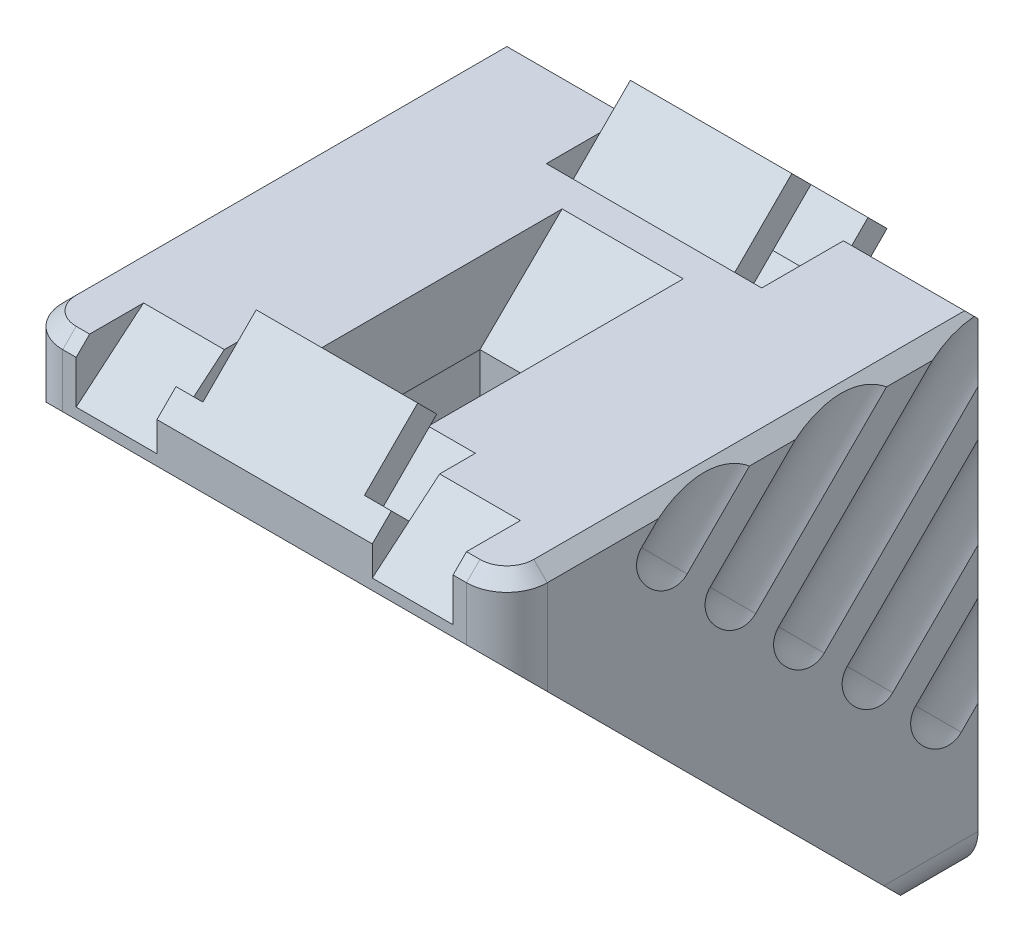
ISO-10303-21;
HEADER;
FILE_DESCRIPTION(('STEP AP214'),'2;1');
FILE_NAME('part.step','',(''),(''),'','','');
FILE_SCHEMA(('AUTOMOTIVE_DESIGN { 1 0 10303 214 1 1 1 1 }'));
ENDSEC;
DATA;
#1=APPLICATION_CONTEXT('core data for automotive mechanical design processes');
#2=APPLICATION_PROTOCOL_DEFINITION('international standard','automotive_design',2000,#1);
#3=PRODUCT_CONTEXT('',#1,'mechanical');
#4=PRODUCT('Part','Part','',(#3));
#5=PRODUCT_RELATED_PRODUCT_CATEGORY('part','',(#4));
#6=PRODUCT_DEFINITION_FORMATION('','',#4);
#7=PRODUCT_DEFINITION_CONTEXT('part definition',#1,'design');
#8=PRODUCT_DEFINITION('design','',#6,#7);
#9=PRODUCT_DEFINITION_SHAPE('','',#8);
#10=(LENGTH_UNIT() NAMED_UNIT(*) SI_UNIT(.MILLI.,.METRE.));
#11=(NAMED_UNIT(*) PLANE_ANGLE_UNIT() SI_UNIT($,.RADIAN.));
#12=(NAMED_UNIT(*) SI_UNIT($,.STERADIAN.) SOLID_ANGLE_UNIT());
#13=UNCERTAINTY_MEASURE_WITH_UNIT(LENGTH_MEASURE(1.E-05),#10,'distance_accuracy_value','');
#14=(GEOMETRIC_REPRESENTATION_CONTEXT(3) GLOBAL_UNCERTAINTY_ASSIGNED_CONTEXT((#13)) GLOBAL_UNIT_ASSIGNED_CONTEXT((#10,
#11,#12)) REPRESENTATION_CONTEXT('',''));
#15=CARTESIAN_POINT('',(0.,0.,0.));
#16=DIRECTION('',(0.,0.,1.));
#17=DIRECTION('',(1.,0.,0.));
#18=AXIS2_PLACEMENT_3D('',#15,#16,#17);
#19=CARTESIAN_POINT('',(-2.99999999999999,-17.29289321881,0.292893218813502));
#20=DIRECTION('',(-1.,0.,0.));
#21=DIRECTION('',(0.,0.,1.));
#22=AXIS2_PLACEMENT_3D('',#19,#20,#21);
#23=PLANE('',#22);
#24=DIRECTION('',(0.,0.707106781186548,0.707106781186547));
#25=VECTOR('',#24,1.);
#26=CARTESIAN_POINT('',(-2.99999999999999,-15.31299423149,-1.687005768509));
#27=LINE('',#26,#25);
#28=CARTESIAN_POINT('',(-2.99999999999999,-15.3129942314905,-1.6870057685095));
#29=VERTEX_POINT('',#28);
#30=CARTESIAN_POINT('',(-2.99999999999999,-14.6058874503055,-0.979898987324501));
#31=VERTEX_POINT('',#30);
#32=EDGE_CURVE('E745',#29,#31,#27,.T.);
#33=ORIENTED_EDGE('',*,*,#32,.F.);
#34=DIRECTION('',(0.,0.707106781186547,-0.707106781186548));
#35=VECTOR('',#34,1.);
#36=CARTESIAN_POINT('',(-2.99999999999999,-17.,0.));
#37=LINE('',#36,#35);
#38=CARTESIAN_POINT('',(-2.99999999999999,-17.2928932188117,0.292893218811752));
#39=VERTEX_POINT('',#38);
#40=EDGE_CURVE('E649',#39,#29,#37,.T.);
#41=ORIENTED_EDGE('',*,*,#40,.F.);
#42=DIRECTION('',(0.,0.707106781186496,0.707106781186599));
#43=VECTOR('',#42,1.);
#44=CARTESIAN_POINT('',(-2.99999999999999,-17.2928932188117,0.292893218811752));
#45=LINE('',#44,#43);
#46=CARTESIAN_POINT('',(-2.99999999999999,-16.5857864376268,0.999999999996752));
#47=VERTEX_POINT('',#46);
#48=EDGE_CURVE('E747',#39,#47,#45,.T.);
#49=ORIENTED_EDGE('',*,*,#48,.T.);
#50=DIRECTION('',(0.,-0.707106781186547,0.707106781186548));
#51=VECTOR('',#50,1.);
#52=CARTESIAN_POINT('',(-2.99999999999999,-16.58578643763,1.));
#53=LINE('',#52,#51);
#54=EDGE_CURVE('E653',#31,#47,#53,.T.);
#55=ORIENTED_EDGE('',*,*,#54,.F.);
#56=EDGE_LOOP('',(#33,#41,#49,#55));
#57=FACE_BOUND('',#56,.T.);
#58=ADVANCED_FACE('F15',(#57),#23,.T.);
#59=CARTESIAN_POINT('',(-3.99999999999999,-15.31299423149,-1.687005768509));
#60=DIRECTION('',(0.,0.707106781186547,-0.707106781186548));
#61=DIRECTION('',(0.,0.707106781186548,0.707106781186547));
#62=AXIS2_PLACEMENT_3D('',#59,#60,#61);
#63=PLANE('',#62);
#64=DIRECTION('',(0.,0.707106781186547,0.707106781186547));
#65=VECTOR('',#64,1.);
#66=CARTESIAN_POINT('',(3.00000000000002,-15.3129942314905,-1.6870057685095));
#67=LINE('',#66,#65);
#68=CARTESIAN_POINT('',(3.00000000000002,-15.3129942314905,-1.6870057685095));
#69=VERTEX_POINT('',#68);
#70=CARTESIAN_POINT('',(3.00000000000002,-14.6058874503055,-0.979898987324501));
#71=VERTEX_POINT('',#70);
#72=EDGE_CURVE('E674',#69,#71,#67,.T.);
#73=ORIENTED_EDGE('',*,*,#72,.F.);
#74=DIRECTION('',(1.,0.,0.));
#75=VECTOR('',#74,1.);
#76=CARTESIAN_POINT('',(-3.99999999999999,-15.3129942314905,-1.6870057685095));
#77=LINE('',#76,#75);
#78=EDGE_CURVE('E647',#29,#69,#77,.T.);
#79=ORIENTED_EDGE('',*,*,#78,.F.);
#80=ORIENTED_EDGE('',*,*,#32,.T.);
#81=DIRECTION('',(1.,0.,0.));
#82=VECTOR('',#81,1.);
#83=CARTESIAN_POINT('',(-2.99999999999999,-14.6058874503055,-0.979898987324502));
#84=LINE('',#83,#82);
#85=EDGE_CURVE('E668',#71,#31,#84,.F.);
#86=ORIENTED_EDGE('',*,*,#85,.F.);
#87=EDGE_LOOP('',(#73,#79,#80,#86));
#88=FACE_BOUND('',#87,.T.);
#89=ADVANCED_FACE('F2170',(#88),#63,.T.);
#90=CARTESIAN_POINT('',(3.00000000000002,-16.58578643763,1.));
#91=DIRECTION('',(1.,0.,0.));
#92=DIRECTION('',(0.,0.,-1.));
#93=AXIS2_PLACEMENT_3D('',#90,#91,#92);
#94=PLANE('',#93);
#95=ORIENTED_EDGE('',*,*,#72,.T.);
#96=DIRECTION('',(0.,-0.707106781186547,0.707106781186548));
#97=VECTOR('',#96,1.);
#98=CARTESIAN_POINT('',(3.00000000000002,-16.58578643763,1.));
#99=LINE('',#98,#97);
#100=CARTESIAN_POINT('',(3.00000000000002,-16.5857864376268,0.999999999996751));
#101=VERTEX_POINT('',#100);
#102=EDGE_CURVE('E671',#101,#71,#99,.F.);
#103=ORIENTED_EDGE('',*,*,#102,.F.);
#104=DIRECTION('',(0.,-0.707106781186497,-0.707106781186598));
#105=VECTOR('',#104,1.);
#106=CARTESIAN_POINT('',(3.00000000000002,-16.5857864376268,0.999999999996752));
#107=LINE('',#106,#105);
#108=CARTESIAN_POINT('',(3.00000000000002,-17.2928932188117,0.292893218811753));
#109=VERTEX_POINT('',#108);
#110=EDGE_CURVE('E743',#101,#109,#107,.T.);
#111=ORIENTED_EDGE('',*,*,#110,.T.);
#112=DIRECTION('',(0.,0.707106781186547,-0.707106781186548));
#113=VECTOR('',#112,1.);
#114=CARTESIAN_POINT('',(3.00000000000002,-17.,0.));
#115=LINE('',#114,#113);
#116=EDGE_CURVE('E636',#69,#109,#115,.F.);
#117=ORIENTED_EDGE('',*,*,#116,.F.);
#118=EDGE_LOOP('',(#95,#103,#111,#117));
#119=FACE_BOUND('',#118,.T.);
#120=ADVANCED_FACE('F2167',(#119),#94,.T.);
#121=CARTESIAN_POINT('',(-2.99999999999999,-16.58578643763,1.));
#122=DIRECTION('',(0.,0.707106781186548,0.707106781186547));
#123=DIRECTION('',(0.,-0.707106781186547,0.707106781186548));
#124=AXIS2_PLACEMENT_3D('',#121,#122,#123);
#125=PLANE('',#124);
#126=ORIENTED_EDGE('',*,*,#85,.T.);
#127=ORIENTED_EDGE('',*,*,#54,.T.);
#128=DIRECTION('',(1.,0.,0.));
#129=VECTOR('',#128,1.);
#130=CARTESIAN_POINT('',(-3.99999999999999,-16.5857864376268,0.999999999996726));
#131=LINE('',#130,#129);
#132=EDGE_CURVE('E681',#47,#101,#131,.T.);
#133=ORIENTED_EDGE('',*,*,#132,.T.);
#134=ORIENTED_EDGE('',*,*,#102,.T.);
#135=EDGE_LOOP('',(#126,#127,#133,#134));
#136=FACE_BOUND('',#135,.T.);
#137=ADVANCED_FACE('F2163',(#136),#125,.T.);
#138=CARTESIAN_POINT('',(-3.99999999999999,-17.,0.));
#139=DIRECTION('',(0.,-0.707106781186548,-0.707106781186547));
#140=DIRECTION('',(0.,0.707106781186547,-0.707106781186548));
#141=AXIS2_PLACEMENT_3D('',#138,#139,#140);
#142=PLANE('',#141);
#143=ORIENTED_EDGE('',*,*,#78,.T.);
#144=ORIENTED_EDGE('',*,*,#116,.T.);
#145=DIRECTION('',(1.,0.,0.));
#146=VECTOR('',#145,1.);
#147=CARTESIAN_POINT('',(-3.99999999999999,-17.2928932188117,0.292893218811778));
#148=LINE('',#147,#146);
#149=CARTESIAN_POINT('',(4.00000000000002,-17.2928932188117,0.292893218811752));
#150=VERTEX_POINT('',#149);
#151=EDGE_CURVE('E711',#109,#150,#148,.T.);
#152=ORIENTED_EDGE('',*,*,#151,.T.);
#153=DIRECTION('',(0.,0.707106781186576,-0.70710678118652));
#154=VECTOR('',#153,1.);
#155=CARTESIAN_POINT('',(4.00000000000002,-18.,1.));
#156=LINE('',#155,#154);
#157=CARTESIAN_POINT('',(4.00000000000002,-18.,1.));
#158=VERTEX_POINT('',#157);
#159=EDGE_CURVE('E656',#158,#150,#156,.T.);
#160=ORIENTED_EDGE('',*,*,#159,.F.);
#161=DIRECTION('',(1.,0.,0.));
#162=VECTOR('',#161,1.);
#163=CARTESIAN_POINT('',(-8.99999999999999,-18.,1.));
#164=LINE('',#163,#162);
#165=CARTESIAN_POINT('',(-3.99999999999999,-18.,1.));
#166=VERTEX_POINT('',#165);
#167=EDGE_CURVE('E639',#166,#158,#164,.T.);
#168=ORIENTED_EDGE('',*,*,#167,.F.);
#169=DIRECTION('',(0.,0.707106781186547,-0.707106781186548));
#170=VECTOR('',#169,1.);
#171=CARTESIAN_POINT('',(-3.99999999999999,-17.,0.));
#172=LINE('',#171,#170);
#173=CARTESIAN_POINT('',(-3.99999999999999,-17.2928932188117,0.292893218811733));
#174=VERTEX_POINT('',#173);
#175=EDGE_CURVE('E651',#166,#174,#172,.T.);
#176=ORIENTED_EDGE('',*,*,#175,.T.);
#177=DIRECTION('',(1.,0.,0.));
#178=VECTOR('',#177,1.);
#179=CARTESIAN_POINT('',(-3.99999999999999,-17.2928932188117,0.292893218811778));
#180=LINE('',#179,#178);
#181=EDGE_CURVE('E701',#174,#39,#180,.T.);
#182=ORIENTED_EDGE('',*,*,#181,.T.);
#183=ORIENTED_EDGE('',*,*,#40,.T.);
#184=EDGE_LOOP('',(#143,#144,#152,#160,#168,#176,#182,#183));
#185=FACE_BOUND('',#184,.T.);
#186=ADVANCED_FACE('F2160',(#185),#142,.T.);
#187=CARTESIAN_POINT('',(7.50000000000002,-16.5,0.50000000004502));
#188=DIRECTION('',(0.,0.,1.));
#189=DIRECTION('',(0.,-1.,0.));
#190=AXIS2_PLACEMENT_3D('',#187,#188,#189);
#191=CONICAL_SURFACE('',#190,1.49999999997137,0.785398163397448);
#192=CARTESIAN_POINT('',(7.50000000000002,-16.5,5.6843418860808E-11));
#193=DIRECTION('',(0.,0.,1.));
#194=DIRECTION('',(0.,-1.,0.));
#195=AXIS2_PLACEMENT_3D('',#192,#193,#194);
#196=CIRCLE('',#195,0.999999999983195);
#197=CARTESIAN_POINT('',(7.50000000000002,-17.4999999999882,2.84217636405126E-11));
#198=VERTEX_POINT('',#197);
#199=CARTESIAN_POINT('',(8.4999999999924,-16.5,4.26330512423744E-11));
#200=VERTEX_POINT('',#199);
#201=EDGE_CURVE('E18',#198,#200,#196,.T.);
#202=ORIENTED_EDGE('',*,*,#201,.T.);
#203=DIRECTION('',(-0.707106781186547,0.,-0.707106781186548));
#204=VECTOR('',#203,1.);
#205=CARTESIAN_POINT('',(499008.5,-16.4999999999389,499000.));
#206=LINE('',#205,#204);
#207=CARTESIAN_POINT('',(8.99999999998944,-16.5,0.500000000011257));
#208=VERTEX_POINT('',#207);
#209=EDGE_CURVE('E606',#200,#208,#206,.F.);
#210=ORIENTED_EDGE('',*,*,#209,.T.);
#211=CARTESIAN_POINT('',(7.50000000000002,-16.5,0.500000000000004));
#212=DIRECTION('',(0.,0.,1.));
#213=DIRECTION('',(0.,-1.,0.));
#214=AXIS2_PLACEMENT_3D('',#211,#212,#213);
#215=CIRCLE('',#214,1.5);
#216=CARTESIAN_POINT('',(7.50000000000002,-17.9999999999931,0.500000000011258));
#217=VERTEX_POINT('',#216);
#218=EDGE_CURVE('E1082',#217,#208,#215,.T.);
#219=ORIENTED_EDGE('',*,*,#218,.F.);
#220=DIRECTION('',(0.,0.707106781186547,-0.707106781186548));
#221=VECTOR('',#220,1.);
#222=CARTESIAN_POINT('',(7.50000000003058,-499017.5,499000.));
#223=LINE('',#222,#221);
#224=EDGE_CURVE('E600',#217,#198,#223,.T.);
#225=ORIENTED_EDGE('',*,*,#224,.T.);
#226=EDGE_LOOP('',(#202,#210,#219,#225));
#227=FACE_BOUND('',#226,.T.);
#228=ADVANCED_FACE('F604',(#227),#191,.T.);
#229=CARTESIAN_POINT('',(-2.99999999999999,-0.292893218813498,17.29289321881));
#230=DIRECTION('',(1.,0.,0.));
#231=DIRECTION('',(0.,0.,-1.));
#232=AXIS2_PLACEMENT_3D('',#229,#230,#231);
#233=PLANE('',#232);
#234=DIRECTION('',(0.,0.707106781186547,-0.707106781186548));
#235=VECTOR('',#234,1.);
#236=CARTESIAN_POINT('',(-2.99999999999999,0.,17.));
#237=LINE('',#236,#235);
#238=CARTESIAN_POINT('',(-2.99999999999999,-0.292893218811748,17.2928932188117));
#239=VERTEX_POINT('',#238);
#240=CARTESIAN_POINT('',(-2.99999999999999,1.6870057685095,15.3129942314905));
#241=VERTEX_POINT('',#240);
#242=EDGE_CURVE('E1809',#239,#241,#237,.T.);
#243=ORIENTED_EDGE('',*,*,#242,.T.);
#244=DIRECTION('',(0.,-0.707106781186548,-0.707106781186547));
#245=VECTOR('',#244,1.);
#246=CARTESIAN_POINT('',(-2.99999999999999,1.687005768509,15.31299423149));
#247=LINE('',#246,#245);
#248=CARTESIAN_POINT('',(-2.99999999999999,0.979898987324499,14.6058874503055));
#249=VERTEX_POINT('',#248);
#250=EDGE_CURVE('E627',#241,#249,#247,.T.);
#251=ORIENTED_EDGE('',*,*,#250,.T.);
#252=DIRECTION('',(0.,-0.707106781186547,0.707106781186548));
#253=VECTOR('',#252,1.);
#254=CARTESIAN_POINT('',(-2.99999999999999,-0.999999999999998,16.58578643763));
#255=LINE('',#254,#253);
#256=CARTESIAN_POINT('',(-2.99999999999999,-0.99999999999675,16.5857864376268));
#257=VERTEX_POINT('',#256);
#258=EDGE_CURVE('E1814',#249,#257,#255,.T.);
#259=ORIENTED_EDGE('',*,*,#258,.T.);
#260=DIRECTION('',(0.,-0.7071067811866,-0.707106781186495));
#261=VECTOR('',#260,1.);
#262=CARTESIAN_POINT('',(-2.99999999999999,-0.292893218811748,17.2928932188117));
#263=LINE('',#262,#261);
#264=EDGE_CURVE('E625',#239,#257,#263,.T.);
#265=ORIENTED_EDGE('',*,*,#264,.F.);
#266=EDGE_LOOP('',(#243,#251,#259,#265));
#267=FACE_BOUND('',#266,.T.);
#268=ADVANCED_FACE('F2142',(#267),#233,.F.);
#269=CARTESIAN_POINT('',(-3.99999999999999,1.687005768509,15.31299423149));
#270=DIRECTION('',(0.,-0.707106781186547,0.707106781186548));
#271=DIRECTION('',(0.,-0.707106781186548,-0.707106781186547));
#272=AXIS2_PLACEMENT_3D('',#269,#270,#271);
#273=PLANE('',#272);
#274=DIRECTION('',(1.,0.,0.));
#275=VECTOR('',#274,1.);
#276=CARTESIAN_POINT('',(-3.99999999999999,1.6870057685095,15.3129942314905));
#277=LINE('',#276,#275);
#278=CARTESIAN_POINT('',(3.00000000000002,1.6870057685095,15.3129942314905));
#279=VERTEX_POINT('',#278);
#280=EDGE_CURVE('E1799',#241,#279,#277,.T.);
#281=ORIENTED_EDGE('',*,*,#280,.T.);
#282=DIRECTION('',(0.,-0.707106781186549,-0.707106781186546));
#283=VECTOR('',#282,1.);
#284=CARTESIAN_POINT('',(3.00000000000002,1.6870057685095,15.3129942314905));
#285=LINE('',#284,#283);
#286=CARTESIAN_POINT('',(3.00000000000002,0.979898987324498,14.6058874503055));
#287=VERTEX_POINT('',#286);
#288=EDGE_CURVE('E1228',#279,#287,#285,.T.);
#289=ORIENTED_EDGE('',*,*,#288,.T.);
#290=DIRECTION('',(1.,0.,0.));
#291=VECTOR('',#290,1.);
#292=CARTESIAN_POINT('',(-2.99999999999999,0.979898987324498,14.6058874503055));
#293=LINE('',#292,#291);
#294=EDGE_CURVE('E1827',#287,#249,#293,.F.);
#295=ORIENTED_EDGE('',*,*,#294,.T.);
#296=ORIENTED_EDGE('',*,*,#250,.F.);
#297=EDGE_LOOP('',(#281,#289,#295,#296));
#298=FACE_BOUND('',#297,.T.);
#299=ADVANCED_FACE('F2138',(#298),#273,.F.);
#300=CARTESIAN_POINT('',(3.00000000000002,-0.999999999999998,16.58578643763));
#301=DIRECTION('',(-1.,0.,0.));
#302=DIRECTION('',(0.,0.,1.));
#303=AXIS2_PLACEMENT_3D('',#300,#301,#302);
#304=PLANE('',#303);
#305=DIRECTION('',(0.,-0.707106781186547,0.707106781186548));
#306=VECTOR('',#305,1.);
#307=CARTESIAN_POINT('',(3.00000000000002,-0.999999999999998,16.58578643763));
#308=LINE('',#307,#306);
#309=CARTESIAN_POINT('',(3.00000000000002,-0.99999999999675,16.5857864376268));
#310=VERTEX_POINT('',#309);
#311=EDGE_CURVE('E1273',#310,#287,#308,.F.);
#312=ORIENTED_EDGE('',*,*,#311,.T.);
#313=ORIENTED_EDGE('',*,*,#288,.F.);
#314=DIRECTION('',(0.,0.707106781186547,-0.707106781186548));
#315=VECTOR('',#314,1.);
#316=CARTESIAN_POINT('',(3.00000000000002,0.,17.));
#317=LINE('',#316,#315);
#318=CARTESIAN_POINT('',(3.00000000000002,-0.292893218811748,17.2928932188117));
#319=VERTEX_POINT('',#318);
#320=EDGE_CURVE('E1796',#279,#319,#317,.F.);
#321=ORIENTED_EDGE('',*,*,#320,.T.);
#322=DIRECTION('',(0.,0.7071067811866,0.707106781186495));
#323=VECTOR('',#322,1.);
#324=CARTESIAN_POINT('',(3.00000000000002,-0.99999999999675,16.5857864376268));
#325=LINE('',#324,#323);
#326=EDGE_CURVE('E1221',#310,#319,#325,.T.);
#327=ORIENTED_EDGE('',*,*,#326,.F.);
#328=EDGE_LOOP('',(#312,#313,#321,#327));
#329=FACE_BOUND('',#328,.T.);
#330=ADVANCED_FACE('F2145',(#329),#304,.F.);
#331=CARTESIAN_POINT('',(7.50000000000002,-0.499999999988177,16.5));
#332=DIRECTION('',(0.,-1.,0.));
#333=DIRECTION('',(0.,0.,-1.));
#334=AXIS2_PLACEMENT_3D('',#331,#332,#333);
#335=CONICAL_SURFACE('',#334,1.50000000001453,0.785398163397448);
#336=CARTESIAN_POINT('',(7.50000000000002,0.,16.5));
#337=DIRECTION('',(0.,-1.,0.));
#338=DIRECTION('',(0.,0.,-1.));
#339=AXIS2_PLACEMENT_3D('',#336,#337,#338);
#340=CIRCLE('',#339,1.00000000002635);
#341=CARTESIAN_POINT('',(8.49999999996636,2.84221603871E-11,16.5));
#342=VERTEX_POINT('',#341);
#343=CARTESIAN_POINT('',(7.50000000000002,-2.84217455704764E-11,17.4999999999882));
#344=VERTEX_POINT('',#343);
#345=EDGE_CURVE('E1220',#342,#344,#340,.T.);
#346=ORIENTED_EDGE('',*,*,#345,.T.);
#347=DIRECTION('',(0.,0.707106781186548,-0.707106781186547));
#348=VECTOR('',#347,1.);
#349=CARTESIAN_POINT('',(7.50000000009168,-498991.5,499009.));
#350=LINE('',#349,#348);
#351=CARTESIAN_POINT('',(7.50000000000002,-0.500000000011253,18.0000000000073));
#352=VERTEX_POINT('',#351);
#353=EDGE_CURVE('E1212',#344,#352,#350,.F.);
#354=ORIENTED_EDGE('',*,*,#353,.T.);
#355=CARTESIAN_POINT('',(7.50000000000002,-0.499999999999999,16.5));
#356=DIRECTION('',(0.,1.,0.));
#357=DIRECTION('',(0.,0.,1.));
#358=AXIS2_PLACEMENT_3D('',#355,#356,#357);
#359=CIRCLE('',#358,1.5);
#360=CARTESIAN_POINT('',(9.00000000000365,-0.499999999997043,16.5));
#361=VERTEX_POINT('',#360);
#362=EDGE_CURVE('E923',#361,#352,#359,.F.);
#363=ORIENTED_EDGE('',*,*,#362,.F.);
#364=DIRECTION('',(-0.707106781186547,0.707106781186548,0.));
#365=VECTOR('',#364,1.);
#366=CARTESIAN_POINT('',(499000.,-498991.500000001,16.5));
#367=LINE('',#366,#365);
#368=EDGE_CURVE('E1218',#361,#342,#367,.T.);
#369=ORIENTED_EDGE('',*,*,#368,.T.);
#370=EDGE_LOOP('',(#346,#354,#363,#369));
#371=FACE_BOUND('',#370,.T.);
#372=ADVANCED_FACE('F1769',(#371),#335,.T.);
#373=CARTESIAN_POINT('',(-7.49999999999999,-0.50000000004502,16.5));
#374=DIRECTION('',(0.,-1.,0.));
#375=DIRECTION('',(0.,0.,-1.));
#376=AXIS2_PLACEMENT_3D('',#373,#374,#375);
#377=CONICAL_SURFACE('',#376,1.49999999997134,0.785398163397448);
#378=CARTESIAN_POINT('',(-7.49999999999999,-5.6843418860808E-11,16.5));
#379=DIRECTION('',(0.,-1.,0.));
#380=DIRECTION('',(0.,0.,-1.));
#381=AXIS2_PLACEMENT_3D('',#378,#379,#380);
#382=CIRCLE('',#381,0.999999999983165);
#383=CARTESIAN_POINT('',(-7.49999999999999,-5.68433646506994E-11,17.4999999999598));
#384=VERTEX_POINT('',#383);
#385=CARTESIAN_POINT('',(-8.49999999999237,-4.26320770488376E-11,16.5));
#386=VERTEX_POINT('',#385);
#387=EDGE_CURVE('E1211',#384,#386,#382,.T.);
#388=ORIENTED_EDGE('',*,*,#387,.T.);
#389=DIRECTION('',(0.707106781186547,0.707106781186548,0.));
#390=VECTOR('',#389,1.);
#391=CARTESIAN_POINT('',(-499008.5,-499000.,16.5000000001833));
#392=LINE('',#391,#390);
#393=CARTESIAN_POINT('',(-8.99999999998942,-0.500000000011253,16.5));
#394=VERTEX_POINT('',#393);
#395=EDGE_CURVE('E1200',#386,#394,#392,.F.);
#396=ORIENTED_EDGE('',*,*,#395,.T.);
#397=CARTESIAN_POINT('',(-7.49999999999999,-0.499999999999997,16.5));
#398=DIRECTION('',(0.,-1.,0.));
#399=DIRECTION('',(0.,0.,-1.));
#400=AXIS2_PLACEMENT_3D('',#397,#398,#399);
#401=CIRCLE('',#400,1.5);
#402=CARTESIAN_POINT('',(-7.49999999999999,-0.500000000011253,17.9999999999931));
#403=VERTEX_POINT('',#402);
#404=EDGE_CURVE('E920',#403,#394,#401,.T.);
#405=ORIENTED_EDGE('',*,*,#404,.F.);
#406=DIRECTION('',(0.,0.707106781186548,-0.707106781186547));
#407=VECTOR('',#406,1.);
#408=CARTESIAN_POINT('',(-7.49999999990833,-499000.,499017.5));
#409=LINE('',#408,#407);
#410=EDGE_CURVE('E1209',#403,#384,#409,.T.);
#411=ORIENTED_EDGE('',*,*,#410,.T.);
#412=EDGE_LOOP('',(#388,#396,#405,#411));
#413=FACE_BOUND('',#412,.T.);
#414=ADVANCED_FACE('F1897',(#413),#377,.T.);
#415=CARTESIAN_POINT('',(-7.49999999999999,-16.5,0.499999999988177));
#416=DIRECTION('',(0.,0.,1.));
#417=DIRECTION('',(0.,-1.,0.));
#418=AXIS2_PLACEMENT_3D('',#415,#416,#417);
#419=CONICAL_SURFACE('',#418,1.50000000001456,0.785398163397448);
#420=CARTESIAN_POINT('',(-7.49999999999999,-16.5,0.));
#421=DIRECTION('',(0.,0.,1.));
#422=DIRECTION('',(0.,-1.,0.));
#423=AXIS2_PLACEMENT_3D('',#420,#421,#422);
#424=CIRCLE('',#423,1.00000000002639);
#425=CARTESIAN_POINT('',(-8.50000000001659,-16.5,0.));
#426=VERTEX_POINT('',#425);
#427=CARTESIAN_POINT('',(-7.49999999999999,-17.5000000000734,2.84217455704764E-11));
#428=VERTEX_POINT('',#427);
#429=EDGE_CURVE('E1199',#426,#428,#424,.T.);
#430=ORIENTED_EDGE('',*,*,#429,.T.);
#431=DIRECTION('',(0.,0.707106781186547,-0.707106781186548));
#432=VECTOR('',#431,1.);
#433=CARTESIAN_POINT('',(-7.49999999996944,-499009.,498991.5));
#434=LINE('',#433,#432);
#435=CARTESIAN_POINT('',(-7.49999999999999,-18.0000000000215,0.499999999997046));
#436=VERTEX_POINT('',#435);
#437=EDGE_CURVE('E1188',#428,#436,#434,.F.);
#438=ORIENTED_EDGE('',*,*,#437,.T.);
#439=CARTESIAN_POINT('',(-7.49999999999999,-16.5,0.500000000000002));
#440=DIRECTION('',(0.,0.,-1.));
#441=DIRECTION('',(0.,1.,0.));
#442=AXIS2_PLACEMENT_3D('',#439,#440,#441);
#443=CIRCLE('',#442,1.5);
#444=CARTESIAN_POINT('',(-9.00000000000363,-16.5,0.499999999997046));
#445=VERTEX_POINT('',#444);
#446=EDGE_CURVE('E904',#445,#436,#443,.F.);
#447=ORIENTED_EDGE('',*,*,#446,.F.);
#448=DIRECTION('',(0.707106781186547,0.,-0.707106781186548));
#449=VECTOR('',#448,1.);
#450=CARTESIAN_POINT('',(-499000.,-16.5,498991.5));
#451=LINE('',#450,#449);
#452=EDGE_CURVE('E1197',#445,#426,#451,.T.);
#453=ORIENTED_EDGE('',*,*,#452,.T.);
#454=EDGE_LOOP('',(#430,#438,#447,#453));
#455=FACE_BOUND('',#454,.T.);
#456=ADVANCED_FACE('F2030',(#455),#419,.T.);
#457=CARTESIAN_POINT('',(-2.99999999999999,-1.767766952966,1.767766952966));
#458=DIRECTION('',(1.,0.,0.));
#459=DIRECTION('',(0.,0.,-1.));
#460=AXIS2_PLACEMENT_3D('',#457,#458,#459);
#461=PLANE('',#460);
#462=DIRECTION('',(0.,-0.707106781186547,0.707106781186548));
#463=VECTOR('',#462,1.);
#464=CARTESIAN_POINT('',(-2.99999999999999,-0.707106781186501,-1.414213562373));
#465=LINE('',#464,#463);
#466=CARTESIAN_POINT('',(-2.99999999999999,-0.70710678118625,-1.41421356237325));
#467=VERTEX_POINT('',#466);
#468=CARTESIAN_POINT('',(-2.99999999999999,-2.82842712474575,0.707106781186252));
#469=VERTEX_POINT('',#468);
#470=EDGE_CURVE('E727',#467,#469,#465,.T.);
#471=ORIENTED_EDGE('',*,*,#470,.F.);
#472=DIRECTION('',(0.,0.707106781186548,0.707106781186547));
#473=VECTOR('',#472,1.);
#474=CARTESIAN_POINT('',(-2.99999999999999,-1.414213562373,-2.12132034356));
#475=LINE('',#474,#473);
#476=CARTESIAN_POINT('',(-2.99999999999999,-1.414213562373,-2.12132034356));
#477=VERTEX_POINT('',#476);
#478=EDGE_CURVE('E1171',#477,#467,#475,.T.);
#479=ORIENTED_EDGE('',*,*,#478,.F.);
#480=DIRECTION('',(0.,0.707106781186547,-0.707106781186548));
#481=VECTOR('',#480,1.);
#482=CARTESIAN_POINT('',(-2.99999999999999,-3.535533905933,0.));
#483=LINE('',#482,#481);
#484=CARTESIAN_POINT('',(-2.99999999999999,-3.53553390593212,-1.24656671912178E-13));
#485=VERTEX_POINT('',#484);
#486=EDGE_CURVE('E1180',#485,#477,#483,.T.);
#487=ORIENTED_EDGE('',*,*,#486,.F.);
#488=DIRECTION('',(0.,-0.707106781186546,-0.707106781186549));
#489=VECTOR('',#488,1.);
#490=CARTESIAN_POINT('',(-2.99999999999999,-2.82842712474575,0.707106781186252));
#491=LINE('',#490,#489);
#492=EDGE_CURVE('E1184',#469,#485,#491,.T.);
#493=ORIENTED_EDGE('',*,*,#492,.F.);
#494=EDGE_LOOP('',(#471,#479,#487,#493));
#495=FACE_BOUND('',#494,.T.);
#496=ADVANCED_FACE('F1731',(#495),#461,.F.);
#497=CARTESIAN_POINT('',(-2.99999999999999,-1.414213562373,-2.12132034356));
#498=DIRECTION('',(0.,0.707106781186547,-0.707106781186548));
#499=DIRECTION('',(0.,0.707106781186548,0.707106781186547));
#500=AXIS2_PLACEMENT_3D('',#497,#498,#499);
#501=PLANE('',#500);
#502=DIRECTION('',(0.,0.707106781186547,0.707106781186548));
#503=VECTOR('',#502,1.);
#504=CARTESIAN_POINT('',(3.00000000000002,-1.414213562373,-2.12132034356));
#505=LINE('',#504,#503);
#506=CARTESIAN_POINT('',(3.00000000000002,-1.414213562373,-2.12132034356));
#507=VERTEX_POINT('',#506);
#508=CARTESIAN_POINT('',(3.00000000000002,-0.70710678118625,-1.41421356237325));
#509=VERTEX_POINT('',#508);
#510=EDGE_CURVE('E1168',#507,#509,#505,.T.);
#511=ORIENTED_EDGE('',*,*,#510,.F.);
#512=DIRECTION('',(1.,0.,0.));
#513=VECTOR('',#512,1.);
#514=CARTESIAN_POINT('',(-2.99999999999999,-1.414213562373,-2.12132034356));
#515=LINE('',#514,#513);
#516=EDGE_CURVE('E1177',#477,#507,#515,.T.);
#517=ORIENTED_EDGE('',*,*,#516,.F.);
#518=ORIENTED_EDGE('',*,*,#478,.T.);
#519=DIRECTION('',(1.,0.,0.));
#520=VECTOR('',#519,1.);
#521=CARTESIAN_POINT('',(-2.99999999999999,-0.707106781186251,-1.41421356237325));
#522=LINE('',#521,#520);
#523=EDGE_CURVE('E721',#509,#467,#522,.F.);
#524=ORIENTED_EDGE('',*,*,#523,.F.);
#525=EDGE_LOOP('',(#511,#517,#518,#524));
#526=FACE_BOUND('',#525,.T.);
#527=ADVANCED_FACE('F1734',(#526),#501,.T.);
#528=CARTESIAN_POINT('',(3.00000000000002,-1.767766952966,1.767766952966));
#529=DIRECTION('',(1.,0.,0.));
#530=DIRECTION('',(0.,0.,-1.));
#531=AXIS2_PLACEMENT_3D('',#528,#529,#530);
#532=PLANE('',#531);
#533=ORIENTED_EDGE('',*,*,#510,.T.);
#534=DIRECTION('',(0.,-0.707106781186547,0.707106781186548));
#535=VECTOR('',#534,1.);
#536=CARTESIAN_POINT('',(3.00000000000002,-0.707106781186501,-1.414213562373));
#537=LINE('',#536,#535);
#538=CARTESIAN_POINT('',(3.00000000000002,-2.82842712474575,0.707106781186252));
#539=VERTEX_POINT('',#538);
#540=EDGE_CURVE('E718',#539,#509,#537,.F.);
#541=ORIENTED_EDGE('',*,*,#540,.F.);
#542=DIRECTION('',(0.,-0.707106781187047,-0.707106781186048));
#543=VECTOR('',#542,1.);
#544=CARTESIAN_POINT('',(3.00000000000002,-2.82842712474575,0.707106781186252));
#545=LINE('',#544,#543);
#546=CARTESIAN_POINT('',(3.00000000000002,-3.53553390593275,0.));
#547=VERTEX_POINT('',#546);
#548=EDGE_CURVE('E1169',#539,#547,#545,.T.);
#549=ORIENTED_EDGE('',*,*,#548,.T.);
#550=DIRECTION('',(0.,0.707106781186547,-0.707106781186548));
#551=VECTOR('',#550,1.);
#552=CARTESIAN_POINT('',(3.00000000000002,-3.535533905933,0.));
#553=LINE('',#552,#551);
#554=EDGE_CURVE('E1179',#507,#547,#553,.F.);
#555=ORIENTED_EDGE('',*,*,#554,.F.);
#556=EDGE_LOOP('',(#533,#541,#549,#555));
#557=FACE_BOUND('',#556,.T.);
#558=ADVANCED_FACE('F1738',(#557),#532,.T.);
#559=CARTESIAN_POINT('',(4.00000000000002,-18.,0.));
#560=DIRECTION('',(1.,0.,0.));
#561=DIRECTION('',(0.,0.,-1.));
#562=AXIS2_PLACEMENT_3D('',#559,#560,#561);
#563=PLANE('',#562);
#564=DIRECTION('',(0.,0.,-1.));
#565=VECTOR('',#564,1.);
#566=CARTESIAN_POINT('',(4.00000000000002,-18.,2.5));
#567=LINE('',#566,#565);
#568=CARTESIAN_POINT('',(4.00000000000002,-18.,2.10000000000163));
#569=VERTEX_POINT('',#568);
#570=EDGE_CURVE('E641',#158,#569,#567,.F.);
#571=ORIENTED_EDGE('',*,*,#570,.F.);
#572=ORIENTED_EDGE('',*,*,#159,.T.);
#573=DIRECTION('',(0.,-0.707106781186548,-0.707106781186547));
#574=VECTOR('',#573,1.);
#575=CARTESIAN_POINT('',(4.00000000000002,-17.29289321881,0.292893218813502));
#576=LINE('',#575,#574);
#577=CARTESIAN_POINT('',(4.00000000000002,-16.6329106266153,0.952875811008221));
#578=VERTEX_POINT('',#577);
#579=EDGE_CURVE('E702',#150,#578,#576,.F.);
#580=ORIENTED_EDGE('',*,*,#579,.T.);
#581=DIRECTION('',(0.,-0.766044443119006,0.642787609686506));
#582=VECTOR('',#581,1.);
#583=CARTESIAN_POINT('',(4.00000000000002,-15.49731745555,0.));
#584=LINE('',#583,#582);
#585=EDGE_CURVE('E1163',#578,#569,#584,.T.);
#586=ORIENTED_EDGE('',*,*,#585,.T.);
#587=EDGE_LOOP('',(#571,#572,#580,#586));
#588=FACE_BOUND('',#587,.T.);
#589=ADVANCED_FACE('F2192',(#588),#563,.T.);
#590=CARTESIAN_POINT('',(2.25000000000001,-14.75,3.));
#591=DIRECTION('',(0.,-1.,0.));
#592=DIRECTION('',(0.,0.,-1.));
#593=AXIS2_PLACEMENT_3D('',#590,#591,#592);
#594=PLANE('',#593);
#595=DIRECTION('',(0.,0.,-1.));
#596=VECTOR('',#595,1.);
#597=CARTESIAN_POINT('',(-2.24999999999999,-14.75,0.));
#598=LINE('',#597,#596);
#599=CARTESIAN_POINT('',(-2.24999999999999,-14.75,3.));
#600=VERTEX_POINT('',#599);
#601=CARTESIAN_POINT('',(-2.24999999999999,-14.75,0.578427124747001));
#602=VERTEX_POINT('',#601);
#603=EDGE_CURVE('E1667',#600,#602,#598,.T.);
#604=ORIENTED_EDGE('',*,*,#603,.F.);
#605=DIRECTION('',(1.,0.,0.));
#606=VECTOR('',#605,1.);
#607=CARTESIAN_POINT('',(7.00000000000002,-14.75,3.));
#608=LINE('',#607,#606);
#609=CARTESIAN_POINT('',(2.25000000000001,-14.75,3.));
#610=VERTEX_POINT('',#609);
#611=EDGE_CURVE('E1274',#600,#610,#608,.T.);
#612=ORIENTED_EDGE('',*,*,#611,.T.);
#613=DIRECTION('',(0.,0.,-1.));
#614=VECTOR('',#613,1.);
#615=CARTESIAN_POINT('',(2.25000000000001,-14.75,0.));
#616=LINE('',#615,#614);
#617=CARTESIAN_POINT('',(2.25000000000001,-14.75,0.578427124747));
#618=VERTEX_POINT('',#617);
#619=EDGE_CURVE('E1681',#610,#618,#616,.T.);
#620=ORIENTED_EDGE('',*,*,#619,.T.);
#621=DIRECTION('',(1.,0.,0.));
#622=VECTOR('',#621,1.);
#623=CARTESIAN_POINT('',(-3.99999999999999,-14.75,0.578427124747));
#624=LINE('',#623,#622);
#625=EDGE_CURVE('E1661',#618,#602,#624,.F.);
#626=ORIENTED_EDGE('',*,*,#625,.T.);
#627=EDGE_LOOP('',(#604,#612,#620,#626));
#628=FACE_BOUND('',#627,.T.);
#629=ADVANCED_FACE('F2214',(#628),#594,.F.);
#630=CARTESIAN_POINT('',(-3.99999999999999,-18.,0.));
#631=DIRECTION('',(-1.,0.,0.));
#632=DIRECTION('',(0.,0.,1.));
#633=AXIS2_PLACEMENT_3D('',#630,#631,#632);
#634=PLANE('',#633);
#635=DIRECTION('',(0.,-0.707106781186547,0.707106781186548));
#636=VECTOR('',#635,1.);
#637=CARTESIAN_POINT('',(-3.99999999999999,-15.87867965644,1.707106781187));
#638=LINE('',#637,#636);
#639=CARTESIAN_POINT('',(-3.99999999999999,-14.171572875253,0.));
#640=VERTEX_POINT('',#639);
#641=CARTESIAN_POINT('',(-3.99999999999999,-15.8786796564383,1.70710678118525));
#642=VERTEX_POINT('',#641);
#643=EDGE_CURVE('E684',#640,#642,#638,.T.);
#644=ORIENTED_EDGE('',*,*,#643,.T.);
#645=DIRECTION('',(0.,-0.707106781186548,-0.707106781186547));
#646=VECTOR('',#645,1.);
#647=CARTESIAN_POINT('',(-3.99999999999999,-17.29289321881,0.292893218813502));
#648=LINE('',#647,#646);
#649=CARTESIAN_POINT('',(-3.99999999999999,-16.6329106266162,0.952875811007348));
#650=VERTEX_POINT('',#649);
#651=EDGE_CURVE('E698',#642,#650,#648,.T.);
#652=ORIENTED_EDGE('',*,*,#651,.T.);
#653=DIRECTION('',(0.,-0.766044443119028,0.64278760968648));
#654=VECTOR('',#653,1.);
#655=CARTESIAN_POINT('',(-3.99999999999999,-15.4973174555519,0.));
#656=LINE('',#655,#654);
#657=CARTESIAN_POINT('',(-3.99999999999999,-15.4973174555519,0.));
#658=VERTEX_POINT('',#657);
#659=EDGE_CURVE('E658',#658,#650,#656,.T.);
#660=ORIENTED_EDGE('',*,*,#659,.F.);
#661=DIRECTION('',(0.,1.,0.));
#662=VECTOR('',#661,1.);
#663=CARTESIAN_POINT('',(-3.99999999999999,-18.,0.));
#664=LINE('',#663,#662);
#665=EDGE_CURVE('E676',#640,#658,#664,.F.);
#666=ORIENTED_EDGE('',*,*,#665,.F.);
#667=EDGE_LOOP('',(#644,#652,#660,#666));
#668=FACE_BOUND('',#667,.T.);
#669=ADVANCED_FACE('F2011',(#668),#634,.F.);
#670=CARTESIAN_POINT('',(-3.99999999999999,-17.29289321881,0.292893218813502));
#671=DIRECTION('',(0.,-0.707106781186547,0.707106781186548));
#672=DIRECTION('',(0.,-0.707106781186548,-0.707106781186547));
#673=AXIS2_PLACEMENT_3D('',#670,#671,#672);
#674=PLANE('',#673);
#675=ORIENTED_EDGE('',*,*,#181,.F.);
#676=DIRECTION('',(0.,-0.707106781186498,-0.707106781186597));
#677=VECTOR('',#676,1.);
#678=CARTESIAN_POINT('',(-3.99999999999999,-16.6329106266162,0.952875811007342));
#679=LINE('',#678,#677);
#680=EDGE_CURVE('E663',#650,#174,#679,.T.);
#681=ORIENTED_EDGE('',*,*,#680,.F.);
#682=ORIENTED_EDGE('',*,*,#651,.F.);
#683=DIRECTION('',(1.,0.,0.));
#684=VECTOR('',#683,1.);
#685=CARTESIAN_POINT('',(-3.99999999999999,-15.8786796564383,1.70710678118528));
#686=LINE('',#685,#684);
#687=CARTESIAN_POINT('',(4.00000000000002,-15.8786796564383,1.70710678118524));
#688=VERTEX_POINT('',#687);
#689=EDGE_CURVE('E687',#642,#688,#686,.T.);
#690=ORIENTED_EDGE('',*,*,#689,.T.);
#691=DIRECTION('',(0.,-0.707106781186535,-0.707106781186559));
#692=VECTOR('',#691,1.);
#693=CARTESIAN_POINT('',(4.00000000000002,-15.8786796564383,1.70710678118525));
#694=LINE('',#693,#692);
#695=EDGE_CURVE('E751',#688,#578,#694,.T.);
#696=ORIENTED_EDGE('',*,*,#695,.T.);
#697=ORIENTED_EDGE('',*,*,#579,.F.);
#698=ORIENTED_EDGE('',*,*,#151,.F.);
#699=ORIENTED_EDGE('',*,*,#110,.F.);
#700=ORIENTED_EDGE('',*,*,#132,.F.);
#701=ORIENTED_EDGE('',*,*,#48,.F.);
#702=EDGE_LOOP('',(#675,#681,#682,#690,#696,#697,#698,#699,#700,#701));
#703=FACE_BOUND('',#702,.T.);
#704=ADVANCED_FACE('F2188',(#703),#674,.F.);
#705=CARTESIAN_POINT('',(4.00000000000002,-18.,0.));
#706=DIRECTION('',(1.,0.,0.));
#707=DIRECTION('',(0.,0.,-1.));
#708=AXIS2_PLACEMENT_3D('',#705,#706,#707);
#709=PLANE('',#708);
#710=DIRECTION('',(0.,-0.766044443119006,0.642787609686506));
#711=VECTOR('',#710,1.);
#712=CARTESIAN_POINT('',(4.00000000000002,-15.49731745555,0.));
#713=LINE('',#712,#711);
#714=CARTESIAN_POINT('',(4.00000000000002,-15.49731745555,0.));
#715=VERTEX_POINT('',#714);
#716=EDGE_CURVE('E1686',#715,#578,#713,.T.);
#717=ORIENTED_EDGE('',*,*,#716,.T.);
#718=ORIENTED_EDGE('',*,*,#695,.F.);
#719=DIRECTION('',(0.,-0.707106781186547,0.707106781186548));
#720=VECTOR('',#719,1.);
#721=CARTESIAN_POINT('',(4.00000000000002,-15.87867965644,1.707106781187));
#722=LINE('',#721,#720);
#723=CARTESIAN_POINT('',(4.00000000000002,-14.171572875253,0.));
#724=VERTEX_POINT('',#723);
#725=EDGE_CURVE('E1133',#688,#724,#722,.F.);
#726=ORIENTED_EDGE('',*,*,#725,.T.);
#727=DIRECTION('',(0.,1.,0.));
#728=VECTOR('',#727,1.);
#729=CARTESIAN_POINT('',(4.00000000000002,-18.,0.));
#730=LINE('',#729,#728);
#731=EDGE_CURVE('E1148',#715,#724,#730,.T.);
#732=ORIENTED_EDGE('',*,*,#731,.F.);
#733=EDGE_LOOP('',(#717,#718,#726,#732));
#734=FACE_BOUND('',#733,.T.);
#735=ADVANCED_FACE('F1988',(#734),#709,.F.);
#736=CARTESIAN_POINT('',(-8.99999999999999,-18.,2.5));
#737=DIRECTION('',(0.,-1.,0.));
#738=DIRECTION('',(0.,0.,-1.));
#739=AXIS2_PLACEMENT_3D('',#736,#737,#738);
#740=PLANE('',#739);
#741=DIRECTION('',(0.,0.,1.));
#742=VECTOR('',#741,1.);
#743=CARTESIAN_POINT('',(7.50000000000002,-18.,10.40764022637));
#744=LINE('',#743,#742);
#745=CARTESIAN_POINT('',(7.50000000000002,-18.,2.50000000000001));
#746=VERTEX_POINT('',#745);
#747=EDGE_CURVE('E1080',#746,#217,#744,.F.);
#748=ORIENTED_EDGE('',*,*,#747,.F.);
#749=DIRECTION('',(1.,0.,0.));
#750=VECTOR('',#749,1.);
#751=CARTESIAN_POINT('',(-8.99999999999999,-18.,2.50000000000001));
#752=LINE('',#751,#750);
#753=CARTESIAN_POINT('',(-7.49999999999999,-18.,2.50000000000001));
#754=VERTEX_POINT('',#753);
#755=EDGE_CURVE('E917',#754,#746,#752,.T.);
#756=ORIENTED_EDGE('',*,*,#755,.F.);
#757=DIRECTION('',(0.,0.,-1.));
#758=VECTOR('',#757,1.);
#759=CARTESIAN_POINT('',(-7.49999999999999,-18.,-0.172344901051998));
#760=LINE('',#759,#758);
#761=EDGE_CURVE('E896',#436,#754,#760,.F.);
#762=ORIENTED_EDGE('',*,*,#761,.F.);
#763=DIRECTION('',(1.,0.,0.));
#764=VECTOR('',#763,1.);
#765=CARTESIAN_POINT('',(-8.99999999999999,-18.,0.500000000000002));
#766=LINE('',#765,#764);
#767=CARTESIAN_POINT('',(-6.99999999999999,-18.,0.500000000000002));
#768=VERTEX_POINT('',#767);
#769=EDGE_CURVE('E1137',#436,#768,#766,.T.);
#770=ORIENTED_EDGE('',*,*,#769,.T.);
#771=DIRECTION('',(0.,0.,-1.));
#772=VECTOR('',#771,1.);
#773=CARTESIAN_POINT('',(-6.99999999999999,-18.,2.5));
#774=LINE('',#773,#772);
#775=CARTESIAN_POINT('',(-6.99999999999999,-18.,2.1));
#776=VERTEX_POINT('',#775);
#777=EDGE_CURVE('E642',#768,#776,#774,.F.);
#778=ORIENTED_EDGE('',*,*,#777,.T.);
#779=DIRECTION('',(1.,0.,0.));
#780=VECTOR('',#779,1.);
#781=CARTESIAN_POINT('',(-3.99999999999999,-18.,2.1));
#782=LINE('',#781,#780);
#783=CARTESIAN_POINT('',(-3.99999999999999,-18.,2.1));
#784=VERTEX_POINT('',#783);
#785=EDGE_CURVE('E1129',#776,#784,#782,.T.);
#786=ORIENTED_EDGE('',*,*,#785,.T.);
#787=DIRECTION('',(0.,0.,1.));
#788=VECTOR('',#787,1.);
#789=CARTESIAN_POINT('',(-3.99999999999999,-18.,0.));
#790=LINE('',#789,#788);
#791=EDGE_CURVE('E707',#166,#784,#790,.T.);
#792=ORIENTED_EDGE('',*,*,#791,.F.);
#793=ORIENTED_EDGE('',*,*,#167,.T.);
#794=ORIENTED_EDGE('',*,*,#570,.T.);
#795=DIRECTION('',(1.,0.,0.));
#796=VECTOR('',#795,1.);
#797=CARTESIAN_POINT('',(4.00000000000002,-18.,2.10000000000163));
#798=LINE('',#797,#796);
#799=CARTESIAN_POINT('',(7.00000000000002,-18.,2.10000000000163));
#800=VERTEX_POINT('',#799);
#801=EDGE_CURVE('E1692',#569,#800,#798,.T.);
#802=ORIENTED_EDGE('',*,*,#801,.T.);
#803=DIRECTION('',(0.,0.,-1.));
#804=VECTOR('',#803,1.);
#805=CARTESIAN_POINT('',(7.00000000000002,-18.,0.));
#806=LINE('',#805,#804);
#807=CARTESIAN_POINT('',(7.00000000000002,-18.,0.500000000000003));
#808=VERTEX_POINT('',#807);
#809=EDGE_CURVE('E1160',#800,#808,#806,.T.);
#810=ORIENTED_EDGE('',*,*,#809,.T.);
#811=DIRECTION('',(1.,0.,0.));
#812=VECTOR('',#811,1.);
#813=CARTESIAN_POINT('',(7.00000000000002,-18.,0.500000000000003));
#814=LINE('',#813,#812);
#815=EDGE_CURVE('E1154',#217,#808,#814,.F.);
#816=ORIENTED_EDGE('',*,*,#815,.F.);
#817=EDGE_LOOP('',(#748,#756,#762,#770,#778,#786,#792,#793,#794,#802,#810,#816));
#818=FACE_BOUND('',#817,.T.);
#819=ADVANCED_FACE('F1919',(#818),#740,.T.);
#820=CARTESIAN_POINT('',(-3.99999999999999,-18.,0.));
#821=DIRECTION('',(-1.,0.,0.));
#822=DIRECTION('',(0.,0.,1.));
#823=AXIS2_PLACEMENT_3D('',#820,#821,#822);
#824=PLANE('',#823);
#825=ORIENTED_EDGE('',*,*,#791,.T.);
#826=DIRECTION('',(0.,-0.766044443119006,0.642787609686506));
#827=VECTOR('',#826,1.);
#828=CARTESIAN_POINT('',(-3.99999999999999,-18.,2.1));
#829=LINE('',#828,#827);
#830=EDGE_CURVE('E1132',#784,#650,#829,.F.);
#831=ORIENTED_EDGE('',*,*,#830,.T.);
#832=ORIENTED_EDGE('',*,*,#680,.T.);
#833=ORIENTED_EDGE('',*,*,#175,.F.);
#834=EDGE_LOOP('',(#825,#831,#832,#833));
#835=FACE_BOUND('',#834,.T.);
#836=ADVANCED_FACE('F2197',(#835),#824,.T.);
#837=CARTESIAN_POINT('',(4.00000000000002,-1.06066017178,1.06066017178));
#838=DIRECTION('',(0.,0.707106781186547,-0.707106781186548));
#839=DIRECTION('',(0.,0.707106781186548,0.707106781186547));
#840=AXIS2_PLACEMENT_3D('',#837,#838,#839);
#841=PLANE('',#840);
#842=DIRECTION('',(0.,0.707106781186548,0.707106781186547));
#843=VECTOR('',#842,1.);
#844=CARTESIAN_POINT('',(-3.99999999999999,-1.06066017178,1.06066017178));
#845=LINE('',#844,#843);
#846=CARTESIAN_POINT('',(-3.99999999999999,-1.41421356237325,0.707106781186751));
#847=VERTEX_POINT('',#846);
#848=CARTESIAN_POINT('',(-3.99999999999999,-0.70710678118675,1.41421356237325));
#849=VERTEX_POINT('',#848);
#850=EDGE_CURVE('E1083',#847,#849,#845,.T.);
#851=ORIENTED_EDGE('',*,*,#850,.T.);
#852=DIRECTION('',(1.,0.,0.));
#853=VECTOR('',#852,1.);
#854=CARTESIAN_POINT('',(4.00000000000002,-0.70710678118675,1.41421356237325));
#855=LINE('',#854,#853);
#856=CARTESIAN_POINT('',(4.00000000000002,-0.70710678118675,1.41421356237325));
#857=VERTEX_POINT('',#856);
#858=EDGE_CURVE('E1112',#849,#857,#855,.T.);
#859=ORIENTED_EDGE('',*,*,#858,.T.);
#860=DIRECTION('',(0.,0.707106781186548,0.707106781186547));
#861=VECTOR('',#860,1.);
#862=CARTESIAN_POINT('',(4.00000000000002,-1.06066017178,1.06066017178));
#863=LINE('',#862,#861);
#864=CARTESIAN_POINT('',(4.00000000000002,-1.41421356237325,0.707106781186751));
#865=VERTEX_POINT('',#864);
#866=EDGE_CURVE('E1119',#857,#865,#863,.F.);
#867=ORIENTED_EDGE('',*,*,#866,.T.);
#868=DIRECTION('',(1.,0.,0.));
#869=VECTOR('',#868,1.);
#870=CARTESIAN_POINT('',(4.00000000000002,-1.41421356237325,0.707106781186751));
#871=LINE('',#870,#869);
#872=EDGE_CURVE('E1191',#847,#865,#871,.T.);
#873=ORIENTED_EDGE('',*,*,#872,.F.);
#874=EDGE_LOOP('',(#851,#859,#867,#873));
#875=FACE_BOUND('',#874,.T.);
#876=ADVANCED_FACE('F2199',(#875),#841,.T.);
#877=CARTESIAN_POINT('',(7.50000000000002,-16.5,10.40764022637));
#878=DIRECTION('',(0.,0.,1.));
#879=DIRECTION('',(0.,-1.,0.));
#880=AXIS2_PLACEMENT_3D('',#877,#878,#879);
#881=CYLINDRICAL_SURFACE('',#880,1.5);
#882=DIRECTION('',(0.,0.,-1.));
#883=VECTOR('',#882,1.);
#884=CARTESIAN_POINT('',(9.00000000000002,-16.5,0.));
#885=LINE('',#884,#883);
#886=CARTESIAN_POINT('',(9.00000000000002,-16.5,4.00000000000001));
#887=VERTEX_POINT('',#886);
#888=EDGE_CURVE('E1073',#887,#208,#885,.T.);
#889=ORIENTED_EDGE('',*,*,#888,.F.);
#890=CARTESIAN_POINT('',(7.50000000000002,-16.5,4.00000000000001));
#891=DIRECTION('',(0.,-0.707106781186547,0.707106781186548));
#892=DIRECTION('',(0.,0.707106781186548,0.707106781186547));
#893=AXIS2_PLACEMENT_3D('',#890,#891,#892);
#894=ELLIPSE('',#893,2.12132034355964,1.5);
#895=EDGE_CURVE('E919',#746,#887,#894,.T.);
#896=ORIENTED_EDGE('',*,*,#895,.F.);
#897=ORIENTED_EDGE('',*,*,#747,.T.);
#898=ORIENTED_EDGE('',*,*,#218,.T.);
#899=EDGE_LOOP('',(#889,#896,#897,#898));
#900=FACE_BOUND('',#899,.T.);
#901=ADVANCED_FACE('F1064',(#900),#881,.T.);
#902=CARTESIAN_POINT('',(11.0799999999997,-12.9995619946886,1.12016807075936));
#903=DIRECTION('',(-1.,2.00497696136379E-13,2.00497696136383E-13));
#904=DIRECTION('',(-2.8333816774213E-13,-0.707106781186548,-0.707106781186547));
#905=AXIS2_PLACEMENT_3D('',#902,#903,#904);
#906=CIRCLE('',#905,1.20000000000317);
#907=TRIMMED_CURVE('',#906,(PARAMETER_VALUE(-3.14159265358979)),
(PARAMETER_VALUE(3.14159265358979)),.T.,.PARAMETER.);
#908=CARTESIAN_POINT('',(11.08,-12.151033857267,1.96869620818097));
#909=DIRECTION('',(0.,0.707106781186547,-0.707106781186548));
#910=AXIS1_PLACEMENT('',#908,#909);
#911=SURFACE_OF_REVOLUTION('',#907,#910);
#912=CARTESIAN_POINT('',(9.00000000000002,-12.9976742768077,1.12205578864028));
#913=CARTESIAN_POINT('',(9.00000000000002,-13.0120354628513,1.13641194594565));
#914=CARTESIAN_POINT('',(9.00000000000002,-13.0256503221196,1.15149435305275));
#915=CARTESIAN_POINT('',(9.00000000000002,-13.0512818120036,1.1829411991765));
#916=CARTESIAN_POINT('',(9.00000000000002,-13.0632997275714,1.1993045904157));
#917=CARTESIAN_POINT('',(9.00000000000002,-13.0966010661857,1.24974626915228));
#918=CARTESIAN_POINT('',(9.00000000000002,-13.1154335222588,1.28548064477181));
#919=CARTESIAN_POINT('',(9.00000000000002,-13.1461366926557,1.35964422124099));
#920=CARTESIAN_POINT('',(9.00000000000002,-13.1580258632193,1.39806597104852));
#921=CARTESIAN_POINT('',(9.00000000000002,-13.1752599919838,1.47640161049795));
#922=CARTESIAN_POINT('',(9.00000000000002,-13.1805899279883,1.51631871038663));
#923=CARTESIAN_POINT('',(9.00000000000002,-13.1859198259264,1.60778523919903));
#924=CARTESIAN_POINT('',(9.00000000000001,-13.1839942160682,1.65944236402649));
#925=CARTESIAN_POINT('',(9.00000000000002,-13.1718626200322,1.76173873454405));
#926=CARTESIAN_POINT('',(9.00000000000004,-13.1616455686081,1.81237652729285));
#927=CARTESIAN_POINT('',(9.00000000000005,-13.1284845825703,1.93345177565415));
#928=CARTESIAN_POINT('',(9.00000000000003,-13.1019331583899,2.00289080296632));
#929=CARTESIAN_POINT('',(9.00000000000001,-13.0383574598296,2.13682595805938));
#930=CARTESIAN_POINT('',(9.00000000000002,-13.001306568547,2.20130898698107));
#931=CARTESIAN_POINT('',(9.00000000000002,-12.9313125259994,2.30659443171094));
#932=CARTESIAN_POINT('',(9.00000000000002,-12.9003874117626,2.34876656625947));
#933=CARTESIAN_POINT('',(9.00000000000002,-12.8350665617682,2.43036495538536));
#934=CARTESIAN_POINT('',(9.00000000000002,-12.8006691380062,2.46978985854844));
#935=CARTESIAN_POINT('',(9.00000000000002,-12.7287782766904,2.54573227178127));
#936=CARTESIAN_POINT('',(9.00000000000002,-12.691283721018,2.58224872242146));
#937=CARTESIAN_POINT('',(9.00000000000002,-12.6134501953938,2.65207191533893));
#938=CARTESIAN_POINT('',(9.00000000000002,-12.5731124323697,2.68538000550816));
#939=CARTESIAN_POINT('',(9.00000000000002,-12.4691537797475,2.76391975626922));
#940=CARTESIAN_POINT('',(9.00000000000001,-12.4038421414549,2.80695483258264));
#941=CARTESIAN_POINT('',(9.00000000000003,-12.267526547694,2.88265659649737));
#942=CARTESIAN_POINT('',(9.00000000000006,-12.1965384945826,2.91535106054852));
#943=CARTESIAN_POINT('',(9.,-12.0730692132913,2.95865572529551));
#944=CARTESIAN_POINT('',(8.99999999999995,-12.0219009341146,2.972983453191));
#945=CARTESIAN_POINT('',(9.00000000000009,-11.9179518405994,2.99367520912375));
#946=CARTESIAN_POINT('',(9.00000000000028,-11.8651733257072,3.00005009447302));
#947=CARTESIAN_POINT('',(9.00000000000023,-11.7705377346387,3.00283175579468));
#948=CARTESIAN_POINT('',(9.00000000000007,-11.7287391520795,3.00106637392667));
#949=CARTESIAN_POINT('',(8.99999999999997,-11.6459291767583,2.99075697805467));
#950=CARTESIAN_POINT('',(9.00000000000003,-11.6049178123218,2.98221272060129));
#951=CARTESIAN_POINT('',(9.00000000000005,-11.5246931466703,2.95766790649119));
#952=CARTESIAN_POINT('',(9.00000000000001,-11.4855024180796,2.94159227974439));
#953=CARTESIAN_POINT('',(9.00000000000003,-11.4111882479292,2.90191100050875));
#954=CARTESIAN_POINT('',(9.00000000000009,-11.3760524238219,2.87832914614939));
#955=CARTESIAN_POINT('',(9.00000000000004,-11.3369885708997,2.84568534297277));
#956=CARTESIAN_POINT('',(9.00000000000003,-11.3302763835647,2.83981553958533));
#957=CARTESIAN_POINT('',(9.00000000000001,-11.3171286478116,2.82778990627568));
#958=CARTESIAN_POINT('',(9.00000000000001,-11.3106927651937,2.82163444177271));
#959=CARTESIAN_POINT('',(9.00000000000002,-11.3043934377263,2.81533662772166));
#960=B_SPLINE_CURVE_WITH_KNOTS('',3,(#912,#913,#914,#915,#916,#917,#918,#919,#920,#921,#922,
#923,#924,#925,#926,#927,#928,#929,#930,#931,#932,#933,#934,#935,#936,#937,#938,#939,#940,#941,
#942,#943,#944,#945,#946,#947,#948,#949,#950,#951,#952,#953,#954,#955,#956,#957,#958,#959),
.UNSPECIFIED.,.F.,.F.,(4,2,2,2,2,2,2,2,2,2,2,2,2,2,2,2,2,2,2,2,2,2,2,4),(0.,0.0608652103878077,
0.121681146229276,0.242050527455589,0.362098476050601,0.482420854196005,0.636654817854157,
0.791094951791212,1.01290292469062,1.23527830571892,1.39198451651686,1.54876727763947,
1.70560688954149,1.86238032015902,2.09628846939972,2.329562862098,2.48848538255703,
2.64719070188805,2.77222611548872,2.89726601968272,3.02357969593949,3.14949682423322,
3.17624232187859,3.20295450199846),.UNSPECIFIED.);
#961=CARTESIAN_POINT('',(9.00000000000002,-12.9976742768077,1.12205578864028));
#962=VERTEX_POINT('',#961);
#963=CARTESIAN_POINT('',(9.00000000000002,-11.3043934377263,2.81533662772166));
#964=VERTEX_POINT('',#963);
#965=EDGE_CURVE('E1047',#962,#964,#960,.T.);
#966=ORIENTED_EDGE('',*,*,#965,.F.);
#967=CARTESIAN_POINT('',(11.08,-12.151033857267,1.96869620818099));
#968=DIRECTION('',(0.,0.707106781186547,-0.707106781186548));
#969=DIRECTION('',(0.,0.707106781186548,0.707106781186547));
#970=AXIS2_PLACEMENT_3D('',#967,#968,#969);
#971=CIRCLE('',#970,2.4);
#972=EDGE_CURVE('E1087',#962,#964,#971,.T.);
#973=ORIENTED_EDGE('',*,*,#972,.T.);
#974=EDGE_LOOP('',(#966,#973));
#975=FACE_BOUND('',#974,.T.);
#976=ADVANCED_FACE('F1057',(#975),#911,.T.);
#977=CARTESIAN_POINT('',(11.08,-9.015611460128,-1.166726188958));
#978=DIRECTION('',(0.,0.707106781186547,-0.707106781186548));
#979=DIRECTION('',(0.,0.707106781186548,0.707106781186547));
#980=AXIS2_PLACEMENT_3D('',#977,#978,#979);
#981=CYLINDRICAL_SURFACE('',#980,2.4);
#982=CARTESIAN_POINT('',(11.08,-12.762337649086,2.57999999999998));
#983=DIRECTION('',(-0.707106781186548,0.,0.707106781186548));
#984=DIRECTION('',(-0.408248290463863,0.816496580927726,-0.408248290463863));
#985=AXIS2_PLACEMENT_3D('',#982,#983,#984);
#986=ELLIPSE('',#985,4.8,2.4);
#987=CARTESIAN_POINT('',(9.00000000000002,-12.3756184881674,0.500000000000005));
#988=VERTEX_POINT('',#987);
#989=CARTESIAN_POINT('',(9.00000000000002,-8.98905681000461,0.500000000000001));
#990=VERTEX_POINT('',#989);
#991=EDGE_CURVE('E1157',#988,#990,#986,.F.);
#992=ORIENTED_EDGE('',*,*,#991,.T.);
#993=DIRECTION('',(0.,0.707106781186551,-0.707106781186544));
#994=VECTOR('',#993,1.);
#995=CARTESIAN_POINT('',(9.00000000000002,-11.3043934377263,2.81533662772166));
#996=LINE('',#995,#994);
#997=EDGE_CURVE('E1054',#964,#990,#996,.T.);
#998=ORIENTED_EDGE('',*,*,#997,.F.);
#999=ORIENTED_EDGE('',*,*,#972,.F.);
#1000=DIRECTION('',(0.,0.707106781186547,-0.707106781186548));
#1001=VECTOR('',#1000,1.);
#1002=CARTESIAN_POINT('',(9.00000000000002,-9.8622518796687,-2.0133666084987));
#1003=LINE('',#1002,#1001);
#1004=EDGE_CURVE('E659',#988,#962,#1003,.F.);
#1005=ORIENTED_EDGE('',*,*,#1004,.F.);
#1006=EDGE_LOOP('',(#992,#998,#999,#1005));
#1007=FACE_BOUND('',#1006,.T.);
#1008=ADVANCED_FACE('F1063',(#1007),#981,.F.);
#1009=CARTESIAN_POINT('',(11.08,-10.45397758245,3.66575248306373));
#1010=DIRECTION('',(-1.,0.,0.));
#1011=DIRECTION('',(0.,-0.707106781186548,-0.707106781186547));
#1012=AXIS2_PLACEMENT_3D('',#1009,#1010,#1011);
#1013=CIRCLE('',#1012,1.20000000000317);
#1014=TRIMMED_CURVE('',#1013,(PARAMETER_VALUE(-3.14159265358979)),
(PARAMETER_VALUE(3.14159265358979)),.T.,.PARAMETER.);
#1015=CARTESIAN_POINT('',(11.08,-9.60544944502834,4.51428062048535));
#1016=DIRECTION('',(0.,0.707106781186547,-0.707106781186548));
#1017=AXIS1_PLACEMENT('',#1015,#1016);
#1018=SURFACE_OF_REVOLUTION('',#1014,#1017);
#1019=CARTESIAN_POINT('',(9.00000000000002,-10.452089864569,3.66764020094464));
#1020=CARTESIAN_POINT('',(9.00000000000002,-10.466450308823,3.6819956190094));
#1021=CARTESIAN_POINT('',(9.00000000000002,-10.4800645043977,3.69707720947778));
#1022=CARTESIAN_POINT('',(9.00000000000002,-10.5056948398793,3.72852230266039));
#1023=CARTESIAN_POINT('',(9.00000000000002,-10.5177122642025,3.74488475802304));
#1024=CARTESIAN_POINT('',(9.00000000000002,-10.5510146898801,3.7953269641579));
#1025=CARTESIAN_POINT('',(9.00000000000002,-10.5698483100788,3.83106312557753));
#1026=CARTESIAN_POINT('',(9.00000000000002,-10.6005532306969,3.905230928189));
#1027=CARTESIAN_POINT('',(9.00000000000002,-10.6124429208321,3.94365514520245));
#1028=CARTESIAN_POINT('',(9.00000000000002,-10.629676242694,4.02199096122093));
#1029=CARTESIAN_POINT('',(9.00000000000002,-10.6350056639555,4.06190559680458));
#1030=CARTESIAN_POINT('',(9.00000000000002,-10.6403347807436,4.15335887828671));
#1031=CARTESIAN_POINT('',(9.00000000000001,-10.6384105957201,4.20500513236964));
#1032=CARTESIAN_POINT('',(9.00000000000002,-10.6262825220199,4.30730178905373));
#1033=CARTESIAN_POINT('',(9.00000000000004,-10.6160640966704,4.35795028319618));
#1034=CARTESIAN_POINT('',(9.00000000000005,-10.5828833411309,4.47909752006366));
#1035=CARTESIAN_POINT('',(9.00000000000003,-10.5563028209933,4.54859528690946));
#1036=CARTESIAN_POINT('',(9.00000000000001,-10.4927100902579,4.68251954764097));
#1037=CARTESIAN_POINT('',(9.00000000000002,-10.4556890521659,4.74694169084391));
#1038=CARTESIAN_POINT('',(9.00000000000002,-10.3808595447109,4.8595034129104));
#1039=CARTESIAN_POINT('',(9.00000000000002,-10.3443373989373,4.90851273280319));
#1040=CARTESIAN_POINT('',(9.00000000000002,-10.2666698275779,5.00275483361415));
#1041=CARTESIAN_POINT('',(9.00000000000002,-10.2255222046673,5.04798580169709));
#1042=CARTESIAN_POINT('',(9.00000000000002,-10.1462565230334,5.12724867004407));
#1043=CARTESIAN_POINT('',(9.00000000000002,-10.1087534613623,5.16189889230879));
#1044=CARTESIAN_POINT('',(9.00000000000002,-10.0310652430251,5.22805382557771));
#1045=CARTESIAN_POINT('',(9.00000000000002,-9.99088036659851,5.25955886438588));
#1046=CARTESIAN_POINT('',(9.00000000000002,-9.90796305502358,5.31894909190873));
#1047=CARTESIAN_POINT('',(9.00000000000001,-9.86523304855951,5.34683765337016));
#1048=CARTESIAN_POINT('',(9.00000000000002,-9.77730628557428,5.3983631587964));
#1049=CARTESIAN_POINT('',(9.00000000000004,-9.73211140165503,5.4220032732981));
#1050=CARTESIAN_POINT('',(9.,-9.63457784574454,5.46636266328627));
#1051=CARTESIAN_POINT('',(8.99999999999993,-9.58198312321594,5.48652926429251));
#1052=CARTESIAN_POINT('',(9.00000000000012,-9.47444365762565,5.51908360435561));
#1053=CARTESIAN_POINT('',(9.00000000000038,-9.41950284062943,5.53148383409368));
#1054=CARTESIAN_POINT('',(9.00000000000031,-9.31890359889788,5.54519773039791));
#1055=CARTESIAN_POINT('',(9.00000000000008,-9.27347844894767,5.54817759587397));
#1056=CARTESIAN_POINT('',(8.99999999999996,-9.18271381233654,5.54674213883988));
#1057=CARTESIAN_POINT('',(9.00000000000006,-9.13737428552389,5.54233431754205));
#1058=CARTESIAN_POINT('',(9.00000000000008,-9.05649198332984,5.52678621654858));
#1059=CARTESIAN_POINT('',(9.00000000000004,-9.02068356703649,5.51703629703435));
#1060=CARTESIAN_POINT('',(9.00000000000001,-8.95120228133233,5.49172927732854));
#1061=CARTESIAN_POINT('',(9.00000000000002,-8.91752575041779,5.47618246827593));
#1062=CARTESIAN_POINT('',(9.00000000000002,-8.86241788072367,5.44450452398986));
#1063=CARTESIAN_POINT('',(9.00000000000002,-8.84019052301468,5.42974514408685));
#1064=CARTESIAN_POINT('',(9.00000000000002,-8.79781759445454,5.39740358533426));
#1065=CARTESIAN_POINT('',(9.00000000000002,-8.77767682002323,5.37981513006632));
#1066=CARTESIAN_POINT('',(9.00000000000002,-8.75880902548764,5.36092104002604));
#1067=B_SPLINE_CURVE_WITH_KNOTS('',3,(#1019,#1020,#1021,#1022,#1023,#1024,#1025,#1026,#1027,
#1028,#1029,#1030,#1031,#1032,#1033,#1034,#1035,#1036,#1037,#1038,#1039,#1040,#1041,#1042,#1043,
#1044,#1045,#1046,#1047,#1048,#1049,#1050,#1051,#1052,#1053,#1054,#1055,#1056,#1057,#1058,#1059,
#1060,#1061,#1062,#1063,#1064,#1065,#1066),.UNSPECIFIED.,.F.,.F.,(4,2,2,2,2,2,2,2,2,2,2,2,2,2,2,
2,2,2,2,2,2,2,2,4),(0.,0.0608620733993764,0.121674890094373,0.242050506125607,0.362105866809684,
0.482420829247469,0.636622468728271,0.791094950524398,1.01309241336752,1.23527814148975,
1.41834355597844,1.60149630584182,1.75452225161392,1.9075322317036,2.0603984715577,
2.21315015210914,2.38165544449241,2.54988902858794,2.68596248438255,2.82189785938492,
2.93278278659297,3.04347179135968,3.12329591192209,3.20329963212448),.UNSPECIFIED.);
#1068=CARTESIAN_POINT('',(9.00000000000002,-10.452089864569,3.66764020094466));
#1069=VERTEX_POINT('',#1068);
#1070=CARTESIAN_POINT('',(9.00000000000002,-8.75880902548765,5.36092104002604));
#1071=VERTEX_POINT('',#1070);
#1072=EDGE_CURVE('E1022',#1069,#1071,#1067,.T.);
#1073=ORIENTED_EDGE('',*,*,#1072,.F.);
#1074=CARTESIAN_POINT('',(11.08,-9.60544944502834,4.51428062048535));
#1075=DIRECTION('',(0.,0.707106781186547,-0.707106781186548));
#1076=DIRECTION('',(0.,0.707106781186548,0.707106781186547));
#1077=AXIS2_PLACEMENT_3D('',#1074,#1075,#1076);
#1078=CIRCLE('',#1077,2.4);
#1079=EDGE_CURVE('E1286',#1069,#1071,#1078,.T.);
#1080=ORIENTED_EDGE('',*,*,#1079,.T.);
#1081=EDGE_LOOP('',(#1073,#1080));
#1082=FACE_BOUND('',#1081,.T.);
#1083=ADVANCED_FACE('F1301',(#1082),#1018,.T.);
#1084=CARTESIAN_POINT('',(11.08,-3.500178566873,-1.59099025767));
#1085=DIRECTION('',(0.,0.707106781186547,-0.707106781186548));
#1086=DIRECTION('',(0.,0.707106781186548,0.707106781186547));
#1087=AXIS2_PLACEMENT_3D('',#1084,#1085,#1086);
#1088=CYLINDRICAL_SURFACE('',#1087,2.4);
#1089=CARTESIAN_POINT('',(11.08,-7.67116882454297,2.57999999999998));
#1090=DIRECTION('',(-0.707106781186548,0.,0.707106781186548));
#1091=DIRECTION('',(-0.408248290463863,0.816496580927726,-0.408248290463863));
#1092=AXIS2_PLACEMENT_3D('',#1089,#1090,#1091);
#1093=ELLIPSE('',#1092,4.8,2.4);
#1094=CARTESIAN_POINT('',(9.00000000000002,-7.28444966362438,0.500000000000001));
#1095=VERTEX_POINT('',#1094);
#1096=CARTESIAN_POINT('',(9.00000000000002,-3.89788798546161,0.500000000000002));
#1097=VERTEX_POINT('',#1096);
#1098=EDGE_CURVE('E1716',#1095,#1097,#1093,.F.);
#1099=ORIENTED_EDGE('',*,*,#1098,.T.);
#1100=DIRECTION('',(0.,0.707106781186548,-0.707106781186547));
#1101=VECTOR('',#1100,1.);
#1102=CARTESIAN_POINT('',(9.00000000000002,-8.75880902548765,5.36092104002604));
#1103=LINE('',#1102,#1101);
#1104=EDGE_CURVE('E1541',#1071,#1097,#1103,.T.);
#1105=ORIENTED_EDGE('',*,*,#1104,.F.);
#1106=ORIENTED_EDGE('',*,*,#1079,.F.);
#1107=DIRECTION('',(0.,-0.707106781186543,0.707106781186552));
#1108=VECTOR('',#1107,1.);
#1109=CARTESIAN_POINT('',(9.00000000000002,-7.28444966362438,0.500000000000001));
#1110=LINE('',#1109,#1108);
#1111=EDGE_CURVE('E1543',#1095,#1069,#1110,.T.);
#1112=ORIENTED_EDGE('',*,*,#1111,.F.);
#1113=EDGE_LOOP('',(#1099,#1105,#1106,#1112));
#1114=FACE_BOUND('',#1113,.T.);
#1115=ADVANCED_FACE('F1003',(#1114),#1088,.F.);
#1116=CARTESIAN_POINT('',(11.0799999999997,-6.21133689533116,7.90839317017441));
#1117=DIRECTION('',(-1.,-1.73542119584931E-13,-1.73542119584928E-13));
#1118=DIRECTION('',(-2.45752492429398E-13,0.707106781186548,0.707106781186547));
#1119=AXIS2_PLACEMENT_3D('',#1116,#1117,#1118);
#1120=CIRCLE('',#1119,1.20000000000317);
#1121=TRIMMED_CURVE('',#1120,(PARAMETER_VALUE(-3.14159265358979)),
(PARAMETER_VALUE(3.14159265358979)),.T.,.PARAMETER.);
#1122=CARTESIAN_POINT('',(11.08,-7.05986503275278,7.05986503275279));
#1123=DIRECTION('',(0.,-0.707106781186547,0.707106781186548));
#1124=AXIS1_PLACEMENT('',#1122,#1123);
#1125=SURFACE_OF_REVOLUTION('',#1121,#1124);
#1126=CARTESIAN_POINT('',(9.00000000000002,-7.90650545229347,6.2132246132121));
#1127=CARTESIAN_POINT('',(9.00000000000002,-7.92086663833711,6.22758077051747));
#1128=CARTESIAN_POINT('',(9.00000000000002,-7.93448149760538,6.24266317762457));
#1129=CARTESIAN_POINT('',(9.00000000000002,-7.96011298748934,6.27411002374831));
#1130=CARTESIAN_POINT('',(9.00000000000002,-7.97213090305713,6.29047341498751));
#1131=CARTESIAN_POINT('',(9.00000000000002,-8.00543224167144,6.34091509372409));
#1132=CARTESIAN_POINT('',(9.00000000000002,-8.02426469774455,6.37664946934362));
#1133=CARTESIAN_POINT('',(9.00000000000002,-8.05496786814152,6.45081304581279));
#1134=CARTESIAN_POINT('',(9.00000000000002,-8.06685703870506,6.48923479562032));
#1135=CARTESIAN_POINT('',(9.00000000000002,-8.0840911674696,6.56757043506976));
#1136=CARTESIAN_POINT('',(9.00000000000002,-8.08942110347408,6.60748753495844));
#1137=CARTESIAN_POINT('',(9.00000000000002,-8.09475100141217,6.69895406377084));
#1138=CARTESIAN_POINT('',(9.00000000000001,-8.09282539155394,6.7506111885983));
#1139=CARTESIAN_POINT('',(9.00000000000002,-8.08069379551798,6.85290755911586));
#1140=CARTESIAN_POINT('',(9.00000000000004,-8.07047674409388,6.90354535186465));
#1141=CARTESIAN_POINT('',(9.00000000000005,-8.03731575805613,7.02462060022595));
#1142=CARTESIAN_POINT('',(9.00000000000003,-8.01076433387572,7.09405962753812));
#1143=CARTESIAN_POINT('',(9.00000000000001,-7.94718863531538,7.22799478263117));
#1144=CARTESIAN_POINT('',(9.00000000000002,-7.91013774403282,7.29247781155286));
#1145=CARTESIAN_POINT('',(9.00000000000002,-7.8401437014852,7.39776325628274));
#1146=CARTESIAN_POINT('',(9.00000000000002,-7.80921858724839,7.43993539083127));
#1147=CARTESIAN_POINT('',(9.00000000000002,-7.743897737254,7.52153377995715));
#1148=CARTESIAN_POINT('',(9.00000000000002,-7.70950031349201,7.56095868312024));
#1149=CARTESIAN_POINT('',(9.00000000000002,-7.63760945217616,7.63690109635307));
#1150=CARTESIAN_POINT('',(9.00000000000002,-7.60011489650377,7.67341754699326));
#1151=CARTESIAN_POINT('',(9.00000000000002,-7.52228137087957,7.74324073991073));
#1152=CARTESIAN_POINT('',(9.00000000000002,-7.48194360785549,7.77654883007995));
#1153=CARTESIAN_POINT('',(9.00000000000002,-7.3779849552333,7.85508858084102));
#1154=CARTESIAN_POINT('',(9.00000000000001,-7.3126733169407,7.89812365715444));
#1155=CARTESIAN_POINT('',(9.00000000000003,-7.17635772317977,7.97382542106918));
#1156=CARTESIAN_POINT('',(9.00000000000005,-7.10536967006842,8.00651988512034));
#1157=CARTESIAN_POINT('',(9.,-6.98190038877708,8.04982454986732));
#1158=CARTESIAN_POINT('',(8.99999999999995,-6.93073210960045,8.06415227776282));
#1159=CARTESIAN_POINT('',(9.00000000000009,-6.82678301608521,8.08484403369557));
#1160=CARTESIAN_POINT('',(9.00000000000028,-6.77400450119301,8.09121891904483));
#1161=CARTESIAN_POINT('',(9.00000000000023,-6.6793689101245,8.0940005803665));
#1162=CARTESIAN_POINT('',(9.00000000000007,-6.63757032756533,8.09223519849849));
#1163=CARTESIAN_POINT('',(8.99999999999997,-6.55476035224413,8.08192580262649));
#1164=CARTESIAN_POINT('',(9.00000000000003,-6.51374898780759,8.07338154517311));
#1165=CARTESIAN_POINT('',(9.00000000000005,-6.43352432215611,8.04883673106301));
#1166=CARTESIAN_POINT('',(9.00000000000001,-6.39433359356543,8.03276110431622));
#1167=CARTESIAN_POINT('',(9.00000000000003,-6.32001942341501,7.99307982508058));
#1168=CARTESIAN_POINT('',(9.0000000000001,-6.28488359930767,7.96949797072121));
#1169=CARTESIAN_POINT('',(9.00000000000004,-6.24581974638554,7.9368541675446));
#1170=CARTESIAN_POINT('',(9.00000000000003,-6.23910755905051,7.93098436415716));
#1171=CARTESIAN_POINT('',(9.00000000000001,-6.22595982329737,7.9189587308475));
#1172=CARTESIAN_POINT('',(9.00000000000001,-6.21952394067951,7.91280326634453));
#1173=CARTESIAN_POINT('',(9.00000000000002,-6.21322461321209,7.90650545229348));
#1174=B_SPLINE_CURVE_WITH_KNOTS('',3,(#1126,#1127,#1128,#1129,#1130,#1131,#1132,#1133,#1134,
#1135,#1136,#1137,#1138,#1139,#1140,#1141,#1142,#1143,#1144,#1145,#1146,#1147,#1148,#1149,#1150,
#1151,#1152,#1153,#1154,#1155,#1156,#1157,#1158,#1159,#1160,#1161,#1162,#1163,#1164,#1165,#1166,
#1167,#1168,#1169,#1170,#1171,#1172,#1173),.UNSPECIFIED.,.F.,.F.,(4,2,2,2,2,2,2,2,2,2,2,2,2,2,2,
2,2,2,2,2,2,2,2,4),(0.,0.0608652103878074,0.121681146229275,0.242050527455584,0.362098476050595,
0.482420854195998,0.636654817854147,0.791094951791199,1.0129029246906,1.2352783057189,
1.39198451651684,1.54876727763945,1.70560688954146,1.86238032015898,2.0962884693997,
2.32956286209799,2.48848538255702,2.64719070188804,2.77222611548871,2.89726601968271,
3.02357969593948,3.14949682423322,3.17624232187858,3.20295450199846),.UNSPECIFIED.);
#1175=CARTESIAN_POINT('',(9.00000000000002,-7.90650545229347,6.2132246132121));
#1176=VERTEX_POINT('',#1175);
#1177=CARTESIAN_POINT('',(9.00000000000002,-6.21322461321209,7.90650545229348));
#1178=VERTEX_POINT('',#1177);
#1179=EDGE_CURVE('E1007',#1176,#1178,#1174,.T.);
#1180=ORIENTED_EDGE('',*,*,#1179,.F.);
#1181=CARTESIAN_POINT('',(11.08,-7.05986503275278,7.05986503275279));
#1182=DIRECTION('',(0.,-0.707106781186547,0.707106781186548));
#1183=DIRECTION('',(0.,-0.707106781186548,-0.707106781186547));
#1184=AXIS2_PLACEMENT_3D('',#1181,#1182,#1183);
#1185=CIRCLE('',#1184,2.4);
#1186=EDGE_CURVE('E986',#1176,#1178,#1185,.F.);
#1187=ORIENTED_EDGE('',*,*,#1186,.T.);
#1188=EDGE_LOOP('',(#1180,#1187));
#1189=FACE_BOUND('',#1188,.T.);
#1190=ADVANCED_FACE('F999',(#1189),#1125,.T.);
#1191=CARTESIAN_POINT('',(11.08,-3.66575248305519,10.4539775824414));
#1192=DIRECTION('',(-1.,0.,0.));
#1193=DIRECTION('',(0.,0.707106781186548,0.707106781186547));
#1194=AXIS2_PLACEMENT_3D('',#1191,#1192,#1193);
#1195=CIRCLE('',#1194,1.20000000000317);
#1196=TRIMMED_CURVE('',#1195,(PARAMETER_VALUE(-3.14159265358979)),
(PARAMETER_VALUE(3.14159265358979)),.T.,.PARAMETER.);
#1197=CARTESIAN_POINT('',(11.08,-4.51428062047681,9.60544944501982));
#1198=DIRECTION('',(0.,-0.707106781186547,0.707106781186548));
#1199=AXIS1_PLACEMENT('',#1197,#1198);
#1200=SURFACE_OF_REVOLUTION('',#1196,#1199);
#1201=CARTESIAN_POINT('',(9.00000000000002,-5.36092104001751,8.75880902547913));
#1202=CARTESIAN_POINT('',(9.00000000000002,-5.37528222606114,8.7731651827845));
#1203=CARTESIAN_POINT('',(9.00000000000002,-5.38889708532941,8.7882475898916));
#1204=CARTESIAN_POINT('',(9.00000000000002,-5.41452857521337,8.81969443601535));
#1205=CARTESIAN_POINT('',(9.00000000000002,-5.42654649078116,8.83605782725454));
#1206=CARTESIAN_POINT('',(9.00000000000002,-5.45984782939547,8.88649950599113));
#1207=CARTESIAN_POINT('',(9.00000000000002,-5.47868028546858,8.92223388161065));
#1208=CARTESIAN_POINT('',(9.00000000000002,-5.50938345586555,8.99639745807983));
#1209=CARTESIAN_POINT('',(9.00000000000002,-5.52127262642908,9.03481920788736));
#1210=CARTESIAN_POINT('',(9.00000000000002,-5.53850675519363,9.1131548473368));
#1211=CARTESIAN_POINT('',(9.00000000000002,-5.54383669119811,9.15307194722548));
#1212=CARTESIAN_POINT('',(9.00000000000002,-5.5491665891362,9.24453847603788));
#1213=CARTESIAN_POINT('',(9.00000000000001,-5.54724097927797,9.29619560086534));
#1214=CARTESIAN_POINT('',(9.00000000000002,-5.535109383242,9.39849197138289));
#1215=CARTESIAN_POINT('',(9.00000000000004,-5.52489233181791,9.44912976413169));
#1216=CARTESIAN_POINT('',(9.00000000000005,-5.49173134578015,9.57020501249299));
#1217=CARTESIAN_POINT('',(9.00000000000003,-5.46517992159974,9.63964403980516));
#1218=CARTESIAN_POINT('',(9.00000000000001,-5.4016042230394,9.77357919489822));
#1219=CARTESIAN_POINT('',(9.00000000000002,-5.36455333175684,9.83806222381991));
#1220=CARTESIAN_POINT('',(9.00000000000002,-5.29455928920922,9.94334766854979));
#1221=CARTESIAN_POINT('',(9.00000000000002,-5.26363417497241,9.98551980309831));
#1222=CARTESIAN_POINT('',(9.00000000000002,-5.19831332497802,10.0671181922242));
#1223=CARTESIAN_POINT('',(9.00000000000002,-5.16391590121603,10.1065430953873));
#1224=CARTESIAN_POINT('',(9.00000000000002,-5.09202503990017,10.1824855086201));
#1225=CARTESIAN_POINT('',(9.00000000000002,-5.05453048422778,10.2190019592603));
#1226=CARTESIAN_POINT('',(9.00000000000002,-4.97669695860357,10.2888251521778));
#1227=CARTESIAN_POINT('',(9.00000000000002,-4.93635919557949,10.322133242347));
#1228=CARTESIAN_POINT('',(9.00000000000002,-4.83240054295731,10.4006729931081));
#1229=CARTESIAN_POINT('',(9.00000000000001,-4.76708890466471,10.4437080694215));
#1230=CARTESIAN_POINT('',(9.00000000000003,-4.63077331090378,10.5194098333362));
#1231=CARTESIAN_POINT('',(9.00000000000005,-4.55978525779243,10.5521042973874));
#1232=CARTESIAN_POINT('',(9.,-4.43631597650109,10.5954089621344));
#1233=CARTESIAN_POINT('',(8.99999999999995,-4.38514769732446,10.6097366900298));
#1234=CARTESIAN_POINT('',(9.00000000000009,-4.28119860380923,10.6304284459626));
#1235=CARTESIAN_POINT('',(9.00000000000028,-4.22842008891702,10.6368033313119));
#1236=CARTESIAN_POINT('',(9.00000000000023,-4.13378449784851,10.6395849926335));
#1237=CARTESIAN_POINT('',(9.00000000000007,-4.09198591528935,10.6378196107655));
#1238=CARTESIAN_POINT('',(8.99999999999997,-4.00917593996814,10.6275102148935));
#1239=CARTESIAN_POINT('',(9.00000000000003,-3.9681645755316,10.6189659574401));
#1240=CARTESIAN_POINT('',(9.00000000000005,-3.88793990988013,10.59442114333));
#1241=CARTESIAN_POINT('',(9.00000000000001,-3.84874918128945,10.5783455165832));
#1242=CARTESIAN_POINT('',(9.00000000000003,-3.77443501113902,10.5386642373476));
#1243=CARTESIAN_POINT('',(9.0000000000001,-3.73929918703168,10.5150823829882));
#1244=CARTESIAN_POINT('',(9.00000000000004,-3.70023533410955,10.4824385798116));
#1245=CARTESIAN_POINT('',(9.00000000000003,-3.69352314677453,10.4765687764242));
#1246=CARTESIAN_POINT('',(9.00000000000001,-3.68037541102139,10.4645431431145));
#1247=CARTESIAN_POINT('',(9.00000000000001,-3.67393952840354,10.4583876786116));
#1248=CARTESIAN_POINT('',(9.00000000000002,-3.66764020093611,10.4520898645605));
#1249=B_SPLINE_CURVE_WITH_KNOTS('',3,(#1201,#1202,#1203,#1204,#1205,#1206,#1207,#1208,#1209,
#1210,#1211,#1212,#1213,#1214,#1215,#1216,#1217,#1218,#1219,#1220,#1221,#1222,#1223,#1224,#1225,
#1226,#1227,#1228,#1229,#1230,#1231,#1232,#1233,#1234,#1235,#1236,#1237,#1238,#1239,#1240,#1241,
#1242,#1243,#1244,#1245,#1246,#1247,#1248),.UNSPECIFIED.,.F.,.F.,(4,2,2,2,2,2,2,2,2,2,2,2,2,2,2,
2,2,2,2,2,2,2,2,4),(0.,0.0608652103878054,0.121681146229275,0.242050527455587,0.362098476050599,
0.482420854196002,0.636654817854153,0.791094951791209,1.01290292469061,1.23527830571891,
1.39198451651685,1.54876727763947,1.70560688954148,1.86238032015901,2.09628846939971,
2.329562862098,2.48848538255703,2.64719070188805,2.77222611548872,2.89726601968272,
3.02357969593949,3.14949682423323,3.17624232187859,3.20295450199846),.UNSPECIFIED.);
#1250=CARTESIAN_POINT('',(9.00000000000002,-5.3609210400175,8.75880902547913));
#1251=VERTEX_POINT('',#1250);
#1252=CARTESIAN_POINT('',(9.00000000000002,-3.66764020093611,10.4520898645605));
#1253=VERTEX_POINT('',#1252);
#1254=EDGE_CURVE('E1017',#1251,#1253,#1249,.T.);
#1255=ORIENTED_EDGE('',*,*,#1254,.F.);
#1256=CARTESIAN_POINT('',(11.08,-4.51428062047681,9.60544944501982));
#1257=DIRECTION('',(0.,-0.707106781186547,0.707106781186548));
#1258=DIRECTION('',(0.,-0.707106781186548,-0.707106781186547));
#1259=AXIS2_PLACEMENT_3D('',#1256,#1257,#1258);
#1260=CIRCLE('',#1259,2.4);
#1261=EDGE_CURVE('E983',#1251,#1253,#1260,.F.);
#1262=ORIENTED_EDGE('',*,*,#1261,.T.);
#1263=EDGE_LOOP('',(#1255,#1262));
#1264=FACE_BOUND('',#1263,.T.);
#1265=ADVANCED_FACE('F972',(#1264),#1200,.T.);
#1266=CARTESIAN_POINT('',(11.0800000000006,-1.12016807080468,12.9995619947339));
#1267=DIRECTION('',(-1.,3.37160650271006E-13,3.3716065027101E-13));
#1268=DIRECTION('',(4.77048955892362E-13,0.707106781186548,0.707106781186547));
#1269=AXIS2_PLACEMENT_3D('',#1266,#1267,#1268);
#1270=CIRCLE('',#1269,1.20000000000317);
#1271=TRIMMED_CURVE('',#1270,(PARAMETER_VALUE(-3.14159265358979)),
(PARAMETER_VALUE(3.14159265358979)),.T.,.PARAMETER.);
#1272=CARTESIAN_POINT('',(11.08,-1.9686962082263,12.1510338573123));
#1273=DIRECTION('',(0.,-0.707106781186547,0.707106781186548));
#1274=AXIS1_PLACEMENT('',#1272,#1273);
#1275=SURFACE_OF_REVOLUTION('',#1271,#1274);
#1276=CARTESIAN_POINT('',(11.08,-1.9686962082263,12.1510338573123));
#1277=DIRECTION('',(0.,-0.707106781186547,0.707106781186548));
#1278=DIRECTION('',(0.,-0.707106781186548,-0.707106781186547));
#1279=AXIS2_PLACEMENT_3D('',#1276,#1277,#1278);
#1280=CIRCLE('',#1279,2.4);
#1281=CARTESIAN_POINT('',(9.00000000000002,-2.815336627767,11.3043934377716));
#1282=VERTEX_POINT('',#1281);
#1283=CARTESIAN_POINT('',(9.00000000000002,-1.12205578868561,12.997674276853));
#1284=VERTEX_POINT('',#1283);
#1285=EDGE_CURVE('E1279',#1282,#1284,#1280,.F.);
#1286=ORIENTED_EDGE('',*,*,#1285,.T.);
#1287=CARTESIAN_POINT('',(9.00000000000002,-2.81533662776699,11.3043934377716));
#1288=CARTESIAN_POINT('',(9.00000000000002,-2.82969781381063,11.318749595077));
#1289=CARTESIAN_POINT('',(9.00000000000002,-2.8433126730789,11.3338320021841));
#1290=CARTESIAN_POINT('',(9.00000000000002,-2.86894416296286,11.3652788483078));
#1291=CARTESIAN_POINT('',(9.00000000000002,-2.88096207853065,11.381642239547));
#1292=CARTESIAN_POINT('',(9.00000000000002,-2.91426341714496,11.4320839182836));
#1293=CARTESIAN_POINT('',(9.00000000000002,-2.93309587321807,11.4678182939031));
#1294=CARTESIAN_POINT('',(9.00000000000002,-2.96379904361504,11.5419818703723));
#1295=CARTESIAN_POINT('',(9.00000000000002,-2.97568821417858,11.5804036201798));
#1296=CARTESIAN_POINT('',(9.00000000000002,-2.99292234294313,11.6587392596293));
#1297=CARTESIAN_POINT('',(9.00000000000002,-2.9982522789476,11.698656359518));
#1298=CARTESIAN_POINT('',(9.00000000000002,-3.00358217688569,11.7901228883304));
#1299=CARTESIAN_POINT('',(9.00000000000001,-3.00165656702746,11.8417800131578));
#1300=CARTESIAN_POINT('',(9.00000000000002,-2.9895249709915,11.9440763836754));
#1301=CARTESIAN_POINT('',(9.00000000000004,-2.9793079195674,11.9947141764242));
#1302=CARTESIAN_POINT('',(9.00000000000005,-2.94614693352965,12.1157894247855));
#1303=CARTESIAN_POINT('',(9.00000000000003,-2.91959550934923,12.1852284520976));
#1304=CARTESIAN_POINT('',(9.00000000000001,-2.85601981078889,12.3191636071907));
#1305=CARTESIAN_POINT('',(9.00000000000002,-2.81896891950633,12.3836466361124));
#1306=CARTESIAN_POINT('',(9.00000000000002,-2.74897487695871,12.4889320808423));
#1307=CARTESIAN_POINT('',(9.00000000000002,-2.71804976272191,12.5311042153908));
#1308=CARTESIAN_POINT('',(9.00000000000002,-2.65272891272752,12.6127026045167));
#1309=CARTESIAN_POINT('',(9.00000000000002,-2.61833148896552,12.6521275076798));
#1310=CARTESIAN_POINT('',(9.00000000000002,-2.54644062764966,12.7280699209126));
#1311=CARTESIAN_POINT('',(9.00000000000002,-2.50894607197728,12.7645863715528));
#1312=CARTESIAN_POINT('',(9.00000000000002,-2.43111254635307,12.8344095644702));
#1313=CARTESIAN_POINT('',(9.00000000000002,-2.39077478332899,12.8677176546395));
#1314=CARTESIAN_POINT('',(9.00000000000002,-2.2868161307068,12.9462574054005));
#1315=CARTESIAN_POINT('',(9.00000000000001,-2.2215044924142,12.989292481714));
#1316=CARTESIAN_POINT('',(9.00000000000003,-2.08518889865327,13.0649942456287));
#1317=CARTESIAN_POINT('',(9.00000000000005,-2.01420084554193,13.0976887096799));
#1318=CARTESIAN_POINT('',(9.,-1.89073156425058,13.1409933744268));
#1319=CARTESIAN_POINT('',(8.99999999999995,-1.83956328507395,13.1553211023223));
#1320=CARTESIAN_POINT('',(9.00000000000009,-1.73561419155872,13.1760128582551));
#1321=CARTESIAN_POINT('',(9.00000000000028,-1.68283567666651,13.1823877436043));
#1322=CARTESIAN_POINT('',(9.00000000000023,-1.58820008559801,13.185169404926));
#1323=CARTESIAN_POINT('',(9.00000000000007,-1.54640150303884,13.183404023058));
#1324=CARTESIAN_POINT('',(8.99999999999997,-1.46359152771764,13.173094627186));
#1325=CARTESIAN_POINT('',(9.00000000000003,-1.4225801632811,13.1645503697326));
#1326=CARTESIAN_POINT('',(9.00000000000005,-1.34235549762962,13.1400055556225));
#1327=CARTESIAN_POINT('',(9.00000000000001,-1.30316476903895,13.1239299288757));
#1328=CARTESIAN_POINT('',(9.00000000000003,-1.22885059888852,13.0842486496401));
#1329=CARTESIAN_POINT('',(9.0000000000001,-1.19371477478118,13.0606667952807));
#1330=CARTESIAN_POINT('',(9.00000000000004,-1.15465092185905,13.0280229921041));
#1331=CARTESIAN_POINT('',(9.00000000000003,-1.14793873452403,13.0221531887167));
#1332=CARTESIAN_POINT('',(9.00000000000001,-1.13479099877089,13.010127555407));
#1333=CARTESIAN_POINT('',(9.00000000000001,-1.12835511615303,13.003972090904));
#1334=CARTESIAN_POINT('',(9.00000000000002,-1.12205578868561,12.997674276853));
#1335=B_SPLINE_CURVE_WITH_KNOTS('',3,(#1287,#1288,#1289,#1290,#1291,#1292,#1293,#1294,#1295,
#1296,#1297,#1298,#1299,#1300,#1301,#1302,#1303,#1304,#1305,#1306,#1307,#1308,#1309,#1310,#1311,
#1312,#1313,#1314,#1315,#1316,#1317,#1318,#1319,#1320,#1321,#1322,#1323,#1324,#1325,#1326,#1327,
#1328,#1329,#1330,#1331,#1332,#1333,#1334),.UNSPECIFIED.,.F.,.F.,(4,2,2,2,2,2,2,2,2,2,2,2,2,2,2,
2,2,2,2,2,2,2,2,4),(0.,0.0608652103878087,0.121681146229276,0.242050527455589,0.362098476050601,
0.482420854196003,0.636654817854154,0.791094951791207,1.01290292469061,1.23527830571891,
1.39198451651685,1.54876727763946,1.70560688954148,1.862380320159,2.09628846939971,
2.329562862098,2.48848538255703,2.64719070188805,2.77222611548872,2.89726601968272,
3.02357969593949,3.14949682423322,3.17624232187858,3.20295450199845),.UNSPECIFIED.);
#1336=EDGE_CURVE('E1040',#1282,#1284,#1335,.T.);
#1337=ORIENTED_EDGE('',*,*,#1336,.F.);
#1338=EDGE_LOOP('',(#1286,#1337));
#1339=FACE_BOUND('',#1338,.T.);
#1340=ADVANCED_FACE('F966',(#1339),#1275,.T.);
#1341=CARTESIAN_POINT('',(-6.99999999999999,-18.,2.5));
#1342=DIRECTION('',(1.,0.,0.));
#1343=DIRECTION('',(0.,0.,-1.));
#1344=AXIS2_PLACEMENT_3D('',#1341,#1342,#1343);
#1345=PLANE('',#1344);
#1346=DIRECTION('',(0.,1.,0.));
#1347=VECTOR('',#1346,1.);
#1348=CARTESIAN_POINT('',(-6.99999999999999,-17.5,3.));
#1349=LINE('',#1348,#1347);
#1350=CARTESIAN_POINT('',(-6.99999999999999,-17.5,3.));
#1351=VERTEX_POINT('',#1350);
#1352=CARTESIAN_POINT('',(-6.99999999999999,-3.,3.));
#1353=VERTEX_POINT('',#1352);
#1354=EDGE_CURVE('E1276',#1351,#1353,#1349,.T.);
#1355=ORIENTED_EDGE('',*,*,#1354,.T.);
#1356=DIRECTION('',(0.,0.,-1.));
#1357=VECTOR('',#1356,1.);
#1358=CARTESIAN_POINT('',(-6.99999999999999,-3.,17.5));
#1359=LINE('',#1358,#1357);
#1360=CARTESIAN_POINT('',(-6.99999999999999,-3.,17.5));
#1361=VERTEX_POINT('',#1360);
#1362=EDGE_CURVE('E1497',#1361,#1353,#1359,.T.);
#1363=ORIENTED_EDGE('',*,*,#1362,.F.);
#1364=DIRECTION('',(0.,-0.707106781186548,-0.707106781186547));
#1365=VECTOR('',#1364,1.);
#1366=CARTESIAN_POINT('',(-6.99999999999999,-10.25,10.25));
#1367=LINE('',#1366,#1365);
#1368=EDGE_CURVE('E899',#1351,#1361,#1367,.F.);
#1369=ORIENTED_EDGE('',*,*,#1368,.F.);
#1370=EDGE_LOOP('',(#1355,#1363,#1369));
#1371=FACE_BOUND('',#1370,.T.);
#1372=ADVANCED_FACE('F962',(#1371),#1345,.T.);
#1373=CARTESIAN_POINT('',(7.00000000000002,-17.5,3.));
#1374=DIRECTION('',(0.,0.,-1.));
#1375=DIRECTION('',(0.,1.,0.));
#1376=AXIS2_PLACEMENT_3D('',#1373,#1374,#1375);
#1377=PLANE('',#1376);
#1378=ORIENTED_EDGE('',*,*,#611,.F.);
#1379=DIRECTION('',(0.,1.,0.));
#1380=VECTOR('',#1379,1.);
#1381=CARTESIAN_POINT('',(-2.24999999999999,0.,3.));
#1382=LINE('',#1381,#1380);
#1383=CARTESIAN_POINT('',(-2.24999999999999,-7.75000000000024,3.));
#1384=VERTEX_POINT('',#1383);
#1385=EDGE_CURVE('E1669',#1384,#600,#1382,.F.);
#1386=ORIENTED_EDGE('',*,*,#1385,.F.);
#1387=DIRECTION('',(1.,0.,0.));
#1388=VECTOR('',#1387,1.);
#1389=CARTESIAN_POINT('',(2.25000000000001,-7.75000000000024,3.));
#1390=LINE('',#1389,#1388);
#1391=CARTESIAN_POINT('',(2.25000000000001,-7.75000000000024,3.));
#1392=VERTEX_POINT('',#1391);
#1393=EDGE_CURVE('E1678',#1384,#1392,#1390,.T.);
#1394=ORIENTED_EDGE('',*,*,#1393,.T.);
#1395=DIRECTION('',(0.,1.,0.));
#1396=VECTOR('',#1395,1.);
#1397=CARTESIAN_POINT('',(2.25000000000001,0.,3.));
#1398=LINE('',#1397,#1396);
#1399=EDGE_CURVE('E1683',#1392,#610,#1398,.F.);
#1400=ORIENTED_EDGE('',*,*,#1399,.T.);
#1401=EDGE_LOOP('',(#1378,#1386,#1394,#1400));
#1402=FACE_BOUND('',#1401,.T.);
#1403=DIRECTION('',(1.,0.,0.));
#1404=VECTOR('',#1403,1.);
#1405=CARTESIAN_POINT('',(7.00000000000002,-3.,3.));
#1406=LINE('',#1405,#1404);
#1407=CARTESIAN_POINT('',(7.00000000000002,-3.,3.));
#1408=VERTEX_POINT('',#1407);
#1409=EDGE_CURVE('E1495',#1353,#1408,#1406,.T.);
#1410=ORIENTED_EDGE('',*,*,#1409,.F.);
#1411=ORIENTED_EDGE('',*,*,#1354,.F.);
#1412=DIRECTION('',(1.,0.,0.));
#1413=VECTOR('',#1412,1.);
#1414=CARTESIAN_POINT('',(-8.99999999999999,-17.5,3.00000000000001));
#1415=LINE('',#1414,#1413);
#1416=CARTESIAN_POINT('',(7.00000000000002,-17.5,3.));
#1417=VERTEX_POINT('',#1416);
#1418=EDGE_CURVE('E910',#1417,#1351,#1415,.F.);
#1419=ORIENTED_EDGE('',*,*,#1418,.F.);
#1420=DIRECTION('',(0.,1.,0.));
#1421=VECTOR('',#1420,1.);
#1422=CARTESIAN_POINT('',(7.00000000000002,-18.,3.));
#1423=LINE('',#1422,#1421);
#1424=EDGE_CURVE('E1270',#1417,#1408,#1423,.T.);
#1425=ORIENTED_EDGE('',*,*,#1424,.T.);
#1426=EDGE_LOOP('',(#1410,#1411,#1419,#1425));
#1427=FACE_BOUND('',#1426,.T.);
#1428=ADVANCED_FACE('F958',(#1402,#1427),#1377,.F.);
#1429=CARTESIAN_POINT('',(7.00000000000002,-18.,2.5));
#1430=DIRECTION('',(1.,0.,0.));
#1431=DIRECTION('',(0.,0.,-1.));
#1432=AXIS2_PLACEMENT_3D('',#1429,#1430,#1431);
#1433=PLANE('',#1432);
#1434=DIRECTION('',(0.,-0.707106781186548,-0.707106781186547));
#1435=VECTOR('',#1434,1.);
#1436=CARTESIAN_POINT('',(7.00000000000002,-10.25,10.25));
#1437=LINE('',#1436,#1435);
#1438=CARTESIAN_POINT('',(7.00000000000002,-3.,17.5));
#1439=VERTEX_POINT('',#1438);
#1440=EDGE_CURVE('E913',#1439,#1417,#1437,.T.);
#1441=ORIENTED_EDGE('',*,*,#1440,.F.);
#1442=DIRECTION('',(0.,0.,-1.));
#1443=VECTOR('',#1442,1.);
#1444=CARTESIAN_POINT('',(7.00000000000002,-3.,17.5));
#1445=LINE('',#1444,#1443);
#1446=EDGE_CURVE('E1493',#1408,#1439,#1445,.F.);
#1447=ORIENTED_EDGE('',*,*,#1446,.F.);
#1448=ORIENTED_EDGE('',*,*,#1424,.F.);
#1449=EDGE_LOOP('',(#1441,#1447,#1448));
#1450=FACE_BOUND('',#1449,.T.);
#1451=ADVANCED_FACE('F954',(#1450),#1433,.F.);
#1452=CARTESIAN_POINT('',(-2.99999999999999,-0.999999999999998,16.58578643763));
#1453=DIRECTION('',(0.,0.707106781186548,0.707106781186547));
#1454=DIRECTION('',(0.,-0.707106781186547,0.707106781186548));
#1455=AXIS2_PLACEMENT_3D('',#1452,#1453,#1454);
#1456=PLANE('',#1455);
#1457=ORIENTED_EDGE('',*,*,#258,.F.);
#1458=ORIENTED_EDGE('',*,*,#294,.F.);
#1459=ORIENTED_EDGE('',*,*,#311,.F.);
#1460=DIRECTION('',(1.,0.,0.));
#1461=VECTOR('',#1460,1.);
#1462=CARTESIAN_POINT('',(-3.99999999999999,-0.999999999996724,16.5857864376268));
#1463=LINE('',#1462,#1461);
#1464=EDGE_CURVE('E1281',#257,#310,#1463,.T.);
#1465=ORIENTED_EDGE('',*,*,#1464,.F.);
#1466=EDGE_LOOP('',(#1457,#1458,#1459,#1465));
#1467=FACE_BOUND('',#1466,.T.);
#1468=ADVANCED_FACE('F950',(#1467),#1456,.F.);
#1469=CARTESIAN_POINT('',(-3.99999999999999,0.,17.));
#1470=DIRECTION('',(0.,-0.707106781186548,-0.707106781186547));
#1471=DIRECTION('',(0.,0.707106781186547,-0.707106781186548));
#1472=AXIS2_PLACEMENT_3D('',#1469,#1470,#1471);
#1473=PLANE('',#1472);
#1474=ORIENTED_EDGE('',*,*,#320,.F.);
#1475=ORIENTED_EDGE('',*,*,#280,.F.);
#1476=ORIENTED_EDGE('',*,*,#242,.F.);
#1477=DIRECTION('',(1.,0.,0.));
#1478=VECTOR('',#1477,1.);
#1479=CARTESIAN_POINT('',(-3.99999999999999,-0.292893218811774,17.2928932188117));
#1480=LINE('',#1479,#1478);
#1481=CARTESIAN_POINT('',(-3.99999999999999,-0.292893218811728,17.2928932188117));
#1482=VERTEX_POINT('',#1481);
#1483=EDGE_CURVE('E1230',#1482,#239,#1480,.T.);
#1484=ORIENTED_EDGE('',*,*,#1483,.F.);
#1485=DIRECTION('',(0.,0.707106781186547,-0.707106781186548));
#1486=VECTOR('',#1485,1.);
#1487=CARTESIAN_POINT('',(-3.99999999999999,0.,17.));
#1488=LINE('',#1487,#1486);
#1489=CARTESIAN_POINT('',(-3.99999999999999,-0.999999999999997,18.));
#1490=VERTEX_POINT('',#1489);
#1491=EDGE_CURVE('E1812',#1490,#1482,#1488,.T.);
#1492=ORIENTED_EDGE('',*,*,#1491,.F.);
#1493=DIRECTION('',(1.,0.,0.));
#1494=VECTOR('',#1493,1.);
#1495=CARTESIAN_POINT('',(-8.99999999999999,-0.999999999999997,18.));
#1496=LINE('',#1495,#1494);
#1497=CARTESIAN_POINT('',(4.00000000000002,-0.999999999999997,18.));
#1498=VERTEX_POINT('',#1497);
#1499=EDGE_CURVE('E1468',#1490,#1498,#1496,.T.);
#1500=ORIENTED_EDGE('',*,*,#1499,.T.);
#1501=DIRECTION('',(0.,0.70710678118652,-0.707106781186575));
#1502=VECTOR('',#1501,1.);
#1503=CARTESIAN_POINT('',(4.00000000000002,-0.999999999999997,18.));
#1504=LINE('',#1503,#1502);
#1505=CARTESIAN_POINT('',(4.00000000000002,-0.292893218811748,17.2928932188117));
#1506=VERTEX_POINT('',#1505);
#1507=EDGE_CURVE('E1499',#1498,#1506,#1504,.T.);
#1508=ORIENTED_EDGE('',*,*,#1507,.T.);
#1509=DIRECTION('',(1.,0.,0.));
#1510=VECTOR('',#1509,1.);
#1511=CARTESIAN_POINT('',(-3.99999999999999,-0.292893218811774,17.2928932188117));
#1512=LINE('',#1511,#1510);
#1513=EDGE_CURVE('E1245',#319,#1506,#1512,.T.);
#1514=ORIENTED_EDGE('',*,*,#1513,.F.);
#1515=EDGE_LOOP('',(#1474,#1475,#1476,#1484,#1492,#1500,#1508,#1514));
#1516=FACE_BOUND('',#1515,.T.);
#1517=ADVANCED_FACE('F946',(#1516),#1473,.F.);
#1518=CARTESIAN_POINT('',(7.50000000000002,-10.40764022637,16.5));
#1519=DIRECTION('',(0.,1.,0.));
#1520=DIRECTION('',(0.,0.,1.));
#1521=AXIS2_PLACEMENT_3D('',#1518,#1519,#1520);
#1522=CYLINDRICAL_SURFACE('',#1521,1.5);
#1523=DIRECTION('',(0.,1.,0.));
#1524=VECTOR('',#1523,1.);
#1525=CARTESIAN_POINT('',(9.00000000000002,0.,16.5));
#1526=LINE('',#1525,#1524);
#1527=CARTESIAN_POINT('',(9.00000000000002,-3.99999999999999,16.5));
#1528=VERTEX_POINT('',#1527);
#1529=EDGE_CURVE('E1529',#361,#1528,#1526,.F.);
#1530=ORIENTED_EDGE('',*,*,#1529,.F.);
#1531=ORIENTED_EDGE('',*,*,#362,.T.);
#1532=DIRECTION('',(0.,1.,0.));
#1533=VECTOR('',#1532,1.);
#1534=CARTESIAN_POINT('',(7.50000000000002,-2.5,18.));
#1535=LINE('',#1534,#1533);
#1536=CARTESIAN_POINT('',(7.50000000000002,-2.49999999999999,18.));
#1537=VERTEX_POINT('',#1536);
#1538=EDGE_CURVE('E1519',#352,#1537,#1535,.F.);
#1539=ORIENTED_EDGE('',*,*,#1538,.T.);
#1540=CARTESIAN_POINT('',(7.50000000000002,-3.99999999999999,16.5));
#1541=DIRECTION('',(0.,-0.707106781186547,0.707106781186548));
#1542=DIRECTION('',(0.,0.707106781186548,0.707106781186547));
#1543=AXIS2_PLACEMENT_3D('',#1540,#1541,#1542);
#1544=ELLIPSE('',#1543,2.12132034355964,1.5);
#1545=EDGE_CURVE('E1762',#1528,#1537,#1544,.T.);
#1546=ORIENTED_EDGE('',*,*,#1545,.F.);
#1547=EDGE_LOOP('',(#1530,#1531,#1539,#1546));
#1548=FACE_BOUND('',#1547,.T.);
#1549=ADVANCED_FACE('F942',(#1548),#1522,.T.);
#1550=CARTESIAN_POINT('',(-11.0799999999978,-3.66575248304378,10.45397758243));
#1551=DIRECTION('',(1.,-1.15805689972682E-12,-1.41645552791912E-12));
#1552=DIRECTION('',(1.82001404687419E-12,0.707106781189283,0.707106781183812));
#1553=AXIS2_PLACEMENT_3D('',#1550,#1551,#1552);
#1554=CIRCLE('',#1553,1.20000000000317);
#1555=TRIMMED_CURVE('',#1554,(PARAMETER_VALUE(-3.14159265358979)),
(PARAMETER_VALUE(3.14159265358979)),.T.,.PARAMETER.);
#1556=CARTESIAN_POINT('',(-11.08,-4.51428062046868,9.60544944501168));
#1557=DIRECTION('',(-1.82715422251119E-13,0.707106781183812,-0.707106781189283));
#1558=AXIS1_PLACEMENT('',#1556,#1557);
#1559=SURFACE_OF_REVOLUTION('',#1555,#1558);
#1560=CARTESIAN_POINT('',(-11.08,-4.51428062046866,9.60544944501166));
#1561=DIRECTION('',(0.,0.707106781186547,-0.707106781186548));
#1562=DIRECTION('',(0.,0.707106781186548,0.707106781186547));
#1563=AXIS2_PLACEMENT_3D('',#1560,#1561,#1562);
#1564=CIRCLE('',#1563,2.4);
#1565=CARTESIAN_POINT('',(-8.99999999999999,-3.66764020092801,10.4520898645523));
#1566=VERTEX_POINT('',#1565);
#1567=CARTESIAN_POINT('',(-8.99999999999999,-5.36092104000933,8.75880902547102));
#1568=VERTEX_POINT('',#1567);
#1569=EDGE_CURVE('E926',#1566,#1568,#1564,.T.);
#1570=ORIENTED_EDGE('',*,*,#1569,.T.);
#1571=CARTESIAN_POINT('',(-8.99999999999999,-5.36092104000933,8.75880902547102));
#1572=CARTESIAN_POINT('',(-8.99999999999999,-5.37528148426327,8.77316444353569));
#1573=CARTESIAN_POINT('',(-8.99999999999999,-5.38889567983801,8.78824603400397));
#1574=CARTESIAN_POINT('',(-8.99999999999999,-5.41452601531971,8.81969112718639));
#1575=CARTESIAN_POINT('',(-8.99999999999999,-5.42654343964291,8.83605358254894));
#1576=CARTESIAN_POINT('',(-8.99999999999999,-5.45984586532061,8.88649578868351));
#1577=CARTESIAN_POINT('',(-8.99999999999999,-5.47867948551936,8.92223195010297));
#1578=CARTESIAN_POINT('',(-8.99999999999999,-5.50938440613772,8.9963997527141));
#1579=CARTESIAN_POINT('',(-8.99999999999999,-5.521274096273,9.0348239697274));
#1580=CARTESIAN_POINT('',(-8.99999999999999,-5.53850741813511,9.11315978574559));
#1581=CARTESIAN_POINT('',(-8.99999999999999,-5.54383683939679,9.15307442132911));
#1582=CARTESIAN_POINT('',(-8.99999999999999,-5.54916595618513,9.24452770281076));
#1583=CARTESIAN_POINT('',(-8.99999999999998,-5.54724177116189,9.29617395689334));
#1584=CARTESIAN_POINT('',(-8.99999999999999,-5.53511369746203,9.39847061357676));
#1585=CARTESIAN_POINT('',(-9.00000000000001,-5.5248952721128,9.44911910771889));
#1586=CARTESIAN_POINT('',(-9.00000000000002,-5.49171451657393,9.5702663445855));
#1587=CARTESIAN_POINT('',(-9.,-5.46513399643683,9.63976411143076));
#1588=CARTESIAN_POINT('',(-8.99999999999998,-5.40154126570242,9.77368837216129));
#1589=CARTESIAN_POINT('',(-8.99999999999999,-5.36452022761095,9.83811051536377));
#1590=CARTESIAN_POINT('',(-8.99999999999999,-5.28969072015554,9.95067223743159));
#1591=CARTESIAN_POINT('',(-8.99999999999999,-5.25316857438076,9.99968155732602));
#1592=CARTESIAN_POINT('',(-8.99999999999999,-5.17550100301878,10.09392365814));
#1593=CARTESIAN_POINT('',(-8.99999999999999,-5.1343533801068,10.1391546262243));
#1594=CARTESIAN_POINT('',(-8.99999999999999,-5.05508769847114,10.2184174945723));
#1595=CARTESIAN_POINT('',(-8.99999999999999,-5.01758463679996,10.2530677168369));
#1596=CARTESIAN_POINT('',(-8.99999999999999,-4.9398964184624,10.3192226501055));
#1597=CARTESIAN_POINT('',(-8.99999999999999,-4.89971154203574,10.3507276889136));
#1598=CARTESIAN_POINT('',(-8.99999999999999,-4.81679423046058,10.4101179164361));
#1599=CARTESIAN_POINT('',(-8.99999999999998,-4.7740642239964,10.4380064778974));
#1600=CARTESIAN_POINT('',(-8.99999999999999,-4.68613746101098,10.4895319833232));
#1601=CARTESIAN_POINT('',(-9.00000000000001,-4.64094257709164,10.5131720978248));
#1602=CARTESIAN_POINT('',(-8.99999999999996,-4.54340902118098,10.5575314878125));
#1603=CARTESIAN_POINT('',(-8.99999999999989,-4.49081429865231,10.5776980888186));
#1604=CARTESIAN_POINT('',(-9.00000000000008,-4.38327483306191,10.6102524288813));
#1605=CARTESIAN_POINT('',(-9.00000000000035,-4.32833401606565,10.6226526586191));
#1606=CARTESIAN_POINT('',(-9.00000000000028,-4.22773477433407,10.6363665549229));
#1607=CARTESIAN_POINT('',(-9.00000000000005,-4.18230962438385,10.6393464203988));
#1608=CARTESIAN_POINT('',(-8.99999999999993,-4.09154498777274,10.6379109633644));
#1609=CARTESIAN_POINT('',(-9.00000000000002,-4.04620546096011,10.6335031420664));
#1610=CARTESIAN_POINT('',(-9.00000000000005,-3.96532315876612,10.6179550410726));
#1611=CARTESIAN_POINT('',(-9.00000000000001,-3.92951474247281,10.6082051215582));
#1612=CARTESIAN_POINT('',(-8.99999999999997,-3.86003345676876,10.5828981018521));
#1613=CARTESIAN_POINT('',(-8.99999999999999,-3.82635692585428,10.5673512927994));
#1614=CARTESIAN_POINT('',(-9.,-3.77124905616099,10.5356733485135));
#1615=CARTESIAN_POINT('',(-8.99999999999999,-3.74902169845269,10.5209139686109));
#1616=CARTESIAN_POINT('',(-8.99999999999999,-3.70664876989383,10.4885724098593));
#1617=CARTESIAN_POINT('',(-8.99999999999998,-3.6865079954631,10.4709839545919));
#1618=CARTESIAN_POINT('',(-8.99999999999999,-3.66764020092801,10.4520898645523));
#1619=B_SPLINE_CURVE_WITH_KNOTS('',3,(#1571,#1572,#1573,#1574,#1575,#1576,#1577,#1578,#1579,
#1580,#1581,#1582,#1583,#1584,#1585,#1586,#1587,#1588,#1589,#1590,#1591,#1592,#1593,#1594,#1595,
#1596,#1597,#1598,#1599,#1600,#1601,#1602,#1603,#1604,#1605,#1606,#1607,#1608,#1609,#1610,#1611,
#1612,#1613,#1614,#1615,#1616,#1617,#1618),.UNSPECIFIED.,.F.,.F.,(4,2,2,2,2,2,2,2,2,2,2,2,2,2,2,
2,2,2,2,2,2,2,2,4),(0.,0.0608620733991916,0.121674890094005,0.242050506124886,0.362105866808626,
0.48242082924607,0.636622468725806,0.791094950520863,1.01309241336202,1.23527814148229,
1.41834355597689,1.6014963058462,1.75452225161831,1.907532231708,2.06039847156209,
2.21315015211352,2.38165544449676,2.54988902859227,2.68596248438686,2.82189785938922,
2.93278278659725,3.04347179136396,3.12329591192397,3.20329963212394),.UNSPECIFIED.);
#1620=EDGE_CURVE('E831',#1568,#1566,#1619,.T.);
#1621=ORIENTED_EDGE('',*,*,#1620,.T.);
#1622=EDGE_LOOP('',(#1570,#1621));
#1623=FACE_BOUND('',#1622,.T.);
#1624=ADVANCED_FACE('F936',(#1623),#1559,.T.);
#1625=CARTESIAN_POINT('',(-7.49999999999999,0.172344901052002,16.5));
#1626=DIRECTION('',(0.,-1.,0.));
#1627=DIRECTION('',(0.,0.,-1.));
#1628=AXIS2_PLACEMENT_3D('',#1625,#1626,#1627);
#1629=CYLINDRICAL_SURFACE('',#1628,1.5);
#1630=DIRECTION('',(0.,1.,0.));
#1631=VECTOR('',#1630,1.);
#1632=CARTESIAN_POINT('',(-8.99999999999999,0.,16.5));
#1633=LINE('',#1632,#1631);
#1634=CARTESIAN_POINT('',(-8.99999999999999,-3.99999999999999,16.5));
#1635=VERTEX_POINT('',#1634);
#1636=EDGE_CURVE('E829',#394,#1635,#1633,.F.);
#1637=ORIENTED_EDGE('',*,*,#1636,.T.);
#1638=CARTESIAN_POINT('',(-7.49999999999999,-3.99999999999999,16.5));
#1639=DIRECTION('',(0.,-0.707106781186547,0.707106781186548));
#1640=DIRECTION('',(0.,-0.707106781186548,-0.707106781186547));
#1641=AXIS2_PLACEMENT_3D('',#1638,#1639,#1640);
#1642=ELLIPSE('',#1641,2.12132034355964,1.5);
#1643=CARTESIAN_POINT('',(-7.49999999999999,-2.49999999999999,18.));
#1644=VERTEX_POINT('',#1643);
#1645=EDGE_CURVE('E916',#1644,#1635,#1642,.T.);
#1646=ORIENTED_EDGE('',*,*,#1645,.F.);
#1647=DIRECTION('',(0.,1.,0.));
#1648=VECTOR('',#1647,1.);
#1649=CARTESIAN_POINT('',(-7.49999999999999,-2.5,18.));
#1650=LINE('',#1649,#1648);
#1651=EDGE_CURVE('E1474',#1644,#403,#1650,.T.);
#1652=ORIENTED_EDGE('',*,*,#1651,.T.);
#1653=ORIENTED_EDGE('',*,*,#404,.T.);
#1654=EDGE_LOOP('',(#1637,#1646,#1652,#1653));
#1655=FACE_BOUND('',#1654,.T.);
#1656=ADVANCED_FACE('F941',(#1655),#1629,.T.);
#1657=CARTESIAN_POINT('',(-8.99999999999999,-10.25,10.25));
#1658=DIRECTION('',(0.,-0.707106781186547,0.707106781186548));
#1659=DIRECTION('',(0.,-0.707106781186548,-0.707106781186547));
#1660=AXIS2_PLACEMENT_3D('',#1657,#1658,#1659);
#1661=PLANE('',#1660);
#1662=ORIENTED_EDGE('',*,*,#1368,.T.);
#1663=DIRECTION('',(1.,0.,0.));
#1664=VECTOR('',#1663,1.);
#1665=CARTESIAN_POINT('',(7.00000000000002,-3.,17.5));
#1666=LINE('',#1665,#1664);
#1667=EDGE_CURVE('E1490',#1439,#1361,#1666,.F.);
#1668=ORIENTED_EDGE('',*,*,#1667,.F.);
#1669=ORIENTED_EDGE('',*,*,#1440,.T.);
#1670=ORIENTED_EDGE('',*,*,#1418,.T.);
#1671=EDGE_LOOP('',(#1662,#1668,#1669,#1670));
#1672=FACE_BOUND('',#1671,.T.);
#1673=DIRECTION('',(1.,0.,0.));
#1674=VECTOR('',#1673,1.);
#1675=CARTESIAN_POINT('',(-8.99999999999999,-2.49999999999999,18.));
#1676=LINE('',#1675,#1674);
#1677=EDGE_CURVE('E1522',#1537,#1644,#1676,.F.);
#1678=ORIENTED_EDGE('',*,*,#1677,.T.);
#1679=ORIENTED_EDGE('',*,*,#1645,.T.);
#1680=DIRECTION('',(0.,-0.707106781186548,-0.707106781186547));
#1681=VECTOR('',#1680,1.);
#1682=CARTESIAN_POINT('',(-8.99999999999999,-3.99999999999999,16.5));
#1683=LINE('',#1682,#1681);
#1684=CARTESIAN_POINT('',(-8.99999999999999,-16.5,4.00000000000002));
#1685=VERTEX_POINT('',#1684);
#1686=EDGE_CURVE('E893',#1635,#1685,#1683,.T.);
#1687=ORIENTED_EDGE('',*,*,#1686,.T.);
#1688=CARTESIAN_POINT('',(-7.49999999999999,-16.5,4.00000000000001));
#1689=DIRECTION('',(0.,-0.707106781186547,0.707106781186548));
#1690=DIRECTION('',(0.,-0.707106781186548,-0.707106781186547));
#1691=AXIS2_PLACEMENT_3D('',#1688,#1689,#1690);
#1692=ELLIPSE('',#1691,2.12132034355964,1.5);
#1693=EDGE_CURVE('E898',#754,#1685,#1692,.F.);
#1694=ORIENTED_EDGE('',*,*,#1693,.F.);
#1695=ORIENTED_EDGE('',*,*,#755,.T.);
#1696=ORIENTED_EDGE('',*,*,#895,.T.);
#1697=DIRECTION('',(0.,-0.707106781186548,-0.707106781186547));
#1698=VECTOR('',#1697,1.);
#1699=CARTESIAN_POINT('',(9.00000000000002,-3.99999999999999,16.5));
#1700=LINE('',#1699,#1698);
#1701=EDGE_CURVE('E981',#1528,#887,#1700,.T.);
#1702=ORIENTED_EDGE('',*,*,#1701,.F.);
#1703=ORIENTED_EDGE('',*,*,#1545,.T.);
#1704=EDGE_LOOP('',(#1678,#1679,#1687,#1694,#1695,#1696,#1702,#1703));
#1705=FACE_BOUND('',#1704,.T.);
#1706=ADVANCED_FACE('F1903',(#1672,#1705),#1661,.T.);
#1707=CARTESIAN_POINT('',(-7.49999999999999,-16.5,-0.172344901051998));
#1708=DIRECTION('',(0.,0.,-1.));
#1709=DIRECTION('',(0.,1.,0.));
#1710=AXIS2_PLACEMENT_3D('',#1707,#1708,#1709);
#1711=CYLINDRICAL_SURFACE('',#1710,1.5);
#1712=DIRECTION('',(0.,0.,-1.));
#1713=VECTOR('',#1712,1.);
#1714=CARTESIAN_POINT('',(-8.99999999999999,-16.5,0.));
#1715=LINE('',#1714,#1713);
#1716=EDGE_CURVE('E888',#1685,#445,#1715,.T.);
#1717=ORIENTED_EDGE('',*,*,#1716,.T.);
#1718=ORIENTED_EDGE('',*,*,#446,.T.);
#1719=ORIENTED_EDGE('',*,*,#761,.T.);
#1720=ORIENTED_EDGE('',*,*,#1693,.T.);
#1721=EDGE_LOOP('',(#1717,#1718,#1719,#1720));
#1722=FACE_BOUND('',#1721,.T.);
#1723=ADVANCED_FACE('F878',(#1722),#1711,.T.);
#1724=CARTESIAN_POINT('',(-11.0800000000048,-12.9995619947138,1.12016807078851));
#1725=DIRECTION('',(1.,1.12280023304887E-12,-6.72271673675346E-12));
#1726=DIRECTION('',(-3.9595063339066E-12,-0.707106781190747,-0.707106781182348));
#1727=AXIS2_PLACEMENT_3D('',#1724,#1725,#1726);
#1728=CIRCLE('',#1727,1.20000000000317);
#1729=TRIMMED_CURVE('',#1728,(PARAMETER_VALUE(-3.14159265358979)),
(PARAMETER_VALUE(3.14159265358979)),.T.,.PARAMETER.);
#1730=CARTESIAN_POINT('',(-11.08,-12.1510338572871,1.96869620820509));
#1731=DIRECTION('',(5.54761825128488E-12,-0.707106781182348,0.707106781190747));
#1732=AXIS1_PLACEMENT('',#1730,#1731);
#1733=SURFACE_OF_REVOLUTION('',#1729,#1732);
#1734=CARTESIAN_POINT('',(-11.08,-12.1510338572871,1.96869620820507));
#1735=DIRECTION('',(0.,-0.707106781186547,0.707106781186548));
#1736=DIRECTION('',(0.,-0.707106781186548,-0.707106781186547));
#1737=AXIS2_PLACEMENT_3D('',#1734,#1735,#1736);
#1738=CIRCLE('',#1737,2.4);
#1739=CARTESIAN_POINT('',(-8.99999999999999,-11.3043934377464,2.81533662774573));
#1740=VERTEX_POINT('',#1739);
#1741=CARTESIAN_POINT('',(-8.99999999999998,-12.9976742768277,1.12205578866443));
#1742=VERTEX_POINT('',#1741);
#1743=EDGE_CURVE('E857',#1740,#1742,#1738,.F.);
#1744=ORIENTED_EDGE('',*,*,#1743,.T.);
#1745=CARTESIAN_POINT('',(-8.99999999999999,-12.9976742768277,1.12205578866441));
#1746=CARTESIAN_POINT('',(-8.99999999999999,-13.0120354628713,1.13641194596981));
#1747=CARTESIAN_POINT('',(-8.99999999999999,-13.0256503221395,1.15149435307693));
#1748=CARTESIAN_POINT('',(-8.99999999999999,-13.0512818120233,1.18294119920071));
#1749=CARTESIAN_POINT('',(-8.99999999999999,-13.063299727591,1.19930459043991));
#1750=CARTESIAN_POINT('',(-8.99999999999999,-13.0966010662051,1.24974626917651));
#1751=CARTESIAN_POINT('',(-8.99999999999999,-13.115433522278,1.28548064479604));
#1752=CARTESIAN_POINT('',(-8.99999999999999,-13.1461366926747,1.35964422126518));
#1753=CARTESIAN_POINT('',(-8.99999999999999,-13.1580258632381,1.39806597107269));
#1754=CARTESIAN_POINT('',(-8.99999999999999,-13.1752599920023,1.47640161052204));
#1755=CARTESIAN_POINT('',(-8.99999999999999,-13.1805899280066,1.51631871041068));
#1756=CARTESIAN_POINT('',(-8.99999999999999,-13.1859198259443,1.60778523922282));
#1757=CARTESIAN_POINT('',(-8.99999999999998,-13.1839942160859,1.65944236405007));
#1758=CARTESIAN_POINT('',(-8.99999999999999,-13.1718626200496,1.76173873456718));
#1759=CARTESIAN_POINT('',(-9.00000000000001,-13.1616455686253,1.81237652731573));
#1760=CARTESIAN_POINT('',(-9.00000000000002,-13.1284845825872,1.93345177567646));
#1761=CARTESIAN_POINT('',(-9.,-13.1019331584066,2.00289080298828));
#1762=CARTESIAN_POINT('',(-8.99999999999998,-13.038357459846,2.13682595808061));
#1763=CARTESIAN_POINT('',(-8.99999999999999,-13.0013065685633,2.20130898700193));
#1764=CARTESIAN_POINT('',(-8.99999999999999,-12.9313125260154,2.30659443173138));
#1765=CARTESIAN_POINT('',(-8.99999999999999,-12.9003874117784,2.34876656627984));
#1766=CARTESIAN_POINT('',(-8.99999999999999,-12.8350665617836,2.43036495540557));
#1767=CARTESIAN_POINT('',(-8.99999999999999,-12.8006691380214,2.46978985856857));
#1768=CARTESIAN_POINT('',(-8.99999999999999,-12.7287782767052,2.54573227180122));
#1769=CARTESIAN_POINT('',(-8.99999999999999,-12.6912837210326,2.58224872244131));
#1770=CARTESIAN_POINT('',(-8.99999999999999,-12.613450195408,2.65207191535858));
#1771=CARTESIAN_POINT('',(-8.99999999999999,-12.5731124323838,2.6853800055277));
#1772=CARTESIAN_POINT('',(-8.99999999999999,-12.4691537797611,2.76391975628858));
#1773=CARTESIAN_POINT('',(-8.99999999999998,-12.4038421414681,2.80695483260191));
#1774=CARTESIAN_POINT('',(-9.,-12.2675265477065,2.88265659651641));
#1775=CARTESIAN_POINT('',(-9.00000000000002,-12.1965384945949,2.91535106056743));
#1776=CARTESIAN_POINT('',(-8.99999999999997,-12.0730692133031,2.95865572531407));
#1777=CARTESIAN_POINT('',(-8.99999999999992,-12.0219009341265,2.97298345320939));
#1778=CARTESIAN_POINT('',(-9.00000000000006,-11.9179518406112,2.99367520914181));
#1779=CARTESIAN_POINT('',(-9.00000000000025,-11.8651733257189,3.00005009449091));
#1780=CARTESIAN_POINT('',(-9.0000000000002,-11.7705377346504,3.00283175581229));
#1781=CARTESIAN_POINT('',(-9.00000000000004,-11.7287391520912,3.00106637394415));
#1782=CARTESIAN_POINT('',(-8.99999999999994,-11.6459291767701,2.9907569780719));
#1783=CARTESIAN_POINT('',(-9.,-11.6049178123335,2.98221272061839));
#1784=CARTESIAN_POINT('',(-9.00000000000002,-11.5246931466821,2.95766790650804));
#1785=CARTESIAN_POINT('',(-8.99999999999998,-11.4855024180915,2.94159227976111));
#1786=CARTESIAN_POINT('',(-9.,-11.4111882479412,2.90191100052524));
#1787=CARTESIAN_POINT('',(-9.00000000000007,-11.3760524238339,2.87832914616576));
#1788=CARTESIAN_POINT('',(-9.00000000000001,-11.3369885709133,2.84568534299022));
#1789=CARTESIAN_POINT('',(-9.,-11.3302763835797,2.83981553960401));
#1790=CARTESIAN_POINT('',(-8.99999999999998,-11.3171286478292,2.82778990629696));
#1791=CARTESIAN_POINT('',(-8.99999999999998,-11.3106927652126,2.82163444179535));
#1792=CARTESIAN_POINT('',(-8.99999999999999,-11.3043934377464,2.81533662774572));
#1793=B_SPLINE_CURVE_WITH_KNOTS('',3,(#1745,#1746,#1747,#1748,#1749,#1750,#1751,#1752,#1753,
#1754,#1755,#1756,#1757,#1758,#1759,#1760,#1761,#1762,#1763,#1764,#1765,#1766,#1767,#1768,#1769,
#1770,#1771,#1772,#1773,#1774,#1775,#1776,#1777,#1778,#1779,#1780,#1781,#1782,#1783,#1784,#1785,
#1786,#1787,#1788,#1789,#1790,#1791,#1792),.UNSPECIFIED.,.F.,.F.,(4,2,2,2,2,2,2,2,2,2,2,2,2,2,2,
2,2,2,2,2,2,2,2,4),(0.,0.0608652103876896,0.12168114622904,0.242050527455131,0.36209847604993,
0.482420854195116,0.636654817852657,0.791094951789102,1.01290292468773,1.23527830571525,
1.39198451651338,1.54876727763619,1.70560688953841,1.86238032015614,2.09628846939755,
2.32956286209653,2.48848538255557,2.6471907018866,2.77222611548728,2.89726601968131,
3.02357969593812,3.14949682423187,3.17624232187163,3.20295450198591),.UNSPECIFIED.);
#1794=EDGE_CURVE('E817',#1742,#1740,#1793,.T.);
#1795=ORIENTED_EDGE('',*,*,#1794,.T.);
#1796=EDGE_LOOP('',(#1744,#1795));
#1797=FACE_BOUND('',#1796,.T.);
#1798=ADVANCED_FACE('F872',(#1797),#1733,.T.);
#1799=CARTESIAN_POINT('',(-11.08,-12.90469875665,2.722361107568));
#1800=DIRECTION('',(0.,-0.707106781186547,0.707106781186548));
#1801=DIRECTION('',(0.,-0.707106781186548,-0.707106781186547));
#1802=AXIS2_PLACEMENT_3D('',#1799,#1800,#1801);
#1803=CYLINDRICAL_SURFACE('',#1802,2.4);
#1804=ORIENTED_EDGE('',*,*,#1743,.F.);
#1805=DIRECTION('',(0.,0.707106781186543,-0.707106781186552));
#1806=VECTOR('',#1805,1.);
#1807=CARTESIAN_POINT('',(-8.99999999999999,-11.3043934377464,2.81533662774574));
#1808=LINE('',#1807,#1806);
#1809=CARTESIAN_POINT('',(-8.99999999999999,-8.98905681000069,0.5));
#1810=VERTEX_POINT('',#1809);
#1811=EDGE_CURVE('E1445',#1740,#1810,#1808,.T.);
#1812=ORIENTED_EDGE('',*,*,#1811,.T.);
#1813=CARTESIAN_POINT('',(-11.08,-12.762337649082,2.58000000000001));
#1814=DIRECTION('',(-0.707106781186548,0.,-0.707106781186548));
#1815=DIRECTION('',(-0.408248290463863,-0.816496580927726,0.408248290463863));
#1816=AXIS2_PLACEMENT_3D('',#1813,#1814,#1815);
#1817=ELLIPSE('',#1816,4.8,2.4);
#1818=CARTESIAN_POINT('',(-8.99999999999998,-12.3756184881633,0.499999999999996));
#1819=VERTEX_POINT('',#1818);
#1820=EDGE_CURVE('E1640',#1819,#1810,#1817,.F.);
#1821=ORIENTED_EDGE('',*,*,#1820,.F.);
#1822=DIRECTION('',(0.,-0.707106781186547,0.707106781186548));
#1823=VECTOR('',#1822,1.);
#1824=CARTESIAN_POINT('',(-8.99999999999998,-13.7513391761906,1.87572068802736));
#1825=LINE('',#1824,#1823);
#1826=EDGE_CURVE('E1121',#1742,#1819,#1825,.F.);
#1827=ORIENTED_EDGE('',*,*,#1826,.F.);
#1828=EDGE_LOOP('',(#1804,#1812,#1821,#1827));
#1829=FACE_BOUND('',#1828,.T.);
#1830=ADVANCED_FACE('F869',(#1829),#1803,.F.);
#1831=CARTESIAN_POINT('',(-11.0799999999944,-10.4539775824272,3.66575248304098));
#1832=DIRECTION('',(1.,-5.2391273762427E-13,7.12112253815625E-12));
#1833=DIRECTION('',(4.66496054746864E-12,-0.7071067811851,-0.707106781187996));
#1834=AXIS2_PLACEMENT_3D('',#1831,#1832,#1833);
#1835=CIRCLE('',#1834,1.20000000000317);
#1836=TRIMMED_CURVE('',#1835,(PARAMETER_VALUE(-3.14159265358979)),
(PARAMETER_VALUE(3.14159265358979)),.T.,.PARAMETER.);
#1837=CARTESIAN_POINT('',(-11.08,-9.60544944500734,4.51428062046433));
#1838=DIRECTION('',(-5.40585628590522E-12,-0.707106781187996,0.707106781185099));
#1839=AXIS1_PLACEMENT('',#1837,#1838);
#1840=SURFACE_OF_REVOLUTION('',#1836,#1839);
#1841=CARTESIAN_POINT('',(-11.08,-9.60544944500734,4.51428062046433));
#1842=DIRECTION('',(0.,-0.707106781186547,0.707106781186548));
#1843=DIRECTION('',(0.,-0.707106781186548,-0.707106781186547));
#1844=AXIS2_PLACEMENT_3D('',#1841,#1842,#1843);
#1845=CIRCLE('',#1844,2.4);
#1846=CARTESIAN_POINT('',(-8.99999999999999,-8.75880902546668,5.36092104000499));
#1847=VERTEX_POINT('',#1846);
#1848=CARTESIAN_POINT('',(-8.99999999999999,-10.452089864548,3.66764020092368));
#1849=VERTEX_POINT('',#1848);
#1850=EDGE_CURVE('E722',#1847,#1849,#1845,.F.);
#1851=ORIENTED_EDGE('',*,*,#1850,.T.);
#1852=CARTESIAN_POINT('',(-8.99999999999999,-10.452089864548,3.66764020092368));
#1853=CARTESIAN_POINT('',(-8.99999999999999,-10.4664510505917,3.68199635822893));
#1854=CARTESIAN_POINT('',(-8.99999999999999,-10.4800659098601,3.69707876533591));
#1855=CARTESIAN_POINT('',(-8.99999999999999,-10.5056973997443,3.72852561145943));
#1856=CARTESIAN_POINT('',(-8.99999999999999,-10.5177153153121,3.74488900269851));
#1857=CARTESIAN_POINT('',(-8.99999999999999,-10.5510166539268,3.79533068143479));
#1858=CARTESIAN_POINT('',(-8.99999999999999,-10.5698491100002,3.83106505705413));
#1859=CARTESIAN_POINT('',(-8.99999999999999,-10.6005522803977,3.90522863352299));
#1860=CARTESIAN_POINT('',(-8.99999999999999,-10.6124414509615,3.94365038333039));
#1861=CARTESIAN_POINT('',(-8.99999999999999,-10.6296755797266,4.02198602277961));
#1862=CARTESIAN_POINT('',(-8.99999999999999,-10.6350055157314,4.06190312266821));
#1863=CARTESIAN_POINT('',(-8.99999999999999,-10.6403354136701,4.15336965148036));
#1864=CARTESIAN_POINT('',(-8.99999999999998,-10.6384098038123,4.20502677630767));
#1865=CARTESIAN_POINT('',(-8.99999999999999,-10.6262782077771,4.30732314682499));
#1866=CARTESIAN_POINT('',(-9.00000000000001,-10.6160611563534,4.35796093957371));
#1867=CARTESIAN_POINT('',(-9.00000000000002,-10.5829001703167,4.47903618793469));
#1868=CARTESIAN_POINT('',(-9.,-10.5563487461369,4.54847521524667));
#1869=CARTESIAN_POINT('',(-8.99999999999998,-10.4927730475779,4.68241037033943));
#1870=CARTESIAN_POINT('',(-8.99999999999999,-10.455722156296,4.74689339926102));
#1871=CARTESIAN_POINT('',(-8.99999999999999,-10.3857281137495,4.85217884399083));
#1872=CARTESIAN_POINT('',(-8.99999999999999,-10.3548029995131,4.89435097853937));
#1873=CARTESIAN_POINT('',(-8.99999999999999,-10.2894821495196,4.97594936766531));
#1874=CARTESIAN_POINT('',(-8.99999999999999,-10.255084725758,5.01537427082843));
#1875=CARTESIAN_POINT('',(-8.99999999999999,-10.183193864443,5.09131668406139));
#1876=CARTESIAN_POINT('',(-8.99999999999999,-10.1456993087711,5.12783313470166));
#1877=CARTESIAN_POINT('',(-8.99999999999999,-10.0678657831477,5.19765632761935));
#1878=CARTESIAN_POINT('',(-8.99999999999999,-10.0275280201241,5.2309644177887));
#1879=CARTESIAN_POINT('',(-8.99999999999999,-9.92356936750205,5.3095041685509));
#1880=CARTESIAN_POINT('',(-8.99999999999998,-9.85825772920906,5.35253924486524));
#1881=CARTESIAN_POINT('',(-9.,-9.7219421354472,5.42824100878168));
#1882=CARTESIAN_POINT('',(-9.00000000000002,-9.65095408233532,5.46093547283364));
#1883=CARTESIAN_POINT('',(-8.99999999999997,-9.52748480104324,5.50424013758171));
#1884=CARTESIAN_POINT('',(-8.99999999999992,-9.47631652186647,5.51856786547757));
#1885=CARTESIAN_POINT('',(-9.00000000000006,-9.37236742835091,5.53925962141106));
#1886=CARTESIAN_POINT('',(-9.00000000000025,-9.31958891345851,5.54563450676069));
#1887=CARTESIAN_POINT('',(-9.0000000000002,-9.22495332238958,5.54841616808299));
#1888=CARTESIAN_POINT('',(-9.00000000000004,-9.1831547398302,5.54665078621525));
#1889=CARTESIAN_POINT('',(-8.99999999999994,-9.10034476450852,5.53634139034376));
#1890=CARTESIAN_POINT('',(-9.,-9.05933340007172,5.52779713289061));
#1891=CARTESIAN_POINT('',(-9.00000000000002,-8.97910873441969,5.50325231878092));
#1892=CARTESIAN_POINT('',(-8.99999999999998,-8.93991800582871,5.4871766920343));
#1893=CARTESIAN_POINT('',(-9.,-8.86560383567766,5.44749541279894));
#1894=CARTESIAN_POINT('',(-9.00000000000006,-8.83046801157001,5.42391355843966));
#1895=CARTESIAN_POINT('',(-9.00000000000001,-8.79140415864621,5.39126975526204));
#1896=CARTESIAN_POINT('',(-9.,-8.78469197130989,5.38539995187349));
#1897=CARTESIAN_POINT('',(-8.99999999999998,-8.77154423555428,5.3733743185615));
#1898=CARTESIAN_POINT('',(-8.99999999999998,-8.76510835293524,5.36721885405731));
#1899=CARTESIAN_POINT('',(-8.99999999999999,-8.75880902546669,5.36092104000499));
#1900=B_SPLINE_CURVE_WITH_KNOTS('',3,(#1852,#1853,#1854,#1855,#1856,#1857,#1858,#1859,#1860,
#1861,#1862,#1863,#1864,#1865,#1866,#1867,#1868,#1869,#1870,#1871,#1872,#1873,#1874,#1875,#1876,
#1877,#1878,#1879,#1880,#1881,#1882,#1883,#1884,#1885,#1886,#1887,#1888,#1889,#1890,#1891,#1892,
#1893,#1894,#1895,#1896,#1897,#1898,#1899),.UNSPECIFIED.,.F.,.F.,(4,2,2,2,2,2,2,2,2,2,2,2,2,2,2,
2,2,2,2,2,2,2,2,4),(0.,0.0608652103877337,0.121681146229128,0.242050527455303,0.362098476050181,
0.482420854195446,0.63665481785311,0.791094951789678,1.01290292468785,1.2352783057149,
1.39198451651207,1.54876727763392,1.70560688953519,1.86238032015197,2.09628846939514,
2.32956286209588,2.48848538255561,2.64719070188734,2.77222611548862,2.89726601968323,
3.02357969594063,3.149496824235,3.17624232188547,3.20295450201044),.UNSPECIFIED.);
#1901=EDGE_CURVE('E790',#1849,#1847,#1900,.T.);
#1902=ORIENTED_EDGE('',*,*,#1901,.T.);
#1903=EDGE_LOOP('',(#1851,#1902));
#1904=FACE_BOUND('',#1903,.T.);
#1905=ADVANCED_FACE('F864',(#1904),#1840,.T.);
#1906=CARTESIAN_POINT('',(-11.08,-10.50053570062,5.409366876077));
#1907=DIRECTION('',(0.,-0.707106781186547,0.707106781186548));
#1908=DIRECTION('',(0.,-0.707106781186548,-0.707106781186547));
#1909=AXIS2_PLACEMENT_3D('',#1906,#1907,#1908);
#1910=CYLINDRICAL_SURFACE('',#1909,2.4);
#1911=ORIENTED_EDGE('',*,*,#1850,.F.);
#1912=DIRECTION('',(0.,0.707106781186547,-0.707106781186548));
#1913=VECTOR('',#1912,1.);
#1914=CARTESIAN_POINT('',(-8.99999999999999,-8.75880902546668,5.36092104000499));
#1915=LINE('',#1914,#1913);
#1916=CARTESIAN_POINT('',(-8.99999999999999,-3.8978879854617,0.500000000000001));
#1917=VERTEX_POINT('',#1916);
#1918=EDGE_CURVE('E855',#1847,#1917,#1915,.T.);
#1919=ORIENTED_EDGE('',*,*,#1918,.T.);
#1920=CARTESIAN_POINT('',(-11.08,-7.67116882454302,2.58000000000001));
#1921=DIRECTION('',(-0.707106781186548,0.,-0.707106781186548));
#1922=DIRECTION('',(-0.408248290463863,-0.816496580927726,0.408248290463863));
#1923=AXIS2_PLACEMENT_3D('',#1920,#1921,#1922);
#1924=ELLIPSE('',#1923,4.8,2.4);
#1925=CARTESIAN_POINT('',(-8.99999999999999,-7.28444966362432,0.500000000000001));
#1926=VERTEX_POINT('',#1925);
#1927=EDGE_CURVE('E2851',#1926,#1917,#1924,.F.);
#1928=ORIENTED_EDGE('',*,*,#1927,.F.);
#1929=DIRECTION('',(0.,-0.707106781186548,0.707106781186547));
#1930=VECTOR('',#1929,1.);
#1931=CARTESIAN_POINT('',(-8.99999999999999,-7.28444966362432,0.500000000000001));
#1932=LINE('',#1931,#1930);
#1933=EDGE_CURVE('E1442',#1926,#1849,#1932,.T.);
#1934=ORIENTED_EDGE('',*,*,#1933,.T.);
#1935=EDGE_LOOP('',(#1911,#1919,#1928,#1934));
#1936=FACE_BOUND('',#1935,.T.);
#1937=ADVANCED_FACE('F868',(#1936),#1910,.F.);
#1938=CARTESIAN_POINT('',(-11.0799999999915,-6.21133689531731,7.90839317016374));
#1939=DIRECTION('',(1.,-3.71754596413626E-13,-5.67781141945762E-13));
#1940=DIRECTION('',(6.64977332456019E-13,0.707106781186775,0.70710678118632));
#1941=AXIS2_PLACEMENT_3D('',#1938,#1939,#1940);
#1942=CIRCLE('',#1941,1.20000000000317);
#1943=TRIMMED_CURVE('',#1942,(PARAMETER_VALUE(-3.14159265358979)),
(PARAMETER_VALUE(3.14159265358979)),.T.,.PARAMETER.);
#1944=CARTESIAN_POINT('',(-11.0799999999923,-7.0598650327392,7.0598650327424));
#1945=DIRECTION('',(-1.38611699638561E-13,0.70710678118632,-0.707106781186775));
#1946=AXIS1_PLACEMENT('',#1944,#1945);
#1947=SURFACE_OF_REVOLUTION('',#1943,#1946);
#1948=CARTESIAN_POINT('',(-11.0799999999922,-7.0598650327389,7.05986503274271));
#1949=DIRECTION('',(0.,0.707106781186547,-0.707106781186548));
#1950=DIRECTION('',(0.,0.707106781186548,0.707106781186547));
#1951=AXIS2_PLACEMENT_3D('',#1948,#1949,#1950);
#1952=CIRCLE('',#1951,2.4);
#1953=CARTESIAN_POINT('',(-8.99999999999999,-6.21322461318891,7.9065054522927));
#1954=VERTEX_POINT('',#1953);
#1955=CARTESIAN_POINT('',(-8.99999999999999,-7.90650545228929,6.21322461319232));
#1956=VERTEX_POINT('',#1955);
#1957=EDGE_CURVE('E934',#1954,#1956,#1952,.T.);
#1958=ORIENTED_EDGE('',*,*,#1957,.T.);
#1959=CARTESIAN_POINT('',(-8.99999999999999,-7.90650545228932,6.21322461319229));
#1960=CARTESIAN_POINT('',(-8.99999999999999,-7.92086663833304,6.22758077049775));
#1961=CARTESIAN_POINT('',(-8.99999999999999,-7.93448149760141,6.24266317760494));
#1962=CARTESIAN_POINT('',(-8.99999999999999,-7.96011298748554,6.27411002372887));
#1963=CARTESIAN_POINT('',(-8.99999999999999,-7.97213090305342,6.29047341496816));
#1964=CARTESIAN_POINT('',(-8.99999999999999,-8.00543224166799,6.34091509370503));
#1965=CARTESIAN_POINT('',(-8.99999999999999,-8.02426469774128,6.37664946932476));
#1966=CARTESIAN_POINT('',(-8.99999999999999,-8.05496786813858,6.45081304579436));
#1967=CARTESIAN_POINT('',(-8.99999999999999,-8.06685703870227,6.48923479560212));
#1968=CARTESIAN_POINT('',(-8.99999999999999,-8.0840911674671,6.56757043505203));
#1969=CARTESIAN_POINT('',(-8.99999999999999,-8.0894211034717,6.60748753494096));
#1970=CARTESIAN_POINT('',(-8.99999999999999,-8.09475100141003,6.69895406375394));
#1971=CARTESIAN_POINT('',(-8.99999999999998,-8.09282539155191,6.75061118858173));
#1972=CARTESIAN_POINT('',(-8.99999999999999,-8.08069379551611,6.85290755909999));
#1973=CARTESIAN_POINT('',(-9.00000000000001,-8.07047674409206,6.90354535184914));
#1974=CARTESIAN_POINT('',(-9.00000000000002,-8.03731575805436,7.02462060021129));
#1975=CARTESIAN_POINT('',(-9.,-8.01076433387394,7.09405962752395));
#1976=CARTESIAN_POINT('',(-8.99999999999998,-7.94718863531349,7.22799478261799));
#1977=CARTESIAN_POINT('',(-8.99999999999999,-7.91013774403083,7.29247781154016));
#1978=CARTESIAN_POINT('',(-8.99999999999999,-7.84014370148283,7.39776325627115));
#1979=CARTESIAN_POINT('',(-8.99999999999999,-7.80921858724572,7.4399353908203));
#1980=CARTESIAN_POINT('',(-8.99999999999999,-7.74389773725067,7.52153377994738));
#1981=CARTESIAN_POINT('',(-8.99999999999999,-7.70950031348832,7.56095868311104));
#1982=CARTESIAN_POINT('',(-8.99999999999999,-7.6376094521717,7.63690109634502));
#1983=CARTESIAN_POINT('',(-8.99999999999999,-7.60011489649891,7.67341754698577));
#1984=CARTESIAN_POINT('',(-8.99999999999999,-7.52228137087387,7.74324073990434));
#1985=CARTESIAN_POINT('',(-8.99999999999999,-7.48194360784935,7.7765488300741));
#1986=CARTESIAN_POINT('',(-8.99999999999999,-7.37798495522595,7.85508858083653));
#1987=CARTESIAN_POINT('',(-8.99999999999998,-7.31267331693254,7.89812365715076));
#1988=CARTESIAN_POINT('',(-9.,-7.17635772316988,7.97382542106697));
#1989=CARTESIAN_POINT('',(-9.00000000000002,-7.10536967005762,8.00651988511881));
#1990=CARTESIAN_POINT('',(-8.99999999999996,-6.98190038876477,8.04982454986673));
#1991=CARTESIAN_POINT('',(-8.99999999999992,-6.93073210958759,8.06415227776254));
#1992=CARTESIAN_POINT('',(-9.00000000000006,-6.8267830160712,8.08484403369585));
#1993=CARTESIAN_POINT('',(-9.00000000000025,-6.7740045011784,8.09121891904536));
#1994=CARTESIAN_POINT('',(-9.0000000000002,-6.67936891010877,8.09400058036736));
#1995=CARTESIAN_POINT('',(-9.00000000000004,-6.63757032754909,8.09223519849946));
#1996=CARTESIAN_POINT('',(-8.99999999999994,-6.55476035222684,8.0819258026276));
#1997=CARTESIAN_POINT('',(-9.,-6.51374898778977,8.07338154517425));
#1998=CARTESIAN_POINT('',(-9.00000000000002,-6.43352432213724,8.0488367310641));
#1999=CARTESIAN_POINT('',(-8.99999999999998,-6.39433359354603,8.03276110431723));
#2000=CARTESIAN_POINT('',(-9.,-6.32001942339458,7.99307982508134));
#2001=CARTESIAN_POINT('',(-9.00000000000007,-6.28488359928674,7.9694979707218));
#2002=CARTESIAN_POINT('',(-9.00000000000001,-6.24581974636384,7.93685416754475));
#2003=CARTESIAN_POINT('',(-9.,-6.23910755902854,7.9309843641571));
#2004=CARTESIAN_POINT('',(-8.99999999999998,-6.22595982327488,7.91895873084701));
#2005=CARTESIAN_POINT('',(-8.99999999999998,-6.21952394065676,7.91280326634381));
#2006=CARTESIAN_POINT('',(-8.99999999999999,-6.21322461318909,7.90650545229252));
#2007=B_SPLINE_CURVE_WITH_KNOTS('',3,(#1959,#1960,#1961,#1962,#1963,#1964,#1965,#1966,#1967,
#1968,#1969,#1970,#1971,#1972,#1973,#1974,#1975,#1976,#1977,#1978,#1979,#1980,#1981,#1982,#1983,
#1984,#1985,#1986,#1987,#1988,#1989,#1990,#1991,#1992,#1993,#1994,#1995,#1996,#1997,#1998,#1999,
#2000,#2001,#2002,#2003,#2004,#2005,#2006),.UNSPECIFIED.,.F.,.F.,(4,2,2,2,2,2,2,2,2,2,2,2,2,2,2,
2,2,2,2,2,2,2,2,4),(0.,0.060865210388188,0.121681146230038,0.242050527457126,0.362098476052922,
0.482420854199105,0.636654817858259,0.791094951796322,1.01290292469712,1.23527830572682,
1.39198451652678,1.54876727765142,1.70560688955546,1.86238032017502,2.09628846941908,
2.32956286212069,2.48848538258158,2.64719070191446,2.77222611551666,2.89726601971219,
3.0235796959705,3.14949682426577,3.17624232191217,3.20295450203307),.UNSPECIFIED.);
#2008=EDGE_CURVE('E779',#1956,#1954,#2007,.T.);
#2009=ORIENTED_EDGE('',*,*,#2008,.T.);
#2010=EDGE_LOOP('',(#1958,#2009));
#2011=FACE_BOUND('',#2010,.T.);
#2012=ADVANCED_FACE('F797',(#2011),#1947,.T.);
#2013=CARTESIAN_POINT('',(-11.08,-1.12016807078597,12.9995619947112));
#2014=DIRECTION('',(1.,2.75084528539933E-12,-2.72898769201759E-12));
#2015=DIRECTION('',(0.,0.70710678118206,0.707106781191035));
#2016=AXIS2_PLACEMENT_3D('',#2013,#2014,#2015);
#2017=CIRCLE('',#2016,1.20000000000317);
#2018=TRIMMED_CURVE('',#2017,(PARAMETER_VALUE(-3.14159265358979)),
(PARAMETER_VALUE(3.14159265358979)),.T.,.PARAMETER.);
#2019=CARTESIAN_POINT('',(-11.08,-1.9686962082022,12.1510338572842));
#2020=DIRECTION('',(-3.87482705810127E-12,0.707106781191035,-0.70710678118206));
#2021=AXIS1_PLACEMENT('',#2019,#2020);
#2022=SURFACE_OF_REVOLUTION('',#2018,#2021);
#2023=CARTESIAN_POINT('',(-11.08,-1.96869620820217,12.1510338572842));
#2024=DIRECTION('',(0.,0.707106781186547,-0.707106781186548));
#2025=DIRECTION('',(0.,0.707106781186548,0.707106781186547));
#2026=AXIS2_PLACEMENT_3D('',#2023,#2024,#2025);
#2027=CIRCLE('',#2026,2.4);
#2028=CARTESIAN_POINT('',(-8.99999999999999,-1.12205578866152,12.9976742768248));
#2029=VERTEX_POINT('',#2028);
#2030=CARTESIAN_POINT('',(-8.99999999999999,-2.81533662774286,11.3043934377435));
#2031=VERTEX_POINT('',#2030);
#2032=EDGE_CURVE('E734',#2029,#2031,#2027,.T.);
#2033=ORIENTED_EDGE('',*,*,#2032,.T.);
#2034=CARTESIAN_POINT('',(-8.99999999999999,-2.81533662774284,11.3043934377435));
#2035=CARTESIAN_POINT('',(-8.99999999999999,-2.82969707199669,11.3187488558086));
#2036=CARTESIAN_POINT('',(-8.99999999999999,-2.84331126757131,11.3338304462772));
#2037=CARTESIAN_POINT('',(-8.99999999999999,-2.86894160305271,11.3652755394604));
#2038=CARTESIAN_POINT('',(-8.99999999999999,-2.88095902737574,11.3816379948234));
#2039=CARTESIAN_POINT('',(-8.99999999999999,-2.91426145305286,11.432080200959));
#2040=CARTESIAN_POINT('',(-8.99999999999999,-2.93309507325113,11.4678163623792));
#2041=CARTESIAN_POINT('',(-8.99999999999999,-2.96379999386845,11.5419841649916));
#2042=CARTESIAN_POINT('',(-8.99999999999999,-2.97568968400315,11.5804083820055));
#2043=CARTESIAN_POINT('',(-8.99999999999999,-2.99292300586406,11.6587441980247));
#2044=CARTESIAN_POINT('',(-8.99999999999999,-2.99825242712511,11.6986588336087));
#2045=CARTESIAN_POINT('',(-8.99999999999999,-3.00358154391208,11.790112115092));
#2046=CARTESIAN_POINT('',(-8.99999999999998,-3.00165735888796,11.8417583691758));
#2047=CARTESIAN_POINT('',(-8.99999999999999,-2.98952928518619,11.9440550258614));
#2048=CARTESIAN_POINT('',(-9.00000000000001,-2.97931085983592,11.9947035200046));
#2049=CARTESIAN_POINT('',(-9.00000000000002,-2.94613010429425,12.1158507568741));
#2050=CARTESIAN_POINT('',(-9.,-2.91954958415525,12.1853485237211));
#2051=CARTESIAN_POINT('',(-8.99999999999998,-2.8559568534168,12.3192727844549));
#2052=CARTESIAN_POINT('',(-8.99999999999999,-2.8189358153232,12.3836949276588));
#2053=CARTESIAN_POINT('',(-8.99999999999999,-2.7441063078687,12.4962566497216));
#2054=CARTESIAN_POINT('',(-8.99999999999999,-2.70758416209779,12.5452659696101));
#2055=CARTESIAN_POINT('',(-8.99999999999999,-2.62991659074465,12.6395080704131));
#2056=CARTESIAN_POINT('',(-8.99999999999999,-2.58876896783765,12.6847390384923));
#2057=CARTESIAN_POINT('',(-8.99999999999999,-2.5095032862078,12.7640019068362));
#2058=CARTESIAN_POINT('',(-8.99999999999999,-2.47200022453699,12.7986521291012));
#2059=CARTESIAN_POINT('',(-8.99999999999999,-2.39431200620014,12.8648070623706));
#2060=CARTESIAN_POINT('',(-8.99999999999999,-2.3541271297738,12.896312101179));
#2061=CARTESIAN_POINT('',(-8.99999999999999,-2.27120981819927,12.9557023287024));
#2062=CARTESIAN_POINT('',(-8.99999999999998,-2.22847981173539,12.9835908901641));
#2063=CARTESIAN_POINT('',(-9.,-2.1405530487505,13.0351163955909));
#2064=CARTESIAN_POINT('',(-9.00000000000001,-2.09535816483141,13.058756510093));
#2065=CARTESIAN_POINT('',(-8.99999999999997,-1.99782460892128,13.1031159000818));
#2066=CARTESIAN_POINT('',(-8.99999999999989,-1.9452298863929,13.1232825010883));
#2067=CARTESIAN_POINT('',(-9.00000000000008,-1.83769042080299,13.1558368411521));
#2068=CARTESIAN_POINT('',(-9.00000000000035,-1.78274960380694,13.1682370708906));
#2069=CARTESIAN_POINT('',(-9.00000000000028,-1.68215036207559,13.1819509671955));
#2070=CARTESIAN_POINT('',(-9.00000000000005,-1.63672521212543,13.1849308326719));
#2071=CARTESIAN_POINT('',(-8.99999999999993,-1.54596057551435,13.1834953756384));
#2072=CARTESIAN_POINT('',(-9.00000000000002,-1.5006210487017,13.1790875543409));
#2073=CARTESIAN_POINT('',(-9.00000000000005,-1.41973874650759,13.163539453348));
#2074=CARTESIAN_POINT('',(-9.00000000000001,-1.38393033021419,13.1537895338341));
#2075=CARTESIAN_POINT('',(-8.99999999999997,-1.3144490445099,13.1284825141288));
#2076=CARTESIAN_POINT('',(-8.99999999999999,-1.28077251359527,13.1129357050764));
#2077=CARTESIAN_POINT('',(-9.,-1.22566464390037,13.0812577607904));
#2078=CARTESIAN_POINT('',(-8.99999999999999,-1.20343728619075,13.0664983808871));
#2079=CARTESIAN_POINT('',(-8.99999999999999,-1.16106435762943,13.0341568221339));
#2080=CARTESIAN_POINT('',(-8.99999999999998,-1.14092358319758,13.0165683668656));
#2081=CARTESIAN_POINT('',(-8.99999999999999,-1.12205578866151,12.9976742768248));
#2082=B_SPLINE_CURVE_WITH_KNOTS('',3,(#2034,#2035,#2036,#2037,#2038,#2039,#2040,#2041,#2042,
#2043,#2044,#2045,#2046,#2047,#2048,#2049,#2050,#2051,#2052,#2053,#2054,#2055,#2056,#2057,#2058,
#2059,#2060,#2061,#2062,#2063,#2064,#2065,#2066,#2067,#2068,#2069,#2070,#2071,#2072,#2073,#2074,
#2075,#2076,#2077,#2078,#2079,#2080,#2081),.UNSPECIFIED.,.F.,.F.,(4,2,2,2,2,2,2,2,2,2,2,2,2,2,2,
2,2,2,2,2,2,2,2,4),(0.,0.0608620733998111,0.121674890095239,0.242050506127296,0.362105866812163,
0.482420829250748,0.636622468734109,0.791094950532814,1.01309241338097,1.23527814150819,
1.4183435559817,1.60149630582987,1.75452225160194,1.9075322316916,2.06039847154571,
2.21315015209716,2.38165544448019,2.54988902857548,2.68596248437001,2.82189785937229,
2.93278278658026,3.04347179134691,3.1232959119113,3.20329963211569),.UNSPECIFIED.);
#2083=EDGE_CURVE('E824',#2031,#2029,#2082,.T.);
#2084=ORIENTED_EDGE('',*,*,#2083,.T.);
#2085=EDGE_LOOP('',(#2033,#2084));
#2086=FACE_BOUND('',#2085,.T.);
#2087=ADVANCED_FACE('F838',(#2086),#2022,.T.);
#2088=CARTESIAN_POINT('',(-2.99999999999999,-0.707106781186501,-1.414213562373));
#2089=DIRECTION('',(0.,0.707106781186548,0.707106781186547));
#2090=DIRECTION('',(0.,-0.707106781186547,0.707106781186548));
#2091=AXIS2_PLACEMENT_3D('',#2088,#2089,#2090);
#2092=PLANE('',#2091);
#2093=ORIENTED_EDGE('',*,*,#523,.T.);
#2094=ORIENTED_EDGE('',*,*,#470,.T.);
#2095=DIRECTION('',(1.,0.,0.));
#2096=VECTOR('',#2095,1.);
#2097=CARTESIAN_POINT('',(4.00000000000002,-2.82842712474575,0.707106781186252));
#2098=LINE('',#2097,#2096);
#2099=EDGE_CURVE('E730',#469,#539,#2098,.T.);
#2100=ORIENTED_EDGE('',*,*,#2099,.T.);
#2101=ORIENTED_EDGE('',*,*,#540,.T.);
#2102=EDGE_LOOP('',(#2093,#2094,#2100,#2101));
#2103=FACE_BOUND('',#2102,.T.);
#2104=ADVANCED_FACE('F843',(#2103),#2092,.T.);
#2105=CARTESIAN_POINT('',(4.00000000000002,-1.414213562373,0.707106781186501));
#2106=DIRECTION('',(0.,-0.707106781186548,-0.707106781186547));
#2107=DIRECTION('',(0.,0.707106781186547,-0.707106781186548));
#2108=AXIS2_PLACEMENT_3D('',#2105,#2106,#2107);
#2109=PLANE('',#2108);
#2110=DIRECTION('',(0.,0.707106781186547,-0.707106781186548));
#2111=VECTOR('',#2110,1.);
#2112=CARTESIAN_POINT('',(-3.99999999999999,-1.414213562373,0.707106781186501));
#2113=LINE('',#2112,#2111);
#2114=CARTESIAN_POINT('',(-3.99999999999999,-2.12132034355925,1.41421356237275));
#2115=VERTEX_POINT('',#2114);
#2116=EDGE_CURVE('E1194',#2115,#847,#2113,.T.);
#2117=ORIENTED_EDGE('',*,*,#2116,.T.);
#2118=ORIENTED_EDGE('',*,*,#872,.T.);
#2119=DIRECTION('',(0.,0.707106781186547,-0.707106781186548));
#2120=VECTOR('',#2119,1.);
#2121=CARTESIAN_POINT('',(4.00000000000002,-1.414213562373,0.707106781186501));
#2122=LINE('',#2121,#2120);
#2123=CARTESIAN_POINT('',(4.00000000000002,-2.12132034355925,1.41421356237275));
#2124=VERTEX_POINT('',#2123);
#2125=EDGE_CURVE('E739',#865,#2124,#2122,.F.);
#2126=ORIENTED_EDGE('',*,*,#2125,.T.);
#2127=DIRECTION('',(1.,0.,0.));
#2128=VECTOR('',#2127,1.);
#2129=CARTESIAN_POINT('',(4.00000000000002,-2.12132034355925,1.41421356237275));
#2130=LINE('',#2129,#2128);
#2131=EDGE_CURVE('E733',#2124,#2115,#2130,.F.);
#2132=ORIENTED_EDGE('',*,*,#2131,.T.);
#2133=EDGE_LOOP('',(#2117,#2118,#2126,#2132));
#2134=FACE_BOUND('',#2133,.T.);
#2135=ADVANCED_FACE('F2449',(#2134),#2109,.T.);
#2136=CARTESIAN_POINT('',(-2.99999999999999,-3.535533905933,0.));
#2137=DIRECTION('',(0.,-0.707106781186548,-0.707106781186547));
#2138=DIRECTION('',(0.,0.707106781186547,-0.707106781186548));
#2139=AXIS2_PLACEMENT_3D('',#2136,#2137,#2138);
#2140=PLANE('',#2139);
#2141=ORIENTED_EDGE('',*,*,#516,.T.);
#2142=ORIENTED_EDGE('',*,*,#554,.T.);
#2143=DIRECTION('',(1.,0.,0.));
#2144=VECTOR('',#2143,1.);
#2145=CARTESIAN_POINT('',(-8.99999999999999,-3.535533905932,0.));
#2146=LINE('',#2145,#2144);
#2147=EDGE_CURVE('E1407',#485,#547,#2146,.T.);
#2148=ORIENTED_EDGE('',*,*,#2147,.F.);
#2149=ORIENTED_EDGE('',*,*,#486,.T.);
#2150=EDGE_LOOP('',(#2141,#2142,#2148,#2149));
#2151=FACE_BOUND('',#2150,.T.);
#2152=ADVANCED_FACE('F1726',(#2151),#2140,.T.);
#2153=CARTESIAN_POINT('',(9.00000000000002,-16.5,0.500000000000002));
#2154=DIRECTION('',(-0.707106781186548,0.,0.707106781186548));
#2155=DIRECTION('',(0.707106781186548,0.,0.707106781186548));
#2156=AXIS2_PLACEMENT_3D('',#2153,#2154,#2155);
#2157=PLANE('',#2156);
#2158=ORIENTED_EDGE('',*,*,#991,.F.);
#2159=DIRECTION('',(0.,1.,0.));
#2160=VECTOR('',#2159,1.);
#2161=CARTESIAN_POINT('',(9.00000000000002,0.,0.500000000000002));
#2162=LINE('',#2161,#2160);
#2163=EDGE_CURVE('E624',#208,#988,#2162,.T.);
#2164=ORIENTED_EDGE('',*,*,#2163,.F.);
#2165=ORIENTED_EDGE('',*,*,#209,.F.);
#2166=DIRECTION('',(0.,1.,0.));
#2167=VECTOR('',#2166,1.);
#2168=CARTESIAN_POINT('',(8.50000000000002,-18.,0.));
#2169=LINE('',#2168,#2167);
#2170=CARTESIAN_POINT('',(8.50000000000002,-0.499999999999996,0.));
#2171=VERTEX_POINT('',#2170);
#2172=EDGE_CURVE('E611',#2171,#200,#2169,.F.);
#2173=ORIENTED_EDGE('',*,*,#2172,.F.);
#2174=DIRECTION('',(-0.577350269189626,-0.577350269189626,-0.577350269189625));
#2175=VECTOR('',#2174,1.);
#2176=CARTESIAN_POINT('',(8.68193133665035,-0.318068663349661,0.181931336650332));
#2177=LINE('',#2176,#2175);
#2178=CARTESIAN_POINT('',(8.68193133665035,-0.318068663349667,0.18193133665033));
#2179=VERTEX_POINT('',#2178);
#2180=EDGE_CURVE('E1706',#2179,#2171,#2177,.T.);
#2181=ORIENTED_EDGE('',*,*,#2180,.F.);
#2182=CARTESIAN_POINT('',(11.08,-2.57999999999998,2.57999999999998));
#2183=DIRECTION('',(-0.707106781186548,0.,0.707106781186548));
#2184=DIRECTION('',(0.408248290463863,-0.816496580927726,0.408248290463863));
#2185=AXIS2_PLACEMENT_3D('',#2182,#2183,#2184);
#2186=ELLIPSE('',#2185,4.8,2.4);
#2187=CARTESIAN_POINT('',(9.00000000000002,-2.19328083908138,0.500000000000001));
#2188=VERTEX_POINT('',#2187);
#2189=EDGE_CURVE('E1708',#2188,#2179,#2186,.F.);
#2190=ORIENTED_EDGE('',*,*,#2189,.F.);
#2191=DIRECTION('',(0.,1.,0.));
#2192=VECTOR('',#2191,1.);
#2193=CARTESIAN_POINT('',(9.00000000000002,0.,0.500000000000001));
#2194=LINE('',#2193,#2192);
#2195=EDGE_CURVE('E997',#1097,#2188,#2194,.T.);
#2196=ORIENTED_EDGE('',*,*,#2195,.F.);
#2197=ORIENTED_EDGE('',*,*,#1098,.F.);
#2198=DIRECTION('',(0.,1.,0.));
#2199=VECTOR('',#2198,1.);
#2200=CARTESIAN_POINT('',(9.00000000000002,0.,0.500000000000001));
#2201=LINE('',#2200,#2199);
#2202=EDGE_CURVE('E1300',#990,#1095,#2201,.T.);
#2203=ORIENTED_EDGE('',*,*,#2202,.F.);
#2204=EDGE_LOOP('',(#2158,#2164,#2165,#2173,#2181,#2190,#2196,#2197,#2203));
#2205=FACE_BOUND('',#2204,.T.);
#2206=ADVANCED_FACE('F622',(#2205),#2157,.F.);
#2207=CARTESIAN_POINT('',(7.00000000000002,-17.5,0.));
#2208=DIRECTION('',(0.,-0.707106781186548,-0.707106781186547));
#2209=DIRECTION('',(0.,0.707106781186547,-0.707106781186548));
#2210=AXIS2_PLACEMENT_3D('',#2207,#2208,#2209);
#2211=PLANE('',#2210);
#2212=ORIENTED_EDGE('',*,*,#815,.T.);
#2213=DIRECTION('',(0.,0.707106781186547,-0.707106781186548));
#2214=VECTOR('',#2213,1.);
#2215=CARTESIAN_POINT('',(7.00000000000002,-18.,0.500000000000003));
#2216=LINE('',#2215,#2214);
#2217=CARTESIAN_POINT('',(7.00000000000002,-17.5,0.));
#2218=VERTEX_POINT('',#2217);
#2219=EDGE_CURVE('E1156',#808,#2218,#2216,.T.);
#2220=ORIENTED_EDGE('',*,*,#2219,.T.);
#2221=DIRECTION('',(1.,0.,0.));
#2222=VECTOR('',#2221,1.);
#2223=CARTESIAN_POINT('',(-8.99999999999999,-17.5,0.));
#2224=LINE('',#2223,#2222);
#2225=EDGE_CURVE('E618',#198,#2218,#2224,.F.);
#2226=ORIENTED_EDGE('',*,*,#2225,.F.);
#2227=ORIENTED_EDGE('',*,*,#224,.F.);
#2228=EDGE_LOOP('',(#2212,#2220,#2226,#2227));
#2229=FACE_BOUND('',#2228,.T.);
#2230=ADVANCED_FACE('F1974',(#2229),#2211,.T.);
#2231=CARTESIAN_POINT('',(7.00000000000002,-18.,0.));
#2232=DIRECTION('',(1.,0.,0.));
#2233=DIRECTION('',(0.,0.,-1.));
#2234=AXIS2_PLACEMENT_3D('',#2231,#2232,#2233);
#2235=PLANE('',#2234);
#2236=DIRECTION('',(0.,-0.766044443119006,0.642787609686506));
#2237=VECTOR('',#2236,1.);
#2238=CARTESIAN_POINT('',(7.00000000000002,-15.49731745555,0.));
#2239=LINE('',#2238,#2237);
#2240=CARTESIAN_POINT('',(7.00000000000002,-15.49731745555,0.));
#2241=VERTEX_POINT('',#2240);
#2242=EDGE_CURVE('E1689',#800,#2241,#2239,.F.);
#2243=ORIENTED_EDGE('',*,*,#2242,.T.);
#2244=DIRECTION('',(0.,1.,0.));
#2245=VECTOR('',#2244,1.);
#2246=CARTESIAN_POINT('',(7.00000000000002,-18.,0.));
#2247=LINE('',#2246,#2245);
#2248=EDGE_CURVE('E1701',#2218,#2241,#2247,.T.);
#2249=ORIENTED_EDGE('',*,*,#2248,.F.);
#2250=ORIENTED_EDGE('',*,*,#2219,.F.);
#2251=ORIENTED_EDGE('',*,*,#809,.F.);
#2252=EDGE_LOOP('',(#2243,#2249,#2250,#2251));
#2253=FACE_BOUND('',#2252,.T.);
#2254=ADVANCED_FACE('F1976',(#2253),#2235,.F.);
#2255=CARTESIAN_POINT('',(4.00000000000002,-15.49731745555,0.));
#2256=DIRECTION('',(0.,0.642787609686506,0.766044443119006));
#2257=DIRECTION('',(0.,-0.766044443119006,0.642787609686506));
#2258=AXIS2_PLACEMENT_3D('',#2255,#2256,#2257);
#2259=PLANE('',#2258);
#2260=DIRECTION('',(1.,0.,0.));
#2261=VECTOR('',#2260,1.);
#2262=CARTESIAN_POINT('',(-8.99999999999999,-15.49731745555,0.));
#2263=LINE('',#2262,#2261);
#2264=EDGE_CURVE('E1703',#2241,#715,#2263,.F.);
#2265=ORIENTED_EDGE('',*,*,#2264,.F.);
#2266=ORIENTED_EDGE('',*,*,#2242,.F.);
#2267=ORIENTED_EDGE('',*,*,#801,.F.);
#2268=ORIENTED_EDGE('',*,*,#585,.F.);
#2269=ORIENTED_EDGE('',*,*,#716,.F.);
#2270=EDGE_LOOP('',(#2265,#2266,#2267,#2268,#2269));
#2271=FACE_BOUND('',#2270,.T.);
#2272=ADVANCED_FACE('F1982',(#2271),#2259,.F.);
#2273=CARTESIAN_POINT('',(2.25000000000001,0.,0.));
#2274=DIRECTION('',(1.,0.,0.));
#2275=DIRECTION('',(0.,0.,-1.));
#2276=AXIS2_PLACEMENT_3D('',#2273,#2274,#2275);
#2277=PLANE('',#2276);
#2278=ORIENTED_EDGE('',*,*,#619,.F.);
#2279=ORIENTED_EDGE('',*,*,#1399,.F.);
#2280=DIRECTION('',(0.,-0.713250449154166,0.700909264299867));
#2281=VECTOR('',#2280,1.);
#2282=CARTESIAN_POINT('',(2.25000000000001,-4.697177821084,0.));
#2283=LINE('',#2282,#2281);
#2284=CARTESIAN_POINT('',(2.25000000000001,-4.697177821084,0.));
#2285=VERTEX_POINT('',#2284);
#2286=EDGE_CURVE('E1675',#1392,#2285,#2283,.F.);
#2287=ORIENTED_EDGE('',*,*,#2286,.T.);
#2288=DIRECTION('',(0.,1.,0.));
#2289=VECTOR('',#2288,1.);
#2290=CARTESIAN_POINT('',(2.25000000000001,-18.,0.));
#2291=LINE('',#2290,#2289);
#2292=CARTESIAN_POINT('',(2.25000000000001,-14.171572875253,0.));
#2293=VERTEX_POINT('',#2292);
#2294=EDGE_CURVE('E1962',#2293,#2285,#2291,.T.);
#2295=ORIENTED_EDGE('',*,*,#2294,.F.);
#2296=DIRECTION('',(0.,-0.707106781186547,0.707106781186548));
#2297=VECTOR('',#2296,1.);
#2298=CARTESIAN_POINT('',(2.25000000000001,-15.87867965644,1.707106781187));
#2299=LINE('',#2298,#2297);
#2300=EDGE_CURVE('E1664',#2293,#618,#2299,.T.);
#2301=ORIENTED_EDGE('',*,*,#2300,.T.);
#2302=EDGE_LOOP('',(#2278,#2279,#2287,#2295,#2301));
#2303=FACE_BOUND('',#2302,.T.);
#2304=ADVANCED_FACE('F1996',(#2303),#2277,.F.);
#2305=CARTESIAN_POINT('',(2.25000000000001,-4.697177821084,0.));
#2306=DIRECTION('',(0.,0.700909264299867,0.713250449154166));
#2307=DIRECTION('',(0.,-0.713250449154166,0.700909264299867));
#2308=AXIS2_PLACEMENT_3D('',#2305,#2306,#2307);
#2309=PLANE('',#2308);
#2310=ORIENTED_EDGE('',*,*,#2286,.F.);
#2311=ORIENTED_EDGE('',*,*,#1393,.F.);
#2312=DIRECTION('',(0.,-0.713250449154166,0.700909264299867));
#2313=VECTOR('',#2312,1.);
#2314=CARTESIAN_POINT('',(-2.24999999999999,-4.697177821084,0.));
#2315=LINE('',#2314,#2313);
#2316=CARTESIAN_POINT('',(-2.24999999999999,-4.697177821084,0.));
#2317=VERTEX_POINT('',#2316);
#2318=EDGE_CURVE('E1672',#2317,#1384,#2315,.T.);
#2319=ORIENTED_EDGE('',*,*,#2318,.F.);
#2320=DIRECTION('',(1.,0.,0.));
#2321=VECTOR('',#2320,1.);
#2322=CARTESIAN_POINT('',(-8.99999999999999,-4.697177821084,0.));
#2323=LINE('',#2322,#2321);
#2324=EDGE_CURVE('E1960',#2285,#2317,#2323,.F.);
#2325=ORIENTED_EDGE('',*,*,#2324,.F.);
#2326=EDGE_LOOP('',(#2310,#2311,#2319,#2325));
#2327=FACE_BOUND('',#2326,.T.);
#2328=ADVANCED_FACE('F2002',(#2327),#2309,.F.);
#2329=CARTESIAN_POINT('',(-2.24999999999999,0.,0.));
#2330=DIRECTION('',(1.,0.,0.));
#2331=DIRECTION('',(0.,0.,-1.));
#2332=AXIS2_PLACEMENT_3D('',#2329,#2330,#2331);
#2333=PLANE('',#2332);
#2334=ORIENTED_EDGE('',*,*,#1385,.T.);
#2335=ORIENTED_EDGE('',*,*,#603,.T.);
#2336=DIRECTION('',(0.,-0.707106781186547,0.707106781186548));
#2337=VECTOR('',#2336,1.);
#2338=CARTESIAN_POINT('',(-2.24999999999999,-15.87867965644,1.707106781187));
#2339=LINE('',#2338,#2337);
#2340=CARTESIAN_POINT('',(-2.24999999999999,-14.171572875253,0.));
#2341=VERTEX_POINT('',#2340);
#2342=EDGE_CURVE('E688',#602,#2341,#2339,.F.);
#2343=ORIENTED_EDGE('',*,*,#2342,.T.);
#2344=DIRECTION('',(0.,1.,0.));
#2345=VECTOR('',#2344,1.);
#2346=CARTESIAN_POINT('',(-2.24999999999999,-18.,0.));
#2347=LINE('',#2346,#2345);
#2348=EDGE_CURVE('E695',#2317,#2341,#2347,.F.);
#2349=ORIENTED_EDGE('',*,*,#2348,.F.);
#2350=ORIENTED_EDGE('',*,*,#2318,.T.);
#2351=EDGE_LOOP('',(#2334,#2335,#2343,#2349,#2350));
#2352=FACE_BOUND('',#2351,.T.);
#2353=ADVANCED_FACE('F2005',(#2352),#2333,.T.);
#2354=CARTESIAN_POINT('',(-3.99999999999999,-15.87867965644,1.707106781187));
#2355=DIRECTION('',(0.,0.707106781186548,0.707106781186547));
#2356=DIRECTION('',(0.,-0.707106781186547,0.707106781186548));
#2357=AXIS2_PLACEMENT_3D('',#2354,#2355,#2356);
#2358=PLANE('',#2357);
#2359=ORIENTED_EDGE('',*,*,#725,.F.);
#2360=ORIENTED_EDGE('',*,*,#689,.F.);
#2361=ORIENTED_EDGE('',*,*,#643,.F.);
#2362=DIRECTION('',(1.,0.,0.));
#2363=VECTOR('',#2362,1.);
#2364=CARTESIAN_POINT('',(-8.99999999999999,-14.171572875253,0.));
#2365=LINE('',#2364,#2363);
#2366=EDGE_CURVE('E691',#2341,#640,#2365,.F.);
#2367=ORIENTED_EDGE('',*,*,#2366,.F.);
#2368=ORIENTED_EDGE('',*,*,#2342,.F.);
#2369=ORIENTED_EDGE('',*,*,#625,.F.);
#2370=ORIENTED_EDGE('',*,*,#2300,.F.);
#2371=DIRECTION('',(1.,0.,0.));
#2372=VECTOR('',#2371,1.);
#2373=CARTESIAN_POINT('',(-8.99999999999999,-14.171572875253,0.));
#2374=LINE('',#2373,#2372);
#2375=EDGE_CURVE('E1964',#724,#2293,#2374,.F.);
#2376=ORIENTED_EDGE('',*,*,#2375,.F.);
#2377=EDGE_LOOP('',(#2359,#2360,#2361,#2367,#2368,#2369,#2370,#2376));
#2378=FACE_BOUND('',#2377,.T.);
#2379=ADVANCED_FACE('F1991',(#2378),#2358,.F.);
#2380=CARTESIAN_POINT('',(-3.99999999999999,-18.,2.1));
#2381=DIRECTION('',(0.,0.642787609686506,0.766044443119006));
#2382=DIRECTION('',(0.,-0.766044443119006,0.642787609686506));
#2383=AXIS2_PLACEMENT_3D('',#2380,#2381,#2382);
#2384=PLANE('',#2383);
#2385=ORIENTED_EDGE('',*,*,#830,.F.);
#2386=ORIENTED_EDGE('',*,*,#785,.F.);
#2387=DIRECTION('',(0.,0.766044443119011,-0.6427876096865));
#2388=VECTOR('',#2387,1.);
#2389=CARTESIAN_POINT('',(-6.99999999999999,-18.,2.1));
#2390=LINE('',#2389,#2388);
#2391=CARTESIAN_POINT('',(-6.99999999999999,-15.4973174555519,0.));
#2392=VERTEX_POINT('',#2391);
#2393=EDGE_CURVE('E1142',#776,#2392,#2390,.T.);
#2394=ORIENTED_EDGE('',*,*,#2393,.T.);
#2395=DIRECTION('',(1.,0.,0.));
#2396=VECTOR('',#2395,1.);
#2397=CARTESIAN_POINT('',(-8.99999999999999,-15.4973174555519,0.));
#2398=LINE('',#2397,#2396);
#2399=EDGE_CURVE('E694',#658,#2392,#2398,.F.);
#2400=ORIENTED_EDGE('',*,*,#2399,.F.);
#2401=ORIENTED_EDGE('',*,*,#659,.T.);
#2402=EDGE_LOOP('',(#2385,#2386,#2394,#2400,#2401));
#2403=FACE_BOUND('',#2402,.T.);
#2404=ADVANCED_FACE('F2015',(#2403),#2384,.F.);
#2405=CARTESIAN_POINT('',(-6.99999999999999,-18.,0.));
#2406=DIRECTION('',(-1.,0.,0.));
#2407=DIRECTION('',(0.,0.,1.));
#2408=AXIS2_PLACEMENT_3D('',#2405,#2406,#2407);
#2409=PLANE('',#2408);
#2410=DIRECTION('',(0.,0.707106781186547,-0.707106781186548));
#2411=VECTOR('',#2410,1.);
#2412=CARTESIAN_POINT('',(-6.99999999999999,-17.5,0.));
#2413=LINE('',#2412,#2411);
#2414=CARTESIAN_POINT('',(-6.99999999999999,-17.5,0.));
#2415=VERTEX_POINT('',#2414);
#2416=EDGE_CURVE('E1637',#2415,#768,#2413,.F.);
#2417=ORIENTED_EDGE('',*,*,#2416,.F.);
#2418=DIRECTION('',(0.,1.,0.));
#2419=VECTOR('',#2418,1.);
#2420=CARTESIAN_POINT('',(-6.99999999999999,-18.,0.));
#2421=LINE('',#2420,#2419);
#2422=EDGE_CURVE('E1643',#2392,#2415,#2421,.F.);
#2423=ORIENTED_EDGE('',*,*,#2422,.F.);
#2424=ORIENTED_EDGE('',*,*,#2393,.F.);
#2425=ORIENTED_EDGE('',*,*,#777,.F.);
#2426=EDGE_LOOP('',(#2417,#2423,#2424,#2425));
#2427=FACE_BOUND('',#2426,.T.);
#2428=ADVANCED_FACE('F2022',(#2427),#2409,.F.);
#2429=CARTESIAN_POINT('',(-7.49999999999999,-17.5,0.));
#2430=DIRECTION('',(0.,-0.707106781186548,-0.707106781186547));
#2431=DIRECTION('',(0.,0.707106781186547,-0.707106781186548));
#2432=AXIS2_PLACEMENT_3D('',#2429,#2430,#2431);
#2433=PLANE('',#2432);
#2434=ORIENTED_EDGE('',*,*,#769,.F.);
#2435=ORIENTED_EDGE('',*,*,#437,.F.);
#2436=DIRECTION('',(1.,0.,0.));
#2437=VECTOR('',#2436,1.);
#2438=CARTESIAN_POINT('',(-8.99999999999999,-17.5,0.));
#2439=LINE('',#2438,#2437);
#2440=EDGE_CURVE('E1645',#2415,#428,#2439,.F.);
#2441=ORIENTED_EDGE('',*,*,#2440,.F.);
#2442=ORIENTED_EDGE('',*,*,#2416,.T.);
#2443=EDGE_LOOP('',(#2434,#2435,#2441,#2442));
#2444=FACE_BOUND('',#2443,.T.);
#2445=ADVANCED_FACE('F2028',(#2444),#2433,.T.);
#2446=CARTESIAN_POINT('',(-8.99999999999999,-16.5,0.500000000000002));
#2447=DIRECTION('',(-0.707106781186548,0.,-0.707106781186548));
#2448=DIRECTION('',(-0.707106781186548,0.,0.707106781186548));
#2449=AXIS2_PLACEMENT_3D('',#2446,#2447,#2448);
#2450=PLANE('',#2449);
#2451=ORIENTED_EDGE('',*,*,#452,.F.);
#2452=DIRECTION('',(0.,1.,0.));
#2453=VECTOR('',#2452,1.);
#2454=CARTESIAN_POINT('',(-8.99999999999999,0.,0.500000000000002));
#2455=LINE('',#2454,#2453);
#2456=EDGE_CURVE('E885',#445,#1819,#2455,.T.);
#2457=ORIENTED_EDGE('',*,*,#2456,.T.);
#2458=ORIENTED_EDGE('',*,*,#1820,.T.);
#2459=DIRECTION('',(0.,1.,0.));
#2460=VECTOR('',#2459,1.);
#2461=CARTESIAN_POINT('',(-8.99999999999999,0.,0.500000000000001));
#2462=LINE('',#2461,#2460);
#2463=EDGE_CURVE('E862',#1810,#1926,#2462,.T.);
#2464=ORIENTED_EDGE('',*,*,#2463,.T.);
#2465=ORIENTED_EDGE('',*,*,#1927,.T.);
#2466=DIRECTION('',(0.,1.,0.));
#2467=VECTOR('',#2466,1.);
#2468=CARTESIAN_POINT('',(-8.99999999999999,0.,0.500000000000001));
#2469=LINE('',#2468,#2467);
#2470=CARTESIAN_POINT('',(-8.99999999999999,-2.19328083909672,0.500000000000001));
#2471=VERTEX_POINT('',#2470);
#2472=EDGE_CURVE('E852',#1917,#2471,#2469,.T.);
#2473=ORIENTED_EDGE('',*,*,#2472,.T.);
#2474=CARTESIAN_POINT('',(-11.0799999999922,-2.5799999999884,2.57999999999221));
#2475=DIRECTION('',(-0.707106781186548,0.,-0.707106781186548));
#2476=DIRECTION('',(0.408248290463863,0.816496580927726,-0.408248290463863));
#2477=AXIS2_PLACEMENT_3D('',#2474,#2475,#2476);
#2478=ELLIPSE('',#2477,4.8,2.4);
#2479=CARTESIAN_POINT('',(-8.68193133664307,-0.318068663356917,0.181931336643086));
#2480=VERTEX_POINT('',#2479);
#2481=EDGE_CURVE('E1055',#2471,#2480,#2478,.F.);
#2482=ORIENTED_EDGE('',*,*,#2481,.T.);
#2483=DIRECTION('',(0.577350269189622,-0.577350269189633,-0.577350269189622));
#2484=VECTOR('',#2483,1.);
#2485=CARTESIAN_POINT('',(-8.68193133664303,-0.31806866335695,0.181931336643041));
#2486=LINE('',#2485,#2484);
#2487=CARTESIAN_POINT('',(-8.49999999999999,-0.499999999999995,0.));
#2488=VERTEX_POINT('',#2487);
#2489=EDGE_CURVE('E1587',#2480,#2488,#2486,.T.);
#2490=ORIENTED_EDGE('',*,*,#2489,.T.);
#2491=DIRECTION('',(0.,1.,0.));
#2492=VECTOR('',#2491,1.);
#2493=CARTESIAN_POINT('',(-8.49999999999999,-18.,0.));
#2494=LINE('',#2493,#2492);
#2495=EDGE_CURVE('E1618',#426,#2488,#2494,.T.);
#2496=ORIENTED_EDGE('',*,*,#2495,.F.);
#2497=EDGE_LOOP('',(#2451,#2457,#2458,#2464,#2465,#2473,#2482,#2490,#2496));
#2498=FACE_BOUND('',#2497,.T.);
#2499=ADVANCED_FACE('F2033',(#2498),#2450,.T.);
#2500=CARTESIAN_POINT('',(-2.99999999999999,1.414213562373,0.7071067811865));
#2501=DIRECTION('',(0.,0.707106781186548,0.707106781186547));
#2502=DIRECTION('',(0.,-0.707106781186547,0.707106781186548));
#2503=AXIS2_PLACEMENT_3D('',#2500,#2501,#2502);
#2504=PLANE('',#2503);
#2505=DIRECTION('',(0.,-0.707106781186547,0.707106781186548));
#2506=VECTOR('',#2505,1.);
#2507=CARTESIAN_POINT('',(-2.99999999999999,1.41421356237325,0.707106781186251));
#2508=LINE('',#2507,#2506);
#2509=CARTESIAN_POINT('',(-2.99999999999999,1.41421356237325,0.707106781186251));
#2510=VERTEX_POINT('',#2509);
#2511=CARTESIAN_POINT('',(-2.99999999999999,-0.707106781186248,2.82842712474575));
#2512=VERTEX_POINT('',#2511);
#2513=EDGE_CURVE('E1098',#2510,#2512,#2508,.T.);
#2514=ORIENTED_EDGE('',*,*,#2513,.F.);
#2515=DIRECTION('',(1.,0.,0.));
#2516=VECTOR('',#2515,1.);
#2517=CARTESIAN_POINT('',(-2.99999999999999,1.41421356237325,0.707106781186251));
#2518=LINE('',#2517,#2516);
#2519=CARTESIAN_POINT('',(3.00000000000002,1.41421356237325,0.707106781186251));
#2520=VERTEX_POINT('',#2519);
#2521=EDGE_CURVE('E1096',#2510,#2520,#2518,.T.);
#2522=ORIENTED_EDGE('',*,*,#2521,.T.);
#2523=DIRECTION('',(0.,-0.707106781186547,0.707106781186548));
#2524=VECTOR('',#2523,1.);
#2525=CARTESIAN_POINT('',(3.00000000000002,1.41421356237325,0.707106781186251));
#2526=LINE('',#2525,#2524);
#2527=CARTESIAN_POINT('',(3.00000000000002,-0.707106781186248,2.82842712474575));
#2528=VERTEX_POINT('',#2527);
#2529=EDGE_CURVE('E987',#2520,#2528,#2526,.T.);
#2530=ORIENTED_EDGE('',*,*,#2529,.T.);
#2531=DIRECTION('',(1.,0.,0.));
#2532=VECTOR('',#2531,1.);
#2533=CARTESIAN_POINT('',(4.00000000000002,-0.707106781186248,2.82842712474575));
#2534=LINE('',#2533,#2532);
#2535=EDGE_CURVE('E1605',#2512,#2528,#2534,.T.);
#2536=ORIENTED_EDGE('',*,*,#2535,.F.);
#2537=EDGE_LOOP('',(#2514,#2522,#2530,#2536));
#2538=FACE_BOUND('',#2537,.T.);
#2539=ADVANCED_FACE('F2562',(#2538),#2504,.F.);
#2540=CARTESIAN_POINT('',(4.00000000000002,-0.7071067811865,1.414213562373));
#2541=DIRECTION('',(0.,-0.707106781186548,-0.707106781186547));
#2542=DIRECTION('',(0.,0.707106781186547,-0.707106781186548));
#2543=AXIS2_PLACEMENT_3D('',#2540,#2541,#2542);
#2544=PLANE('',#2543);
#2545=ORIENTED_EDGE('',*,*,#858,.F.);
#2546=DIRECTION('',(0.,0.707106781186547,-0.707106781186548));
#2547=VECTOR('',#2546,1.);
#2548=CARTESIAN_POINT('',(-3.99999999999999,-0.7071067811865,1.414213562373));
#2549=LINE('',#2548,#2547);
#2550=CARTESIAN_POINT('',(-3.99999999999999,-1.41421356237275,2.12132034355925));
#2551=VERTEX_POINT('',#2550);
#2552=EDGE_CURVE('E1116',#2551,#849,#2549,.T.);
#2553=ORIENTED_EDGE('',*,*,#2552,.F.);
#2554=DIRECTION('',(1.,0.,0.));
#2555=VECTOR('',#2554,1.);
#2556=CARTESIAN_POINT('',(4.00000000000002,-1.41421356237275,2.12132034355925));
#2557=LINE('',#2556,#2555);
#2558=CARTESIAN_POINT('',(4.00000000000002,-1.41421356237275,2.12132034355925));
#2559=VERTEX_POINT('',#2558);
#2560=EDGE_CURVE('E1574',#2559,#2551,#2557,.F.);
#2561=ORIENTED_EDGE('',*,*,#2560,.F.);
#2562=DIRECTION('',(0.,0.707106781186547,-0.707106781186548));
#2563=VECTOR('',#2562,1.);
#2564=CARTESIAN_POINT('',(4.00000000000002,-0.7071067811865,1.414213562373));
#2565=LINE('',#2564,#2563);
#2566=EDGE_CURVE('E1115',#857,#2559,#2565,.F.);
#2567=ORIENTED_EDGE('',*,*,#2566,.F.);
#2568=EDGE_LOOP('',(#2545,#2553,#2561,#2567));
#2569=FACE_BOUND('',#2568,.T.);
#2570=ADVANCED_FACE('F2571',(#2569),#2544,.F.);
#2571=CARTESIAN_POINT('',(-2.99999999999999,-1.767766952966,1.767766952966));
#2572=DIRECTION('',(-1.,0.,0.));
#2573=DIRECTION('',(0.,0.,1.));
#2574=AXIS2_PLACEMENT_3D('',#2571,#2572,#2573);
#2575=PLANE('',#2574);
#2576=DIRECTION('',(0.,-0.707106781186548,-0.707106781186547));
#2577=VECTOR('',#2576,1.);
#2578=CARTESIAN_POINT('',(-2.99999999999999,2.12132034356,1.414213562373));
#2579=LINE('',#2578,#2577);
#2580=CARTESIAN_POINT('',(-2.99999999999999,2.12132034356,1.414213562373));
#2581=VERTEX_POINT('',#2580);
#2582=EDGE_CURVE('E1093',#2581,#2510,#2579,.T.);
#2583=ORIENTED_EDGE('',*,*,#2582,.T.);
#2584=ORIENTED_EDGE('',*,*,#2513,.T.);
#2585=DIRECTION('',(0.,0.707106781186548,0.707106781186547));
#2586=VECTOR('',#2585,1.);
#2587=CARTESIAN_POINT('',(-2.99999999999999,-1.767766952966,1.767766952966));
#2588=LINE('',#2587,#2586);
#2589=CARTESIAN_POINT('',(-2.99999999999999,0.,3.53553390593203));
#2590=VERTEX_POINT('',#2589);
#2591=EDGE_CURVE('E1613',#2590,#2512,#2588,.F.);
#2592=ORIENTED_EDGE('',*,*,#2591,.F.);
#2593=DIRECTION('',(0.,0.707106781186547,-0.707106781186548));
#2594=VECTOR('',#2593,1.);
#2595=CARTESIAN_POINT('',(-2.99999999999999,0.,3.535533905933));
#2596=LINE('',#2595,#2594);
#2597=EDGE_CURVE('E1105',#2590,#2581,#2596,.T.);
#2598=ORIENTED_EDGE('',*,*,#2597,.T.);
#2599=EDGE_LOOP('',(#2583,#2584,#2592,#2598));
#2600=FACE_BOUND('',#2599,.T.);
#2601=ADVANCED_FACE('F2581',(#2600),#2575,.T.);
#2602=CARTESIAN_POINT('',(-2.99999999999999,2.12132034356,1.414213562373));
#2603=DIRECTION('',(0.,-0.707106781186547,0.707106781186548));
#2604=DIRECTION('',(0.,-0.707106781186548,-0.707106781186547));
#2605=AXIS2_PLACEMENT_3D('',#2602,#2603,#2604);
#2606=PLANE('',#2605);
#2607=DIRECTION('',(1.,0.,0.));
#2608=VECTOR('',#2607,1.);
#2609=CARTESIAN_POINT('',(-2.99999999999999,2.12132034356,1.414213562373));
#2610=LINE('',#2609,#2608);
#2611=CARTESIAN_POINT('',(3.00000000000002,2.12132034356,1.414213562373));
#2612=VERTEX_POINT('',#2611);
#2613=EDGE_CURVE('E1101',#2581,#2612,#2610,.T.);
#2614=ORIENTED_EDGE('',*,*,#2613,.T.);
#2615=DIRECTION('',(0.,-0.707106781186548,-0.707106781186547));
#2616=VECTOR('',#2615,1.);
#2617=CARTESIAN_POINT('',(3.00000000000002,2.12132034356,1.414213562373));
#2618=LINE('',#2617,#2616);
#2619=EDGE_CURVE('E1090',#2612,#2520,#2618,.T.);
#2620=ORIENTED_EDGE('',*,*,#2619,.T.);
#2621=ORIENTED_EDGE('',*,*,#2521,.F.);
#2622=ORIENTED_EDGE('',*,*,#2582,.F.);
#2623=EDGE_LOOP('',(#2614,#2620,#2621,#2622));
#2624=FACE_BOUND('',#2623,.T.);
#2625=ADVANCED_FACE('F2591',(#2624),#2606,.F.);
#2626=CARTESIAN_POINT('',(3.00000000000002,-1.767766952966,1.767766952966));
#2627=DIRECTION('',(-1.,0.,0.));
#2628=DIRECTION('',(0.,0.,1.));
#2629=AXIS2_PLACEMENT_3D('',#2626,#2627,#2628);
#2630=PLANE('',#2629);
#2631=ORIENTED_EDGE('',*,*,#2529,.F.);
#2632=ORIENTED_EDGE('',*,*,#2619,.F.);
#2633=DIRECTION('',(0.,0.707106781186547,-0.707106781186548));
#2634=VECTOR('',#2633,1.);
#2635=CARTESIAN_POINT('',(3.00000000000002,0.,3.535533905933));
#2636=LINE('',#2635,#2634);
#2637=CARTESIAN_POINT('',(3.00000000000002,1.25848503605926E-13,3.53553390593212));
#2638=VERTEX_POINT('',#2637);
#2639=EDGE_CURVE('E1104',#2612,#2638,#2636,.F.);
#2640=ORIENTED_EDGE('',*,*,#2639,.T.);
#2641=DIRECTION('',(0.,0.707106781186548,0.707106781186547));
#2642=VECTOR('',#2641,1.);
#2643=CARTESIAN_POINT('',(3.00000000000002,-1.767766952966,1.767766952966));
#2644=LINE('',#2643,#2642);
#2645=EDGE_CURVE('E1575',#2528,#2638,#2644,.T.);
#2646=ORIENTED_EDGE('',*,*,#2645,.F.);
#2647=EDGE_LOOP('',(#2631,#2632,#2640,#2646));
#2648=FACE_BOUND('',#2647,.T.);
#2649=ADVANCED_FACE('F2601',(#2648),#2630,.F.);
#2650=CARTESIAN_POINT('',(11.08,1.59099025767,3.500178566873));
#2651=DIRECTION('',(0.,-0.707106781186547,0.707106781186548));
#2652=DIRECTION('',(0.,-0.707106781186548,-0.707106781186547));
#2653=AXIS2_PLACEMENT_3D('',#2650,#2651,#2652);
#2654=CYLINDRICAL_SURFACE('',#2653,2.4);
#2655=CARTESIAN_POINT('',(11.08,-2.57999999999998,7.67116882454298));
#2656=DIRECTION('',(0.707106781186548,0.707106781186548,0.));
#2657=DIRECTION('',(0.408248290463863,-0.408248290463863,0.816496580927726));
#2658=AXIS2_PLACEMENT_3D('',#2655,#2656,#2657);
#2659=ELLIPSE('',#2658,4.8,2.4);
#2660=CARTESIAN_POINT('',(9.00000000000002,-0.5,7.28444966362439));
#2661=VERTEX_POINT('',#2660);
#2662=CARTESIAN_POINT('',(9.00000000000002,-0.499999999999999,3.89788798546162));
#2663=VERTEX_POINT('',#2662);
#2664=EDGE_CURVE('E773',#2661,#2663,#2659,.F.);
#2665=ORIENTED_EDGE('',*,*,#2664,.F.);
#2666=DIRECTION('',(0.,0.707106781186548,-0.707106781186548));
#2667=VECTOR('',#2666,1.);
#2668=CARTESIAN_POINT('',(9.00000000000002,-3.66764020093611,10.4520898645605));
#2669=LINE('',#2668,#2667);
#2670=EDGE_CURVE('E1533',#1253,#2661,#2669,.T.);
#2671=ORIENTED_EDGE('',*,*,#2670,.F.);
#2672=ORIENTED_EDGE('',*,*,#1261,.F.);
#2673=DIRECTION('',(0.,-0.707106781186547,0.707106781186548));
#2674=VECTOR('',#2673,1.);
#2675=CARTESIAN_POINT('',(9.00000000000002,-0.499999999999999,3.89788798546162));
#2676=LINE('',#2675,#2674);
#2677=EDGE_CURVE('E1535',#2663,#1251,#2676,.T.);
#2678=ORIENTED_EDGE('',*,*,#2677,.F.);
#2679=EDGE_LOOP('',(#2665,#2671,#2672,#2678));
#2680=FACE_BOUND('',#2679,.T.);
#2681=ADVANCED_FACE('F2611',(#2680),#2654,.F.);
#2682=CARTESIAN_POINT('',(11.08,0.3818376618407,-0.3818376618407));
#2683=DIRECTION('',(0.,-0.707106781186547,0.707106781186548));
#2684=DIRECTION('',(0.,-0.707106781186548,-0.707106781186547));
#2685=AXIS2_PLACEMENT_3D('',#2682,#2683,#2684);
#2686=CYLINDRICAL_SURFACE('',#2685,2.4);
#2687=CARTESIAN_POINT('',(11.08,-0.25,0.25));
#2688=DIRECTION('',(0.,-0.707106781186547,0.707106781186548));
#2689=DIRECTION('',(0.,-0.707106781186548,-0.707106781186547));
#2690=AXIS2_PLACEMENT_3D('',#2687,#2688,#2689);
#2691=CIRCLE('',#2690,2.4);
#2692=CARTESIAN_POINT('',(8.68193133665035,-0.181931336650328,0.318068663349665));
#2693=VERTEX_POINT('',#2692);
#2694=EDGE_CURVE('E776',#2179,#2693,#2691,.F.);
#2695=ORIENTED_EDGE('',*,*,#2694,.T.);
#2696=CARTESIAN_POINT('',(11.08,-2.57999999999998,2.57999999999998));
#2697=DIRECTION('',(0.707106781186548,0.707106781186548,0.));
#2698=DIRECTION('',(0.408248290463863,-0.408248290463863,0.816496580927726));
#2699=AXIS2_PLACEMENT_3D('',#2696,#2697,#2698);
#2700=ELLIPSE('',#2699,4.8,2.4);
#2701=CARTESIAN_POINT('',(9.00000000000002,-0.5,2.19328083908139));
#2702=VERTEX_POINT('',#2701);
#2703=EDGE_CURVE('E769',#2702,#2693,#2700,.F.);
#2704=ORIENTED_EDGE('',*,*,#2703,.F.);
#2705=DIRECTION('',(0.,0.707106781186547,-0.707106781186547));
#2706=VECTOR('',#2705,1.);
#2707=CARTESIAN_POINT('',(9.00000000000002,-6.21322461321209,7.90650545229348));
#2708=LINE('',#2707,#2706);
#2709=EDGE_CURVE('E1015',#1178,#2702,#2708,.T.);
#2710=ORIENTED_EDGE('',*,*,#2709,.F.);
#2711=ORIENTED_EDGE('',*,*,#1186,.F.);
#2712=DIRECTION('',(0.,-0.707106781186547,0.707106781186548));
#2713=VECTOR('',#2712,1.);
#2714=CARTESIAN_POINT('',(9.00000000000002,-2.19328083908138,0.500000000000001));
#2715=LINE('',#2714,#2713);
#2716=EDGE_CURVE('E1016',#2188,#1176,#2715,.T.);
#2717=ORIENTED_EDGE('',*,*,#2716,.F.);
#2718=ORIENTED_EDGE('',*,*,#2189,.T.);
#2719=EDGE_LOOP('',(#2695,#2704,#2710,#2711,#2717,#2718));
#2720=FACE_BOUND('',#2719,.T.);
#2721=ADVANCED_FACE('F1034',(#2720),#2686,.F.);
#2722=CARTESIAN_POINT('',(9.00000000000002,0.,0.));
#2723=DIRECTION('',(1.,0.,0.));
#2724=DIRECTION('',(0.,0.,-1.));
#2725=AXIS2_PLACEMENT_3D('',#2722,#2723,#2724);
#2726=PLANE('',#2725);
#2727=DIRECTION('',(0.,0.,1.));
#2728=VECTOR('',#2727,1.);
#2729=CARTESIAN_POINT('',(9.00000000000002,-0.499999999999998,16.5));
#2730=LINE('',#2729,#2728);
#2731=CARTESIAN_POINT('',(9.00000000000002,-0.499999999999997,12.3756184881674));
#2732=VERTEX_POINT('',#2731);
#2733=EDGE_CURVE('E768',#361,#2732,#2730,.F.);
#2734=ORIENTED_EDGE('',*,*,#2733,.F.);
#2735=ORIENTED_EDGE('',*,*,#1529,.T.);
#2736=ORIENTED_EDGE('',*,*,#1701,.T.);
#2737=ORIENTED_EDGE('',*,*,#888,.T.);
#2738=ORIENTED_EDGE('',*,*,#2163,.T.);
#2739=ORIENTED_EDGE('',*,*,#1004,.T.);
#2740=ORIENTED_EDGE('',*,*,#965,.T.);
#2741=ORIENTED_EDGE('',*,*,#997,.T.);
#2742=ORIENTED_EDGE('',*,*,#2202,.T.);
#2743=ORIENTED_EDGE('',*,*,#1111,.T.);
#2744=ORIENTED_EDGE('',*,*,#1072,.T.);
#2745=ORIENTED_EDGE('',*,*,#1104,.T.);
#2746=ORIENTED_EDGE('',*,*,#2195,.T.);
#2747=ORIENTED_EDGE('',*,*,#2716,.T.);
#2748=ORIENTED_EDGE('',*,*,#1179,.T.);
#2749=ORIENTED_EDGE('',*,*,#2709,.T.);
#2750=DIRECTION('',(0.,0.,1.));
#2751=VECTOR('',#2750,1.);
#2752=CARTESIAN_POINT('',(9.00000000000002,-0.499999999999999,16.5));
#2753=LINE('',#2752,#2751);
#2754=EDGE_CURVE('E772',#2663,#2702,#2753,.F.);
#2755=ORIENTED_EDGE('',*,*,#2754,.F.);
#2756=ORIENTED_EDGE('',*,*,#2677,.T.);
#2757=ORIENTED_EDGE('',*,*,#1254,.T.);
#2758=ORIENTED_EDGE('',*,*,#2670,.T.);
#2759=DIRECTION('',(0.,0.,1.));
#2760=VECTOR('',#2759,1.);
#2761=CARTESIAN_POINT('',(9.00000000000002,-0.499999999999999,16.5));
#2762=LINE('',#2761,#2760);
#2763=CARTESIAN_POINT('',(9.00000000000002,-0.499999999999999,8.98905681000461));
#2764=VERTEX_POINT('',#2763);
#2765=EDGE_CURVE('E775',#2764,#2661,#2762,.F.);
#2766=ORIENTED_EDGE('',*,*,#2765,.F.);
#2767=DIRECTION('',(0.,-0.707106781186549,0.707106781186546));
#2768=VECTOR('',#2767,1.);
#2769=CARTESIAN_POINT('',(9.00000000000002,-0.499999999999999,8.98905681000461));
#2770=LINE('',#2769,#2768);
#2771=EDGE_CURVE('E1530',#2764,#1282,#2770,.T.);
#2772=ORIENTED_EDGE('',*,*,#2771,.T.);
#2773=ORIENTED_EDGE('',*,*,#1336,.T.);
#2774=DIRECTION('',(0.,-0.707106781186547,0.707106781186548));
#2775=VECTOR('',#2774,1.);
#2776=CARTESIAN_POINT('',(9.00000000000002,2.01336660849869,9.86225187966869));
#2777=LINE('',#2776,#2775);
#2778=EDGE_CURVE('E1526',#1284,#2732,#2777,.F.);
#2779=ORIENTED_EDGE('',*,*,#2778,.T.);
#2780=EDGE_LOOP('',(#2734,#2735,#2736,#2737,#2738,#2739,#2740,#2741,#2742,#2743,#2744,#2745,
#2746,#2747,#2748,#2749,#2755,#2756,#2757,#2758,#2766,#2772,#2773,#2779));
#2781=FACE_BOUND('',#2780,.T.);
#2782=ADVANCED_FACE('F1028',(#2781),#2726,.T.);
#2783=CARTESIAN_POINT('',(11.08,1.166726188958,9.015611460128));
#2784=DIRECTION('',(0.,-0.707106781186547,0.707106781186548));
#2785=DIRECTION('',(0.,-0.707106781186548,-0.707106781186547));
#2786=AXIS2_PLACEMENT_3D('',#2783,#2784,#2785);
#2787=CYLINDRICAL_SURFACE('',#2786,2.4);
#2788=CARTESIAN_POINT('',(11.08,-2.57999999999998,12.762337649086));
#2789=DIRECTION('',(0.707106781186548,0.707106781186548,0.));
#2790=DIRECTION('',(0.408248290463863,-0.408248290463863,0.816496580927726));
#2791=AXIS2_PLACEMENT_3D('',#2788,#2789,#2790);
#2792=ELLIPSE('',#2791,4.8,2.4);
#2793=EDGE_CURVE('E765',#2732,#2764,#2792,.F.);
#2794=ORIENTED_EDGE('',*,*,#2793,.F.);
#2795=ORIENTED_EDGE('',*,*,#2778,.F.);
#2796=ORIENTED_EDGE('',*,*,#1285,.F.);
#2797=ORIENTED_EDGE('',*,*,#2771,.F.);
#2798=EDGE_LOOP('',(#2794,#2795,#2796,#2797));
#2799=FACE_BOUND('',#2798,.T.);
#2800=ADVANCED_FACE('F1033',(#2799),#2787,.F.);
#2801=CARTESIAN_POINT('',(4.00000000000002,0.,18.));
#2802=DIRECTION('',(-1.,0.,0.));
#2803=DIRECTION('',(0.,0.,1.));
#2804=AXIS2_PLACEMENT_3D('',#2801,#2802,#2803);
#2805=PLANE('',#2804);
#2806=ORIENTED_EDGE('',*,*,#1507,.F.);
#2807=DIRECTION('',(0.,1.,0.));
#2808=VECTOR('',#2807,1.);
#2809=CARTESIAN_POINT('',(4.00000000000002,-2.5,18.));
#2810=LINE('',#2809,#2808);
#2811=CARTESIAN_POINT('',(4.00000000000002,-2.10000000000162,18.));
#2812=VERTEX_POINT('',#2811);
#2813=EDGE_CURVE('E1523',#1498,#2812,#2810,.F.);
#2814=ORIENTED_EDGE('',*,*,#2813,.T.);
#2815=DIRECTION('',(0.,-0.642787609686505,0.766044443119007));
#2816=VECTOR('',#2815,1.);
#2817=CARTESIAN_POINT('',(4.00000000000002,0.,15.49731745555));
#2818=LINE('',#2817,#2816);
#2819=CARTESIAN_POINT('',(4.00000000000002,-0.952875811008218,16.6329106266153));
#2820=VERTEX_POINT('',#2819);
#2821=EDGE_CURVE('E1512',#2820,#2812,#2818,.T.);
#2822=ORIENTED_EDGE('',*,*,#2821,.F.);
#2823=DIRECTION('',(0.,0.707106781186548,0.707106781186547));
#2824=VECTOR('',#2823,1.);
#2825=CARTESIAN_POINT('',(4.00000000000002,-0.292893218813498,17.29289321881));
#2826=LINE('',#2825,#2824);
#2827=EDGE_CURVE('E1240',#1506,#2820,#2826,.F.);
#2828=ORIENTED_EDGE('',*,*,#2827,.F.);
#2829=EDGE_LOOP('',(#2806,#2814,#2822,#2828));
#2830=FACE_BOUND('',#2829,.T.);
#2831=ADVANCED_FACE('F1865',(#2830),#2805,.F.);
#2832=CARTESIAN_POINT('',(7.00000000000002,-3.,17.5));
#2833=DIRECTION('',(0.,-1.,0.));
#2834=DIRECTION('',(0.,0.,-1.));
#2835=AXIS2_PLACEMENT_3D('',#2832,#2833,#2834);
#2836=PLANE('',#2835);
#2837=DIRECTION('',(0.,0.,1.));
#2838=VECTOR('',#2837,1.);
#2839=CARTESIAN_POINT('',(-2.24999999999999,-3.,0.));
#2840=LINE('',#2839,#2838);
#2841=CARTESIAN_POINT('',(-2.24999999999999,-3.,7.75000000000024));
#2842=VERTEX_POINT('',#2841);
#2843=CARTESIAN_POINT('',(-2.24999999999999,-3.,14.75));
#2844=VERTEX_POINT('',#2843);
#2845=EDGE_CURVE('E2110',#2842,#2844,#2840,.T.);
#2846=ORIENTED_EDGE('',*,*,#2845,.T.);
#2847=DIRECTION('',(1.,0.,0.));
#2848=VECTOR('',#2847,1.);
#2849=CARTESIAN_POINT('',(2.25000000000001,-3.,14.75));
#2850=LINE('',#2849,#2848);
#2851=CARTESIAN_POINT('',(2.25000000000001,-3.,14.75));
#2852=VERTEX_POINT('',#2851);
#2853=EDGE_CURVE('E1487',#2852,#2844,#2850,.F.);
#2854=ORIENTED_EDGE('',*,*,#2853,.F.);
#2855=DIRECTION('',(0.,0.,1.));
#2856=VECTOR('',#2855,1.);
#2857=CARTESIAN_POINT('',(2.25000000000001,-3.,0.));
#2858=LINE('',#2857,#2856);
#2859=CARTESIAN_POINT('',(2.25000000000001,-3.,7.75000000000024));
#2860=VERTEX_POINT('',#2859);
#2861=EDGE_CURVE('E1516',#2860,#2852,#2858,.T.);
#2862=ORIENTED_EDGE('',*,*,#2861,.F.);
#2863=DIRECTION('',(1.,0.,0.));
#2864=VECTOR('',#2863,1.);
#2865=CARTESIAN_POINT('',(2.25000000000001,-3.,7.75000000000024));
#2866=LINE('',#2865,#2864);
#2867=EDGE_CURVE('E2118',#2842,#2860,#2866,.T.);
#2868=ORIENTED_EDGE('',*,*,#2867,.F.);
#2869=EDGE_LOOP('',(#2846,#2854,#2862,#2868));
#2870=FACE_BOUND('',#2869,.T.);
#2871=ORIENTED_EDGE('',*,*,#1446,.T.);
#2872=ORIENTED_EDGE('',*,*,#1667,.T.);
#2873=ORIENTED_EDGE('',*,*,#1362,.T.);
#2874=ORIENTED_EDGE('',*,*,#1409,.T.);
#2875=EDGE_LOOP('',(#2871,#2872,#2873,#2874));
#2876=FACE_BOUND('',#2875,.T.);
#2877=ADVANCED_FACE('F1862',(#2870,#2876),#2836,.T.);
#2878=CARTESIAN_POINT('',(2.25000000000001,-3.,14.75));
#2879=DIRECTION('',(0.,0.,-1.));
#2880=DIRECTION('',(0.,1.,0.));
#2881=AXIS2_PLACEMENT_3D('',#2878,#2879,#2880);
#2882=PLANE('',#2881);
#2883=ORIENTED_EDGE('',*,*,#2853,.T.);
#2884=DIRECTION('',(0.,1.,0.));
#2885=VECTOR('',#2884,1.);
#2886=CARTESIAN_POINT('',(-2.24999999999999,0.,14.75));
#2887=LINE('',#2886,#2885);
#2888=CARTESIAN_POINT('',(-2.24999999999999,-0.578427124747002,14.75));
#2889=VERTEX_POINT('',#2888);
#2890=EDGE_CURVE('E2107',#2844,#2889,#2887,.T.);
#2891=ORIENTED_EDGE('',*,*,#2890,.T.);
#2892=DIRECTION('',(1.,0.,0.));
#2893=VECTOR('',#2892,1.);
#2894=CARTESIAN_POINT('',(-3.99999999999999,-0.578427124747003,14.75));
#2895=LINE('',#2894,#2893);
#2896=CARTESIAN_POINT('',(2.25000000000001,-0.578427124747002,14.75));
#2897=VERTEX_POINT('',#2896);
#2898=EDGE_CURVE('E2102',#2897,#2889,#2895,.F.);
#2899=ORIENTED_EDGE('',*,*,#2898,.F.);
#2900=DIRECTION('',(0.,1.,0.));
#2901=VECTOR('',#2900,1.);
#2902=CARTESIAN_POINT('',(2.25000000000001,0.,14.75));
#2903=LINE('',#2902,#2901);
#2904=EDGE_CURVE('E2120',#2852,#2897,#2903,.T.);
#2905=ORIENTED_EDGE('',*,*,#2904,.F.);
#2906=EDGE_LOOP('',(#2883,#2891,#2899,#2905));
#2907=FACE_BOUND('',#2906,.T.);
#2908=ADVANCED_FACE('F1856',(#2907),#2882,.T.);
#2909=CARTESIAN_POINT('',(-3.99999999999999,0.,18.));
#2910=DIRECTION('',(1.,0.,0.));
#2911=DIRECTION('',(0.,0.,-1.));
#2912=AXIS2_PLACEMENT_3D('',#2909,#2910,#2911);
#2913=PLANE('',#2912);
#2914=DIRECTION('',(0.,0.707106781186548,0.707106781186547));
#2915=VECTOR('',#2914,1.);
#2916=CARTESIAN_POINT('',(-3.99999999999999,-0.292893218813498,17.29289321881));
#2917=LINE('',#2916,#2915);
#2918=CARTESIAN_POINT('',(-3.99999999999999,-1.70710678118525,15.8786796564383));
#2919=VERTEX_POINT('',#2918);
#2920=CARTESIAN_POINT('',(-3.99999999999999,-0.95287581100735,16.6329106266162));
#2921=VERTEX_POINT('',#2920);
#2922=EDGE_CURVE('E1233',#2919,#2921,#2917,.T.);
#2923=ORIENTED_EDGE('',*,*,#2922,.F.);
#2924=DIRECTION('',(0.,-0.707106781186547,0.707106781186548));
#2925=VECTOR('',#2924,1.);
#2926=CARTESIAN_POINT('',(-3.99999999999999,-1.707106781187,15.87867965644));
#2927=LINE('',#2926,#2925);
#2928=CARTESIAN_POINT('',(-3.99999999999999,0.,14.171572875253));
#2929=VERTEX_POINT('',#2928);
#2930=EDGE_CURVE('E1257',#2929,#2919,#2927,.T.);
#2931=ORIENTED_EDGE('',*,*,#2930,.F.);
#2932=DIRECTION('',(0.,0.,-1.));
#2933=VECTOR('',#2932,1.);
#2934=CARTESIAN_POINT('',(-3.99999999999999,0.,18.));
#2935=LINE('',#2934,#2933);
#2936=CARTESIAN_POINT('',(-3.99999999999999,0.,15.4973174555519));
#2937=VERTEX_POINT('',#2936);
#2938=EDGE_CURVE('E1489',#2929,#2937,#2935,.F.);
#2939=ORIENTED_EDGE('',*,*,#2938,.T.);
#2940=DIRECTION('',(0.,-0.642787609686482,0.766044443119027));
#2941=VECTOR('',#2940,1.);
#2942=CARTESIAN_POINT('',(-3.99999999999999,0.,15.4973174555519));
#2943=LINE('',#2942,#2941);
#2944=EDGE_CURVE('E1486',#2937,#2921,#2943,.T.);
#2945=ORIENTED_EDGE('',*,*,#2944,.T.);
#2946=EDGE_LOOP('',(#2923,#2931,#2939,#2945));
#2947=FACE_BOUND('',#2946,.T.);
#2948=ADVANCED_FACE('F1836',(#2947),#2913,.T.);
#2949=CARTESIAN_POINT('',(-3.99999999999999,-0.292893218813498,17.29289321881));
#2950=DIRECTION('',(0.,0.707106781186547,-0.707106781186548));
#2951=DIRECTION('',(0.,0.707106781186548,0.707106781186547));
#2952=AXIS2_PLACEMENT_3D('',#2949,#2950,#2951);
#2953=PLANE('',#2952);
#2954=DIRECTION('',(0.,0.7071067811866,0.707106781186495));
#2955=VECTOR('',#2954,1.);
#2956=CARTESIAN_POINT('',(-3.99999999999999,-0.952875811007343,16.6329106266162));
#2957=LINE('',#2956,#2955);
#2958=EDGE_CURVE('E929',#2921,#1482,#2957,.T.);
#2959=ORIENTED_EDGE('',*,*,#2958,.T.);
#2960=ORIENTED_EDGE('',*,*,#1483,.T.);
#2961=ORIENTED_EDGE('',*,*,#264,.T.);
#2962=ORIENTED_EDGE('',*,*,#1464,.T.);
#2963=ORIENTED_EDGE('',*,*,#326,.T.);
#2964=ORIENTED_EDGE('',*,*,#1513,.T.);
#2965=ORIENTED_EDGE('',*,*,#2827,.T.);
#2966=DIRECTION('',(0.,0.707106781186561,0.707106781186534));
#2967=VECTOR('',#2966,1.);
#2968=CARTESIAN_POINT('',(4.00000000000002,-1.70710678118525,15.8786796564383));
#2969=LINE('',#2968,#2967);
#2970=CARTESIAN_POINT('',(4.00000000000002,-1.70710678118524,15.8786796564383));
#2971=VERTEX_POINT('',#2970);
#2972=EDGE_CURVE('E1237',#2971,#2820,#2969,.T.);
#2973=ORIENTED_EDGE('',*,*,#2972,.F.);
#2974=DIRECTION('',(1.,0.,0.));
#2975=VECTOR('',#2974,1.);
#2976=CARTESIAN_POINT('',(-3.99999999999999,-1.70710678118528,15.8786796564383));
#2977=LINE('',#2976,#2975);
#2978=EDGE_CURVE('E1259',#2919,#2971,#2977,.T.);
#2979=ORIENTED_EDGE('',*,*,#2978,.F.);
#2980=ORIENTED_EDGE('',*,*,#2922,.T.);
#2981=EDGE_LOOP('',(#2959,#2960,#2961,#2962,#2963,#2964,#2965,#2973,#2979,#2980));
#2982=FACE_BOUND('',#2981,.T.);
#2983=ADVANCED_FACE('F1846',(#2982),#2953,.T.);
#2984=CARTESIAN_POINT('',(4.00000000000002,0.,18.));
#2985=DIRECTION('',(-1.,0.,0.));
#2986=DIRECTION('',(0.,0.,1.));
#2987=AXIS2_PLACEMENT_3D('',#2984,#2985,#2986);
#2988=PLANE('',#2987);
#2989=ORIENTED_EDGE('',*,*,#2972,.T.);
#2990=DIRECTION('',(0.,-0.642787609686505,0.766044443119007));
#2991=VECTOR('',#2990,1.);
#2992=CARTESIAN_POINT('',(4.00000000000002,0.,15.49731745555));
#2993=LINE('',#2992,#2991);
#2994=CARTESIAN_POINT('',(4.00000000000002,0.,15.49731745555));
#2995=VERTEX_POINT('',#2994);
#2996=EDGE_CURVE('E2124',#2995,#2820,#2993,.T.);
#2997=ORIENTED_EDGE('',*,*,#2996,.F.);
#2998=DIRECTION('',(0.,0.,1.));
#2999=VECTOR('',#2998,1.);
#3000=CARTESIAN_POINT('',(4.00000000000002,0.,18.));
#3001=LINE('',#3000,#2999);
#3002=CARTESIAN_POINT('',(4.00000000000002,0.,14.171572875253));
#3003=VERTEX_POINT('',#3002);
#3004=EDGE_CURVE('E1232',#2995,#3003,#3001,.F.);
#3005=ORIENTED_EDGE('',*,*,#3004,.T.);
#3006=DIRECTION('',(0.,-0.707106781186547,0.707106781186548));
#3007=VECTOR('',#3006,1.);
#3008=CARTESIAN_POINT('',(4.00000000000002,-1.707106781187,15.87867965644));
#3009=LINE('',#3008,#3007);
#3010=EDGE_CURVE('E1463',#2971,#3003,#3009,.F.);
#3011=ORIENTED_EDGE('',*,*,#3010,.F.);
#3012=EDGE_LOOP('',(#2989,#2997,#3005,#3011));
#3013=FACE_BOUND('',#3012,.T.);
#3014=ADVANCED_FACE('F1848',(#3013),#2988,.T.);
#3015=CARTESIAN_POINT('',(-8.99999999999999,-2.5,18.));
#3016=DIRECTION('',(0.,0.,-1.));
#3017=DIRECTION('',(0.,1.,0.));
#3018=AXIS2_PLACEMENT_3D('',#3015,#3016,#3017);
#3019=PLANE('',#3018);
#3020=ORIENTED_EDGE('',*,*,#1677,.F.);
#3021=ORIENTED_EDGE('',*,*,#1538,.F.);
#3022=DIRECTION('',(1.,0.,0.));
#3023=VECTOR('',#3022,1.);
#3024=CARTESIAN_POINT('',(7.00000000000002,-0.499999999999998,18.));
#3025=LINE('',#3024,#3023);
#3026=CARTESIAN_POINT('',(7.00000000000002,-0.499999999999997,18.));
#3027=VERTEX_POINT('',#3026);
#3028=EDGE_CURVE('E767',#352,#3027,#3025,.F.);
#3029=ORIENTED_EDGE('',*,*,#3028,.T.);
#3030=DIRECTION('',(0.,1.,0.));
#3031=VECTOR('',#3030,1.);
#3032=CARTESIAN_POINT('',(7.00000000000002,0.,18.));
#3033=LINE('',#3032,#3031);
#3034=CARTESIAN_POINT('',(7.00000000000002,-2.10000000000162,18.));
#3035=VERTEX_POINT('',#3034);
#3036=EDGE_CURVE('E1502',#3035,#3027,#3033,.T.);
#3037=ORIENTED_EDGE('',*,*,#3036,.F.);
#3038=DIRECTION('',(1.,0.,0.));
#3039=VECTOR('',#3038,1.);
#3040=CARTESIAN_POINT('',(4.00000000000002,-2.10000000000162,18.));
#3041=LINE('',#3040,#3039);
#3042=EDGE_CURVE('E1509',#2812,#3035,#3041,.T.);
#3043=ORIENTED_EDGE('',*,*,#3042,.F.);
#3044=ORIENTED_EDGE('',*,*,#2813,.F.);
#3045=ORIENTED_EDGE('',*,*,#1499,.F.);
#3046=DIRECTION('',(0.,1.,0.));
#3047=VECTOR('',#3046,1.);
#3048=CARTESIAN_POINT('',(-3.99999999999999,0.,18.));
#3049=LINE('',#3048,#3047);
#3050=CARTESIAN_POINT('',(-3.99999999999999,-2.1,18.));
#3051=VERTEX_POINT('',#3050);
#3052=EDGE_CURVE('E1254',#1490,#3051,#3049,.F.);
#3053=ORIENTED_EDGE('',*,*,#3052,.T.);
#3054=DIRECTION('',(1.,0.,0.));
#3055=VECTOR('',#3054,1.);
#3056=CARTESIAN_POINT('',(-3.99999999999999,-2.1,18.));
#3057=LINE('',#3056,#3055);
#3058=CARTESIAN_POINT('',(-6.99999999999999,-2.1,18.));
#3059=VERTEX_POINT('',#3058);
#3060=EDGE_CURVE('E1460',#3059,#3051,#3057,.T.);
#3061=ORIENTED_EDGE('',*,*,#3060,.F.);
#3062=DIRECTION('',(0.,1.,0.));
#3063=VECTOR('',#3062,1.);
#3064=CARTESIAN_POINT('',(-6.99999999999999,-2.5,18.));
#3065=LINE('',#3064,#3063);
#3066=CARTESIAN_POINT('',(-6.99999999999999,-0.499999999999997,18.));
#3067=VERTEX_POINT('',#3066);
#3068=EDGE_CURVE('E1466',#3067,#3059,#3065,.F.);
#3069=ORIENTED_EDGE('',*,*,#3068,.F.);
#3070=DIRECTION('',(1.,0.,0.));
#3071=VECTOR('',#3070,1.);
#3072=CARTESIAN_POINT('',(-8.99999999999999,-0.499999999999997,18.));
#3073=LINE('',#3072,#3071);
#3074=EDGE_CURVE('E1469',#403,#3067,#3073,.T.);
#3075=ORIENTED_EDGE('',*,*,#3074,.F.);
#3076=ORIENTED_EDGE('',*,*,#1651,.F.);
#3077=EDGE_LOOP('',(#3020,#3021,#3029,#3037,#3043,#3044,#3045,#3053,#3061,#3069,#3075,#3076));
#3078=FACE_BOUND('',#3077,.T.);
#3079=ADVANCED_FACE('F1789',(#3078),#3019,.F.);
#3080=CARTESIAN_POINT('',(-3.99999999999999,0.,18.));
#3081=DIRECTION('',(1.,0.,0.));
#3082=DIRECTION('',(0.,0.,-1.));
#3083=AXIS2_PLACEMENT_3D('',#3080,#3081,#3082);
#3084=PLANE('',#3083);
#3085=DIRECTION('',(0.,-0.642787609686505,0.766044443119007));
#3086=VECTOR('',#3085,1.);
#3087=CARTESIAN_POINT('',(-3.99999999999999,-2.1,18.));
#3088=LINE('',#3087,#3086);
#3089=EDGE_CURVE('E1462',#3051,#2921,#3088,.F.);
#3090=ORIENTED_EDGE('',*,*,#3089,.F.);
#3091=ORIENTED_EDGE('',*,*,#3052,.F.);
#3092=ORIENTED_EDGE('',*,*,#1491,.T.);
#3093=ORIENTED_EDGE('',*,*,#2958,.F.);
#3094=EDGE_LOOP('',(#3090,#3091,#3092,#3093));
#3095=FACE_BOUND('',#3094,.T.);
#3096=ADVANCED_FACE('F1845',(#3095),#3084,.F.);
#3097=CARTESIAN_POINT('',(-11.08,-5.409366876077,10.50053570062));
#3098=DIRECTION('',(0.,0.707106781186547,-0.707106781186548));
#3099=DIRECTION('',(0.,0.707106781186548,0.707106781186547));
#3100=AXIS2_PLACEMENT_3D('',#3097,#3098,#3099);
#3101=CYLINDRICAL_SURFACE('',#3100,2.4);
#3102=ORIENTED_EDGE('',*,*,#1569,.F.);
#3103=DIRECTION('',(0.,0.707106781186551,-0.707106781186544));
#3104=VECTOR('',#3103,1.);
#3105=CARTESIAN_POINT('',(-8.99999999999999,-3.66764020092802,10.4520898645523));
#3106=LINE('',#3105,#3104);
#3107=CARTESIAN_POINT('',(-8.99999999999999,-0.499999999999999,7.28444966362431));
#3108=VERTEX_POINT('',#3107);
#3109=EDGE_CURVE('E1449',#1566,#3108,#3106,.T.);
#3110=ORIENTED_EDGE('',*,*,#3109,.T.);
#3111=CARTESIAN_POINT('',(-11.08,-2.58000000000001,7.67116882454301));
#3112=DIRECTION('',(0.707106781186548,-0.707106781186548,0.));
#3113=DIRECTION('',(0.408248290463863,0.408248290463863,-0.816496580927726));
#3114=AXIS2_PLACEMENT_3D('',#3111,#3112,#3113);
#3115=ELLIPSE('',#3114,4.8,2.4);
#3116=CARTESIAN_POINT('',(-8.99999999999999,-0.499999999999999,3.89788798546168));
#3117=VERTEX_POINT('',#3116);
#3118=EDGE_CURVE('E762',#3108,#3117,#3115,.F.);
#3119=ORIENTED_EDGE('',*,*,#3118,.T.);
#3120=DIRECTION('',(0.,-0.707106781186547,0.707106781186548));
#3121=VECTOR('',#3120,1.);
#3122=CARTESIAN_POINT('',(-8.99999999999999,-0.5,3.89788798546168));
#3123=LINE('',#3122,#3121);
#3124=EDGE_CURVE('E1451',#3117,#1568,#3123,.T.);
#3125=ORIENTED_EDGE('',*,*,#3124,.T.);
#3126=EDGE_LOOP('',(#3102,#3110,#3119,#3125));
#3127=FACE_BOUND('',#3126,.T.);
#3128=ADVANCED_FACE('F2687',(#3127),#3101,.F.);
#3129=CARTESIAN_POINT('',(-11.0799999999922,-8.01859089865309,8.01859089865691));
#3130=DIRECTION('',(0.,0.707106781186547,-0.707106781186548));
#3131=DIRECTION('',(0.,0.707106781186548,0.707106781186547));
#3132=AXIS2_PLACEMENT_3D('',#3129,#3130,#3131);
#3133=CYLINDRICAL_SURFACE('',#3132,2.4);
#3134=ORIENTED_EDGE('',*,*,#1957,.F.);
#3135=DIRECTION('',(0.,0.707106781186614,-0.707106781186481));
#3136=VECTOR('',#3135,1.);
#3137=CARTESIAN_POINT('',(-8.99999999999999,-6.21322461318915,7.90650545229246));
#3138=LINE('',#3137,#3136);
#3139=CARTESIAN_POINT('',(-8.99999999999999,-0.5,2.19328083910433));
#3140=VERTEX_POINT('',#3139);
#3141=EDGE_CURVE('E1454',#1954,#3140,#3138,.T.);
#3142=ORIENTED_EDGE('',*,*,#3141,.T.);
#3143=CARTESIAN_POINT('',(-11.0799999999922,-2.57999999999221,2.57999999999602));
#3144=DIRECTION('',(0.707106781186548,-0.707106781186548,0.));
#3145=DIRECTION('',(0.408248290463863,0.408248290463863,-0.816496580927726));
#3146=AXIS2_PLACEMENT_3D('',#3143,#3144,#3145);
#3147=ELLIPSE('',#3146,4.8,2.4);
#3148=CARTESIAN_POINT('',(-8.68193133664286,-0.181931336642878,0.318068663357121));
#3149=VERTEX_POINT('',#3148);
#3150=EDGE_CURVE('E758',#3140,#3149,#3147,.F.);
#3151=ORIENTED_EDGE('',*,*,#3150,.T.);
#3152=CARTESIAN_POINT('',(-11.0799999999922,-0.249999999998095,0.250000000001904));
#3153=DIRECTION('',(0.,-0.707106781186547,0.707106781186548));
#3154=DIRECTION('',(0.,-0.707106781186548,-0.707106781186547));
#3155=AXIS2_PLACEMENT_3D('',#3152,#3153,#3154);
#3156=CIRCLE('',#3155,2.4);
#3157=EDGE_CURVE('E928',#2480,#3149,#3156,.T.);
#3158=ORIENTED_EDGE('',*,*,#3157,.F.);
#3159=ORIENTED_EDGE('',*,*,#2481,.F.);
#3160=DIRECTION('',(0.,-0.707106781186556,0.707106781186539));
#3161=VECTOR('',#3160,1.);
#3162=CARTESIAN_POINT('',(-8.99999999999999,-2.19328083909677,0.5));
#3163=LINE('',#3162,#3161);
#3164=EDGE_CURVE('E789',#2471,#1956,#3163,.T.);
#3165=ORIENTED_EDGE('',*,*,#3164,.T.);
#3166=EDGE_LOOP('',(#3134,#3142,#3151,#3158,#3159,#3165));
#3167=FACE_BOUND('',#3166,.T.);
#3168=ADVANCED_FACE('F808',(#3167),#3133,.F.);
#3169=CARTESIAN_POINT('',(-8.99999999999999,0.,0.));
#3170=DIRECTION('',(1.,0.,0.));
#3171=DIRECTION('',(0.,0.,-1.));
#3172=AXIS2_PLACEMENT_3D('',#3169,#3170,#3171);
#3173=PLANE('',#3172);
#3174=ORIENTED_EDGE('',*,*,#3164,.F.);
#3175=ORIENTED_EDGE('',*,*,#2472,.F.);
#3176=ORIENTED_EDGE('',*,*,#1918,.F.);
#3177=ORIENTED_EDGE('',*,*,#1901,.F.);
#3178=ORIENTED_EDGE('',*,*,#1933,.F.);
#3179=ORIENTED_EDGE('',*,*,#2463,.F.);
#3180=ORIENTED_EDGE('',*,*,#1811,.F.);
#3181=ORIENTED_EDGE('',*,*,#1794,.F.);
#3182=ORIENTED_EDGE('',*,*,#1826,.T.);
#3183=ORIENTED_EDGE('',*,*,#2456,.F.);
#3184=ORIENTED_EDGE('',*,*,#1716,.F.);
#3185=ORIENTED_EDGE('',*,*,#1686,.F.);
#3186=ORIENTED_EDGE('',*,*,#1636,.F.);
#3187=DIRECTION('',(0.,0.,1.));
#3188=VECTOR('',#3187,1.);
#3189=CARTESIAN_POINT('',(-8.99999999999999,-0.499999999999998,16.5));
#3190=LINE('',#3189,#3188);
#3191=CARTESIAN_POINT('',(-8.99999999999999,-0.499999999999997,12.3756184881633));
#3192=VERTEX_POINT('',#3191);
#3193=EDGE_CURVE('E757',#394,#3192,#3190,.F.);
#3194=ORIENTED_EDGE('',*,*,#3193,.T.);
#3195=DIRECTION('',(0.,0.707106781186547,-0.707106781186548));
#3196=VECTOR('',#3195,1.);
#3197=CARTESIAN_POINT('',(-8.99999999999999,-1.87572068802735,13.7513391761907));
#3198=LINE('',#3197,#3196);
#3199=EDGE_CURVE('E788',#3192,#2029,#3198,.F.);
#3200=ORIENTED_EDGE('',*,*,#3199,.T.);
#3201=ORIENTED_EDGE('',*,*,#2083,.F.);
#3202=DIRECTION('',(0.,-0.707106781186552,0.707106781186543));
#3203=VECTOR('',#3202,1.);
#3204=CARTESIAN_POINT('',(-8.99999999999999,-0.499999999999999,8.98905681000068));
#3205=LINE('',#3204,#3203);
#3206=CARTESIAN_POINT('',(-8.99999999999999,-0.499999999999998,8.98905681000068));
#3207=VERTEX_POINT('',#3206);
#3208=EDGE_CURVE('E830',#3207,#2031,#3205,.T.);
#3209=ORIENTED_EDGE('',*,*,#3208,.F.);
#3210=DIRECTION('',(0.,0.,1.));
#3211=VECTOR('',#3210,1.);
#3212=CARTESIAN_POINT('',(-8.99999999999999,-0.499999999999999,16.5));
#3213=LINE('',#3212,#3211);
#3214=EDGE_CURVE('E764',#3207,#3108,#3213,.F.);
#3215=ORIENTED_EDGE('',*,*,#3214,.T.);
#3216=ORIENTED_EDGE('',*,*,#3109,.F.);
#3217=ORIENTED_EDGE('',*,*,#1620,.F.);
#3218=ORIENTED_EDGE('',*,*,#3124,.F.);
#3219=DIRECTION('',(0.,0.,1.));
#3220=VECTOR('',#3219,1.);
#3221=CARTESIAN_POINT('',(-8.99999999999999,-0.499999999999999,16.5));
#3222=LINE('',#3221,#3220);
#3223=EDGE_CURVE('E761',#3117,#3140,#3222,.F.);
#3224=ORIENTED_EDGE('',*,*,#3223,.T.);
#3225=ORIENTED_EDGE('',*,*,#3141,.F.);
#3226=ORIENTED_EDGE('',*,*,#2008,.F.);
#3227=EDGE_LOOP('',(#3174,#3175,#3176,#3177,#3178,#3179,#3180,#3181,#3182,#3183,#3184,#3185,
#3186,#3194,#3200,#3201,#3209,#3215,#3216,#3217,#3218,#3224,#3225,#3226));
#3228=FACE_BOUND('',#3227,.T.);
#3229=ADVANCED_FACE('F802',(#3228),#3173,.F.);
#3230=CARTESIAN_POINT('',(-11.08,-2.722361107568,12.90469875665));
#3231=DIRECTION('',(0.,0.707106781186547,-0.707106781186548));
#3232=DIRECTION('',(0.,0.707106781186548,0.707106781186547));
#3233=AXIS2_PLACEMENT_3D('',#3230,#3231,#3232);
#3234=CYLINDRICAL_SURFACE('',#3233,2.4);
#3235=ORIENTED_EDGE('',*,*,#2032,.F.);
#3236=ORIENTED_EDGE('',*,*,#3199,.F.);
#3237=CARTESIAN_POINT('',(-11.08,-2.58000000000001,12.762337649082));
#3238=DIRECTION('',(0.707106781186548,-0.707106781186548,0.));
#3239=DIRECTION('',(0.408248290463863,0.408248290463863,-0.816496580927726));
#3240=AXIS2_PLACEMENT_3D('',#3237,#3238,#3239);
#3241=ELLIPSE('',#3240,4.8,2.4);
#3242=EDGE_CURVE('E754',#3192,#3207,#3241,.F.);
#3243=ORIENTED_EDGE('',*,*,#3242,.T.);
#3244=ORIENTED_EDGE('',*,*,#3208,.T.);
#3245=EDGE_LOOP('',(#3235,#3236,#3243,#3244));
#3246=FACE_BOUND('',#3245,.T.);
#3247=ADVANCED_FACE('F807',(#3246),#3234,.F.);
#3248=CARTESIAN_POINT('',(4.00000000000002,-1.767766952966,1.767766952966));
#3249=DIRECTION('',(0.,-0.707106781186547,0.707106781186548));
#3250=DIRECTION('',(0.,-0.707106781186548,-0.707106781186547));
#3251=AXIS2_PLACEMENT_3D('',#3248,#3249,#3250);
#3252=PLANE('',#3251);
#3253=DIRECTION('',(1.,0.,0.));
#3254=VECTOR('',#3253,1.);
#3255=CARTESIAN_POINT('',(-8.99999999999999,-3.535533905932,0.));
#3256=LINE('',#3255,#3254);
#3257=CARTESIAN_POINT('',(-3.99999999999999,-3.535533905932,0.));
#3258=VERTEX_POINT('',#3257);
#3259=EDGE_CURVE('E1400',#3258,#485,#3256,.T.);
#3260=ORIENTED_EDGE('',*,*,#3259,.F.);
#3261=DIRECTION('',(0.,-0.707106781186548,-0.707106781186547));
#3262=VECTOR('',#3261,1.);
#3263=CARTESIAN_POINT('',(-3.99999999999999,-2.12132034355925,1.41421356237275));
#3264=LINE('',#3263,#3262);
#3265=EDGE_CURVE('E1403',#2115,#3258,#3264,.T.);
#3266=ORIENTED_EDGE('',*,*,#3265,.F.);
#3267=ORIENTED_EDGE('',*,*,#2131,.F.);
#3268=DIRECTION('',(0.,-0.707106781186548,-0.707106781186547));
#3269=VECTOR('',#3268,1.);
#3270=CARTESIAN_POINT('',(4.00000000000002,-2.12132034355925,1.41421356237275));
#3271=LINE('',#3270,#3269);
#3272=CARTESIAN_POINT('',(4.00000000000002,-3.53553390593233,0.));
#3273=VERTEX_POINT('',#3272);
#3274=EDGE_CURVE('E1554',#2124,#3273,#3271,.T.);
#3275=ORIENTED_EDGE('',*,*,#3274,.T.);
#3276=DIRECTION('',(1.,0.,0.));
#3277=VECTOR('',#3276,1.);
#3278=CARTESIAN_POINT('',(-8.99999999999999,-3.535533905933,0.));
#3279=LINE('',#3278,#3277);
#3280=EDGE_CURVE('E619',#547,#3273,#3279,.T.);
#3281=ORIENTED_EDGE('',*,*,#3280,.F.);
#3282=ORIENTED_EDGE('',*,*,#548,.F.);
#3283=ORIENTED_EDGE('',*,*,#2099,.F.);
#3284=ORIENTED_EDGE('',*,*,#492,.T.);
#3285=EDGE_LOOP('',(#3260,#3266,#3267,#3275,#3281,#3282,#3283,#3284));
#3286=FACE_BOUND('',#3285,.T.);
#3287=ADVANCED_FACE('F1390',(#3286),#3252,.F.);
#3288=CARTESIAN_POINT('',(-8.99999999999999,-18.,0.));
#3289=DIRECTION('',(0.,0.,-1.));
#3290=DIRECTION('',(0.,1.,0.));
#3291=AXIS2_PLACEMENT_3D('',#3288,#3289,#3290);
#3292=PLANE('',#3291);
#3293=DIRECTION('',(1.,0.,0.));
#3294=VECTOR('',#3293,1.);
#3295=CARTESIAN_POINT('',(-8.99999999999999,-0.5,0.));
#3296=LINE('',#3295,#3294);
#3297=CARTESIAN_POINT('',(-3.99999999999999,-0.499999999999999,0.));
#3298=VERTEX_POINT('',#3297);
#3299=EDGE_CURVE('E1412',#2488,#3298,#3296,.T.);
#3300=ORIENTED_EDGE('',*,*,#3299,.T.);
#3301=DIRECTION('',(0.,1.,0.));
#3302=VECTOR('',#3301,1.);
#3303=CARTESIAN_POINT('',(-3.99999999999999,-18.,0.));
#3304=LINE('',#3303,#3302);
#3305=EDGE_CURVE('E1409',#3258,#3298,#3304,.T.);
#3306=ORIENTED_EDGE('',*,*,#3305,.F.);
#3307=ORIENTED_EDGE('',*,*,#3259,.T.);
#3308=ORIENTED_EDGE('',*,*,#2147,.T.);
#3309=ORIENTED_EDGE('',*,*,#3280,.T.);
#3310=DIRECTION('',(0.,1.,0.));
#3311=VECTOR('',#3310,1.);
#3312=CARTESIAN_POINT('',(4.00000000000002,-18.,0.));
#3313=LINE('',#3312,#3311);
#3314=CARTESIAN_POINT('',(4.00000000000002,-0.5,0.));
#3315=VERTEX_POINT('',#3314);
#3316=EDGE_CURVE('E1551',#3273,#3315,#3313,.T.);
#3317=ORIENTED_EDGE('',*,*,#3316,.T.);
#3318=DIRECTION('',(1.,0.,0.));
#3319=VECTOR('',#3318,1.);
#3320=CARTESIAN_POINT('',(-8.99999999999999,-0.5,0.));
#3321=LINE('',#3320,#3319);
#3322=EDGE_CURVE('E615',#3315,#2171,#3321,.T.);
#3323=ORIENTED_EDGE('',*,*,#3322,.T.);
#3324=ORIENTED_EDGE('',*,*,#2172,.T.);
#3325=ORIENTED_EDGE('',*,*,#201,.F.);
#3326=ORIENTED_EDGE('',*,*,#2225,.T.);
#3327=ORIENTED_EDGE('',*,*,#2248,.T.);
#3328=ORIENTED_EDGE('',*,*,#2264,.T.);
#3329=ORIENTED_EDGE('',*,*,#731,.T.);
#3330=ORIENTED_EDGE('',*,*,#2375,.T.);
#3331=ORIENTED_EDGE('',*,*,#2294,.T.);
#3332=ORIENTED_EDGE('',*,*,#2324,.T.);
#3333=ORIENTED_EDGE('',*,*,#2348,.T.);
#3334=ORIENTED_EDGE('',*,*,#2366,.T.);
#3335=ORIENTED_EDGE('',*,*,#665,.T.);
#3336=ORIENTED_EDGE('',*,*,#2399,.T.);
#3337=ORIENTED_EDGE('',*,*,#2422,.T.);
#3338=ORIENTED_EDGE('',*,*,#2440,.T.);
#3339=ORIENTED_EDGE('',*,*,#429,.F.);
#3340=ORIENTED_EDGE('',*,*,#2495,.T.);
#3341=EDGE_LOOP('',(#3300,#3306,#3307,#3308,#3309,#3317,#3323,#3324,#3325,#3326,#3327,#3328,
#3329,#3330,#3331,#3332,#3333,#3334,#3335,#3336,#3337,#3338,#3339,#3340));
#3342=FACE_BOUND('',#3341,.T.);
#3343=ADVANCED_FACE('F613',(#3342),#3292,.T.);
#3344=CARTESIAN_POINT('',(4.00000000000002,-1.767766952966,1.767766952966));
#3345=DIRECTION('',(0.,0.707106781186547,-0.707106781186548));
#3346=DIRECTION('',(0.,0.707106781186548,0.707106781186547));
#3347=AXIS2_PLACEMENT_3D('',#3344,#3345,#3346);
#3348=PLANE('',#3347);
#3349=DIRECTION('',(0.,-0.707106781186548,-0.707106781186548));
#3350=VECTOR('',#3349,1.);
#3351=CARTESIAN_POINT('',(-3.99999999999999,0.,3.535533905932));
#3352=LINE('',#3351,#3350);
#3353=CARTESIAN_POINT('',(-3.99999999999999,0.,3.535533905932));
#3354=VERTEX_POINT('',#3353);
#3355=EDGE_CURVE('E1416',#3354,#2551,#3352,.T.);
#3356=ORIENTED_EDGE('',*,*,#3355,.F.);
#3357=DIRECTION('',(1.,0.,0.));
#3358=VECTOR('',#3357,1.);
#3359=CARTESIAN_POINT('',(4.00000000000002,0.,3.535533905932));
#3360=LINE('',#3359,#3358);
#3361=EDGE_CURVE('E33',#3354,#2590,#3360,.T.);
#3362=ORIENTED_EDGE('',*,*,#3361,.T.);
#3363=ORIENTED_EDGE('',*,*,#2591,.T.);
#3364=ORIENTED_EDGE('',*,*,#2535,.T.);
#3365=ORIENTED_EDGE('',*,*,#2645,.T.);
#3366=DIRECTION('',(1.,0.,0.));
#3367=VECTOR('',#3366,1.);
#3368=CARTESIAN_POINT('',(4.00000000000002,0.,3.535533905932));
#3369=LINE('',#3368,#3367);
#3370=CARTESIAN_POINT('',(4.00000000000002,0.,3.535533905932));
#3371=VERTEX_POINT('',#3370);
#3372=EDGE_CURVE('E1572',#2638,#3371,#3369,.T.);
#3373=ORIENTED_EDGE('',*,*,#3372,.T.);
#3374=DIRECTION('',(0.,-0.707106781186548,-0.707106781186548));
#3375=VECTOR('',#3374,1.);
#3376=CARTESIAN_POINT('',(4.00000000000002,0.,3.535533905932));
#3377=LINE('',#3376,#3375);
#3378=EDGE_CURVE('E1565',#3371,#2559,#3377,.T.);
#3379=ORIENTED_EDGE('',*,*,#3378,.T.);
#3380=ORIENTED_EDGE('',*,*,#2560,.T.);
#3381=EDGE_LOOP('',(#3356,#3362,#3363,#3364,#3365,#3373,#3379,#3380));
#3382=FACE_BOUND('',#3381,.T.);
#3383=ADVANCED_FACE('F1384',(#3382),#3348,.T.);
#3384=CARTESIAN_POINT('',(-2.99999999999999,0.,3.535533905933));
#3385=DIRECTION('',(0.,-0.707106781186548,-0.707106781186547));
#3386=DIRECTION('',(0.,0.707106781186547,-0.707106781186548));
#3387=AXIS2_PLACEMENT_3D('',#3384,#3385,#3386);
#3388=PLANE('',#3387);
#3389=ORIENTED_EDGE('',*,*,#2639,.F.);
#3390=ORIENTED_EDGE('',*,*,#2613,.F.);
#3391=ORIENTED_EDGE('',*,*,#2597,.F.);
#3392=DIRECTION('',(1.,0.,0.));
#3393=VECTOR('',#3392,1.);
#3394=CARTESIAN_POINT('',(-8.99999999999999,0.,3.535533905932));
#3395=LINE('',#3394,#3393);
#3396=EDGE_CURVE('E1592',#2590,#2638,#3395,.T.);
#3397=ORIENTED_EDGE('',*,*,#3396,.T.);
#3398=EDGE_LOOP('',(#3389,#3390,#3391,#3397));
#3399=FACE_BOUND('',#3398,.T.);
#3400=ADVANCED_FACE('F1380',(#3399),#3388,.F.);
#3401=CARTESIAN_POINT('',(4.00000000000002,-18.,0.));
#3402=DIRECTION('',(1.,0.,0.));
#3403=DIRECTION('',(0.,0.,-1.));
#3404=AXIS2_PLACEMENT_3D('',#3401,#3402,#3403);
#3405=PLANE('',#3404);
#3406=ORIENTED_EDGE('',*,*,#3316,.F.);
#3407=ORIENTED_EDGE('',*,*,#3274,.F.);
#3408=ORIENTED_EDGE('',*,*,#2125,.F.);
#3409=ORIENTED_EDGE('',*,*,#866,.F.);
#3410=ORIENTED_EDGE('',*,*,#2566,.T.);
#3411=ORIENTED_EDGE('',*,*,#3378,.F.);
#3412=DIRECTION('',(0.,0.,-1.));
#3413=VECTOR('',#3412,1.);
#3414=CARTESIAN_POINT('',(4.00000000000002,0.,18.));
#3415=LINE('',#3414,#3413);
#3416=CARTESIAN_POINT('',(4.00000000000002,0.,0.499999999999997));
#3417=VERTEX_POINT('',#3416);
#3418=EDGE_CURVE('E1597',#3371,#3417,#3415,.T.);
#3419=ORIENTED_EDGE('',*,*,#3418,.T.);
#3420=DIRECTION('',(0.,-0.707106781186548,-0.707106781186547));
#3421=VECTOR('',#3420,1.);
#3422=CARTESIAN_POINT('',(4.00000000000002,-0.5,0.));
#3423=LINE('',#3422,#3421);
#3424=EDGE_CURVE('E1553',#3417,#3315,#3423,.T.);
#3425=ORIENTED_EDGE('',*,*,#3424,.T.);
#3426=EDGE_LOOP('',(#3406,#3407,#3408,#3409,#3410,#3411,#3419,#3425));
#3427=FACE_BOUND('',#3426,.T.);
#3428=ADVANCED_FACE('F1376',(#3427),#3405,.F.);
#3429=CARTESIAN_POINT('',(-8.99999999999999,-0.5,0.));
#3430=DIRECTION('',(0.,-0.707106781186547,0.707106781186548));
#3431=DIRECTION('',(0.,-0.707106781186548,-0.707106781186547));
#3432=AXIS2_PLACEMENT_3D('',#3429,#3430,#3431);
#3433=PLANE('',#3432);
#3434=ORIENTED_EDGE('',*,*,#2694,.F.);
#3435=ORIENTED_EDGE('',*,*,#2180,.T.);
#3436=ORIENTED_EDGE('',*,*,#3322,.F.);
#3437=ORIENTED_EDGE('',*,*,#3424,.F.);
#3438=DIRECTION('',(1.,0.,0.));
#3439=VECTOR('',#3438,1.);
#3440=CARTESIAN_POINT('',(-8.99999999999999,0.,0.499999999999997));
#3441=LINE('',#3440,#3439);
#3442=CARTESIAN_POINT('',(8.50000000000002,0.,0.499999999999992));
#3443=VERTEX_POINT('',#3442);
#3444=EDGE_CURVE('E1938',#3417,#3443,#3441,.T.);
#3445=ORIENTED_EDGE('',*,*,#3444,.T.);
#3446=DIRECTION('',(-0.577350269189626,0.57735026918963,0.577350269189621));
#3447=VECTOR('',#3446,1.);
#3448=CARTESIAN_POINT('',(8.68193133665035,-0.181931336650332,0.318068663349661));
#3449=LINE('',#3448,#3447);
#3450=EDGE_CURVE('E771',#2693,#3443,#3449,.T.);
#3451=ORIENTED_EDGE('',*,*,#3450,.F.);
#3452=EDGE_LOOP('',(#3434,#3435,#3436,#3437,#3445,#3451));
#3453=FACE_BOUND('',#3452,.T.);
#3454=ADVANCED_FACE('F1372',(#3453),#3433,.F.);
#3455=CARTESIAN_POINT('',(9.00000000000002,-0.499999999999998,16.5));
#3456=DIRECTION('',(0.707106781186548,0.707106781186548,0.));
#3457=DIRECTION('',(-0.707106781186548,0.707106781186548,0.));
#3458=AXIS2_PLACEMENT_3D('',#3455,#3456,#3457);
#3459=PLANE('',#3458);
#3460=ORIENTED_EDGE('',*,*,#2733,.T.);
#3461=ORIENTED_EDGE('',*,*,#2793,.T.);
#3462=ORIENTED_EDGE('',*,*,#2765,.T.);
#3463=ORIENTED_EDGE('',*,*,#2664,.T.);
#3464=ORIENTED_EDGE('',*,*,#2754,.T.);
#3465=ORIENTED_EDGE('',*,*,#2703,.T.);
#3466=ORIENTED_EDGE('',*,*,#3450,.T.);
#3467=DIRECTION('',(0.,0.,-1.));
#3468=VECTOR('',#3467,1.);
#3469=CARTESIAN_POINT('',(8.50000000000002,0.,18.));
#3470=LINE('',#3469,#3468);
#3471=EDGE_CURVE('E1782',#3443,#342,#3470,.F.);
#3472=ORIENTED_EDGE('',*,*,#3471,.T.);
#3473=ORIENTED_EDGE('',*,*,#368,.F.);
#3474=EDGE_LOOP('',(#3460,#3461,#3462,#3463,#3464,#3465,#3466,#3472,#3473));
#3475=FACE_BOUND('',#3474,.T.);
#3476=ADVANCED_FACE('F1368',(#3475),#3459,.T.);
#3477=CARTESIAN_POINT('',(7.00000000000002,0.,17.5));
#3478=DIRECTION('',(0.,-0.707106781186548,-0.707106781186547));
#3479=DIRECTION('',(0.,0.707106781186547,-0.707106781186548));
#3480=AXIS2_PLACEMENT_3D('',#3477,#3478,#3479);
#3481=PLANE('',#3480);
#3482=DIRECTION('',(0.,0.707106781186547,-0.707106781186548));
#3483=VECTOR('',#3482,1.);
#3484=CARTESIAN_POINT('',(7.00000000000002,-0.499999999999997,18.));
#3485=LINE('',#3484,#3483);
#3486=CARTESIAN_POINT('',(7.00000000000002,0.,17.5));
#3487=VERTEX_POINT('',#3486);
#3488=EDGE_CURVE('E1506',#3027,#3487,#3485,.T.);
#3489=ORIENTED_EDGE('',*,*,#3488,.F.);
#3490=ORIENTED_EDGE('',*,*,#3028,.F.);
#3491=ORIENTED_EDGE('',*,*,#353,.F.);
#3492=DIRECTION('',(1.,0.,0.));
#3493=VECTOR('',#3492,1.);
#3494=CARTESIAN_POINT('',(-8.99999999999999,0.,17.5));
#3495=LINE('',#3494,#3493);
#3496=EDGE_CURVE('E1777',#344,#3487,#3495,.F.);
#3497=ORIENTED_EDGE('',*,*,#3496,.T.);
#3498=EDGE_LOOP('',(#3489,#3490,#3491,#3497));
#3499=FACE_BOUND('',#3498,.T.);
#3500=ADVANCED_FACE('F1364',(#3499),#3481,.F.);
#3501=CARTESIAN_POINT('',(7.00000000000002,0.,18.));
#3502=DIRECTION('',(-1.,0.,0.));
#3503=DIRECTION('',(0.,0.,1.));
#3504=AXIS2_PLACEMENT_3D('',#3501,#3502,#3503);
#3505=PLANE('',#3504);
#3506=DIRECTION('',(0.,0.,-1.));
#3507=VECTOR('',#3506,1.);
#3508=CARTESIAN_POINT('',(7.00000000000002,0.,18.));
#3509=LINE('',#3508,#3507);
#3510=CARTESIAN_POINT('',(7.00000000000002,0.,15.49731745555));
#3511=VERTEX_POINT('',#3510);
#3512=EDGE_CURVE('E1780',#3487,#3511,#3509,.T.);
#3513=ORIENTED_EDGE('',*,*,#3512,.T.);
#3514=DIRECTION('',(0.,-0.642787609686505,0.766044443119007));
#3515=VECTOR('',#3514,1.);
#3516=CARTESIAN_POINT('',(7.00000000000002,0.,15.49731745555));
#3517=LINE('',#3516,#3515);
#3518=EDGE_CURVE('E1511',#3035,#3511,#3517,.F.);
#3519=ORIENTED_EDGE('',*,*,#3518,.F.);
#3520=ORIENTED_EDGE('',*,*,#3036,.T.);
#3521=ORIENTED_EDGE('',*,*,#3488,.T.);
#3522=EDGE_LOOP('',(#3513,#3519,#3520,#3521));
#3523=FACE_BOUND('',#3522,.T.);
#3524=ADVANCED_FACE('F1360',(#3523),#3505,.T.);
#3525=CARTESIAN_POINT('',(4.00000000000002,0.,15.49731745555));
#3526=DIRECTION('',(0.,0.766044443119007,0.642787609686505));
#3527=DIRECTION('',(0.,-0.642787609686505,0.766044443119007));
#3528=AXIS2_PLACEMENT_3D('',#3525,#3526,#3527);
#3529=PLANE('',#3528);
#3530=ORIENTED_EDGE('',*,*,#3518,.T.);
#3531=DIRECTION('',(1.,0.,0.));
#3532=VECTOR('',#3531,1.);
#3533=CARTESIAN_POINT('',(-8.99999999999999,0.,15.49731745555));
#3534=LINE('',#3533,#3532);
#3535=EDGE_CURVE('E2065',#3511,#2995,#3534,.F.);
#3536=ORIENTED_EDGE('',*,*,#3535,.T.);
#3537=ORIENTED_EDGE('',*,*,#2996,.T.);
#3538=ORIENTED_EDGE('',*,*,#2821,.T.);
#3539=ORIENTED_EDGE('',*,*,#3042,.T.);
#3540=EDGE_LOOP('',(#3530,#3536,#3537,#3538,#3539));
#3541=FACE_BOUND('',#3540,.T.);
#3542=ADVANCED_FACE('F1356',(#3541),#3529,.T.);
#3543=CARTESIAN_POINT('',(2.25000000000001,0.,0.));
#3544=DIRECTION('',(-1.,0.,0.));
#3545=DIRECTION('',(0.,0.,1.));
#3546=AXIS2_PLACEMENT_3D('',#3543,#3544,#3545);
#3547=PLANE('',#3546);
#3548=ORIENTED_EDGE('',*,*,#2861,.T.);
#3549=ORIENTED_EDGE('',*,*,#2904,.T.);
#3550=DIRECTION('',(0.,-0.707106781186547,0.707106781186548));
#3551=VECTOR('',#3550,1.);
#3552=CARTESIAN_POINT('',(2.25000000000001,-1.707106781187,15.87867965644));
#3553=LINE('',#3552,#3551);
#3554=CARTESIAN_POINT('',(2.25000000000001,0.,14.171572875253));
#3555=VERTEX_POINT('',#3554);
#3556=EDGE_CURVE('E2104',#3555,#2897,#3553,.T.);
#3557=ORIENTED_EDGE('',*,*,#3556,.F.);
#3558=DIRECTION('',(0.,0.,-1.));
#3559=VECTOR('',#3558,1.);
#3560=CARTESIAN_POINT('',(2.25000000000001,0.,18.));
#3561=LINE('',#3560,#3559);
#3562=CARTESIAN_POINT('',(2.25000000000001,0.,4.697177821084));
#3563=VERTEX_POINT('',#3562);
#3564=EDGE_CURVE('E2059',#3555,#3563,#3561,.T.);
#3565=ORIENTED_EDGE('',*,*,#3564,.T.);
#3566=DIRECTION('',(0.,-0.700909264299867,0.713250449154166));
#3567=VECTOR('',#3566,1.);
#3568=CARTESIAN_POINT('',(2.25000000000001,0.,4.697177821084));
#3569=LINE('',#3568,#3567);
#3570=EDGE_CURVE('E2116',#2860,#3563,#3569,.F.);
#3571=ORIENTED_EDGE('',*,*,#3570,.F.);
#3572=EDGE_LOOP('',(#3548,#3549,#3557,#3565,#3571));
#3573=FACE_BOUND('',#3572,.T.);
#3574=ADVANCED_FACE('F1352',(#3573),#3547,.T.);
#3575=CARTESIAN_POINT('',(2.25000000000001,0.,4.697177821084));
#3576=DIRECTION('',(0.,0.713250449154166,0.700909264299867));
#3577=DIRECTION('',(0.,-0.700909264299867,0.713250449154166));
#3578=AXIS2_PLACEMENT_3D('',#3575,#3576,#3577);
#3579=PLANE('',#3578);
#3580=ORIENTED_EDGE('',*,*,#2867,.T.);
#3581=ORIENTED_EDGE('',*,*,#3570,.T.);
#3582=DIRECTION('',(1.,0.,0.));
#3583=VECTOR('',#3582,1.);
#3584=CARTESIAN_POINT('',(-8.99999999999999,0.,4.697177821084));
#3585=LINE('',#3584,#3583);
#3586=CARTESIAN_POINT('',(-2.24999999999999,0.,4.697177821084));
#3587=VERTEX_POINT('',#3586);
#3588=EDGE_CURVE('E2056',#3563,#3587,#3585,.F.);
#3589=ORIENTED_EDGE('',*,*,#3588,.T.);
#3590=DIRECTION('',(0.,-0.700909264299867,0.713250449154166));
#3591=VECTOR('',#3590,1.);
#3592=CARTESIAN_POINT('',(-2.24999999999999,0.,4.697177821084));
#3593=LINE('',#3592,#3591);
#3594=EDGE_CURVE('E2113',#3587,#2842,#3593,.T.);
#3595=ORIENTED_EDGE('',*,*,#3594,.T.);
#3596=EDGE_LOOP('',(#3580,#3581,#3589,#3595));
#3597=FACE_BOUND('',#3596,.T.);
#3598=ADVANCED_FACE('F1348',(#3597),#3579,.T.);
#3599=CARTESIAN_POINT('',(-2.24999999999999,0.,0.));
#3600=DIRECTION('',(-1.,0.,0.));
#3601=DIRECTION('',(0.,0.,1.));
#3602=AXIS2_PLACEMENT_3D('',#3599,#3600,#3601);
#3603=PLANE('',#3602);
#3604=ORIENTED_EDGE('',*,*,#2890,.F.);
#3605=ORIENTED_EDGE('',*,*,#2845,.F.);
#3606=ORIENTED_EDGE('',*,*,#3594,.F.);
#3607=DIRECTION('',(0.,0.,-1.));
#3608=VECTOR('',#3607,1.);
#3609=CARTESIAN_POINT('',(-2.24999999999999,0.,18.));
#3610=LINE('',#3609,#3608);
#3611=CARTESIAN_POINT('',(-2.24999999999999,0.,14.171572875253));
#3612=VERTEX_POINT('',#3611);
#3613=EDGE_CURVE('E1267',#3587,#3612,#3610,.F.);
#3614=ORIENTED_EDGE('',*,*,#3613,.T.);
#3615=DIRECTION('',(0.,-0.707106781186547,0.707106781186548));
#3616=VECTOR('',#3615,1.);
#3617=CARTESIAN_POINT('',(-2.24999999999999,-1.707106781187,15.87867965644));
#3618=LINE('',#3617,#3616);
#3619=EDGE_CURVE('E1260',#2889,#3612,#3618,.F.);
#3620=ORIENTED_EDGE('',*,*,#3619,.F.);
#3621=EDGE_LOOP('',(#3604,#3605,#3606,#3614,#3620));
#3622=FACE_BOUND('',#3621,.T.);
#3623=ADVANCED_FACE('F1344',(#3622),#3603,.F.);
#3624=CARTESIAN_POINT('',(-3.99999999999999,-1.707106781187,15.87867965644));
#3625=DIRECTION('',(0.,0.707106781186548,0.707106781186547));
#3626=DIRECTION('',(0.,-0.707106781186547,0.707106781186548));
#3627=AXIS2_PLACEMENT_3D('',#3624,#3625,#3626);
#3628=PLANE('',#3627);
#3629=ORIENTED_EDGE('',*,*,#2978,.T.);
#3630=ORIENTED_EDGE('',*,*,#3010,.T.);
#3631=DIRECTION('',(1.,0.,0.));
#3632=VECTOR('',#3631,1.);
#3633=CARTESIAN_POINT('',(-8.99999999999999,0.,14.171572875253));
#3634=LINE('',#3633,#3632);
#3635=EDGE_CURVE('E2062',#3003,#3555,#3634,.F.);
#3636=ORIENTED_EDGE('',*,*,#3635,.T.);
#3637=ORIENTED_EDGE('',*,*,#3556,.T.);
#3638=ORIENTED_EDGE('',*,*,#2898,.T.);
#3639=ORIENTED_EDGE('',*,*,#3619,.T.);
#3640=DIRECTION('',(1.,0.,0.));
#3641=VECTOR('',#3640,1.);
#3642=CARTESIAN_POINT('',(-8.99999999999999,0.,14.171572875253));
#3643=LINE('',#3642,#3641);
#3644=EDGE_CURVE('E1263',#3612,#2929,#3643,.F.);
#3645=ORIENTED_EDGE('',*,*,#3644,.T.);
#3646=ORIENTED_EDGE('',*,*,#2930,.T.);
#3647=EDGE_LOOP('',(#3629,#3630,#3636,#3637,#3638,#3639,#3645,#3646));
#3648=FACE_BOUND('',#3647,.T.);
#3649=ADVANCED_FACE('F1340',(#3648),#3628,.T.);
#3650=CARTESIAN_POINT('',(-3.99999999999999,-2.1,18.));
#3651=DIRECTION('',(0.,0.766044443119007,0.642787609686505));
#3652=DIRECTION('',(0.,-0.642787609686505,0.766044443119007));
#3653=AXIS2_PLACEMENT_3D('',#3650,#3651,#3652);
#3654=PLANE('',#3653);
#3655=ORIENTED_EDGE('',*,*,#3060,.T.);
#3656=ORIENTED_EDGE('',*,*,#3089,.T.);
#3657=ORIENTED_EDGE('',*,*,#2944,.F.);
#3658=DIRECTION('',(1.,0.,0.));
#3659=VECTOR('',#3658,1.);
#3660=CARTESIAN_POINT('',(-8.99999999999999,0.,15.4973174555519));
#3661=LINE('',#3660,#3659);
#3662=CARTESIAN_POINT('',(-6.99999999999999,0.,15.4973174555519));
#3663=VERTEX_POINT('',#3662);
#3664=EDGE_CURVE('E1266',#2937,#3663,#3661,.F.);
#3665=ORIENTED_EDGE('',*,*,#3664,.T.);
#3666=DIRECTION('',(0.,0.642787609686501,-0.766044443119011));
#3667=VECTOR('',#3666,1.);
#3668=CARTESIAN_POINT('',(-6.99999999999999,-2.1,18.));
#3669=LINE('',#3668,#3667);
#3670=EDGE_CURVE('E1479',#3059,#3663,#3669,.T.);
#3671=ORIENTED_EDGE('',*,*,#3670,.F.);
#3672=EDGE_LOOP('',(#3655,#3656,#3657,#3665,#3671));
#3673=FACE_BOUND('',#3672,.T.);
#3674=ADVANCED_FACE('F1336',(#3673),#3654,.T.);
#3675=CARTESIAN_POINT('',(-6.99999999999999,0.,18.));
#3676=DIRECTION('',(1.,0.,0.));
#3677=DIRECTION('',(0.,0.,-1.));
#3678=AXIS2_PLACEMENT_3D('',#3675,#3676,#3677);
#3679=PLANE('',#3678);
#3680=DIRECTION('',(0.,0.,-1.));
#3681=VECTOR('',#3680,1.);
#3682=CARTESIAN_POINT('',(-6.99999999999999,0.,18.));
#3683=LINE('',#3682,#3681);
#3684=CARTESIAN_POINT('',(-6.99999999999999,0.,17.5));
#3685=VERTEX_POINT('',#3684);
#3686=EDGE_CURVE('E2047',#3663,#3685,#3683,.F.);
#3687=ORIENTED_EDGE('',*,*,#3686,.T.);
#3688=DIRECTION('',(0.,0.707106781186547,-0.707106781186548));
#3689=VECTOR('',#3688,1.);
#3690=CARTESIAN_POINT('',(-6.99999999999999,0.,17.5));
#3691=LINE('',#3690,#3689);
#3692=EDGE_CURVE('E1893',#3685,#3067,#3691,.F.);
#3693=ORIENTED_EDGE('',*,*,#3692,.T.);
#3694=ORIENTED_EDGE('',*,*,#3068,.T.);
#3695=ORIENTED_EDGE('',*,*,#3670,.T.);
#3696=EDGE_LOOP('',(#3687,#3693,#3694,#3695));
#3697=FACE_BOUND('',#3696,.T.);
#3698=ADVANCED_FACE('F1332',(#3697),#3679,.T.);
#3699=CARTESIAN_POINT('',(-7.49999999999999,0.,17.5));
#3700=DIRECTION('',(0.,-0.707106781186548,-0.707106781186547));
#3701=DIRECTION('',(0.,0.707106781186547,-0.707106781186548));
#3702=AXIS2_PLACEMENT_3D('',#3699,#3700,#3701);
#3703=PLANE('',#3702);
#3704=ORIENTED_EDGE('',*,*,#410,.F.);
#3705=ORIENTED_EDGE('',*,*,#3074,.T.);
#3706=ORIENTED_EDGE('',*,*,#3692,.F.);
#3707=DIRECTION('',(1.,0.,0.));
#3708=VECTOR('',#3707,1.);
#3709=CARTESIAN_POINT('',(-8.99999999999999,0.,17.5));
#3710=LINE('',#3709,#3708);
#3711=EDGE_CURVE('E2045',#3685,#384,#3710,.F.);
#3712=ORIENTED_EDGE('',*,*,#3711,.T.);
#3713=EDGE_LOOP('',(#3704,#3705,#3706,#3712));
#3714=FACE_BOUND('',#3713,.T.);
#3715=ADVANCED_FACE('F1328',(#3714),#3703,.F.);
#3716=CARTESIAN_POINT('',(-8.99999999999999,-0.499999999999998,16.5));
#3717=DIRECTION('',(0.707106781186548,-0.707106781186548,0.));
#3718=DIRECTION('',(0.707106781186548,0.707106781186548,0.));
#3719=AXIS2_PLACEMENT_3D('',#3716,#3717,#3718);
#3720=PLANE('',#3719);
#3721=ORIENTED_EDGE('',*,*,#3193,.F.);
#3722=ORIENTED_EDGE('',*,*,#395,.F.);
#3723=DIRECTION('',(0.,0.,-1.));
#3724=VECTOR('',#3723,1.);
#3725=CARTESIAN_POINT('',(-8.49999999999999,0.,18.));
#3726=LINE('',#3725,#3724);
#3727=CARTESIAN_POINT('',(-8.49999999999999,0.,0.499999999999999));
#3728=VERTEX_POINT('',#3727);
#3729=EDGE_CURVE('E2041',#386,#3728,#3726,.T.);
#3730=ORIENTED_EDGE('',*,*,#3729,.T.);
#3731=DIRECTION('',(-0.577350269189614,-0.577350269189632,-0.577350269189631));
#3732=VECTOR('',#3731,1.);
#3733=CARTESIAN_POINT('',(-8.49999999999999,0.,0.499999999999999));
#3734=LINE('',#3733,#3732);
#3735=EDGE_CURVE('E756',#3728,#3149,#3734,.T.);
#3736=ORIENTED_EDGE('',*,*,#3735,.T.);
#3737=ORIENTED_EDGE('',*,*,#3150,.F.);
#3738=ORIENTED_EDGE('',*,*,#3223,.F.);
#3739=ORIENTED_EDGE('',*,*,#3118,.F.);
#3740=ORIENTED_EDGE('',*,*,#3214,.F.);
#3741=ORIENTED_EDGE('',*,*,#3242,.F.);
#3742=EDGE_LOOP('',(#3721,#3722,#3730,#3736,#3737,#3738,#3739,#3740,#3741));
#3743=FACE_BOUND('',#3742,.T.);
#3744=ADVANCED_FACE('F1324',(#3743),#3720,.F.);
#3745=CARTESIAN_POINT('',(-8.99999999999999,-0.5,0.));
#3746=DIRECTION('',(0.,-0.707106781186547,0.707106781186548));
#3747=DIRECTION('',(0.,-0.707106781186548,-0.707106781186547));
#3748=AXIS2_PLACEMENT_3D('',#3745,#3746,#3747);
#3749=PLANE('',#3748);
#3750=ORIENTED_EDGE('',*,*,#3299,.F.);
#3751=ORIENTED_EDGE('',*,*,#2489,.F.);
#3752=ORIENTED_EDGE('',*,*,#3157,.T.);
#3753=ORIENTED_EDGE('',*,*,#3735,.F.);
#3754=DIRECTION('',(1.,0.,0.));
#3755=VECTOR('',#3754,1.);
#3756=CARTESIAN_POINT('',(-8.99999999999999,0.,0.5));
#3757=LINE('',#3756,#3755);
#3758=CARTESIAN_POINT('',(-3.99999999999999,0.,0.499999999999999));
#3759=VERTEX_POINT('',#3758);
#3760=EDGE_CURVE('E24',#3728,#3759,#3757,.T.);
#3761=ORIENTED_EDGE('',*,*,#3760,.T.);
#3762=DIRECTION('',(0.,0.707106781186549,0.707106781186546));
#3763=VECTOR('',#3762,1.);
#3764=CARTESIAN_POINT('',(-3.99999999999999,-0.5,0.));
#3765=LINE('',#3764,#3763);
#3766=EDGE_CURVE('E1414',#3298,#3759,#3765,.T.);
#3767=ORIENTED_EDGE('',*,*,#3766,.F.);
#3768=EDGE_LOOP('',(#3750,#3751,#3752,#3753,#3761,#3767));
#3769=FACE_BOUND('',#3768,.T.);
#3770=ADVANCED_FACE('F1318',(#3769),#3749,.F.);
#3771=CARTESIAN_POINT('',(-3.99999999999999,-18.,0.));
#3772=DIRECTION('',(1.,0.,0.));
#3773=DIRECTION('',(0.,0.,-1.));
#3774=AXIS2_PLACEMENT_3D('',#3771,#3772,#3773);
#3775=PLANE('',#3774);
#3776=ORIENTED_EDGE('',*,*,#3355,.T.);
#3777=ORIENTED_EDGE('',*,*,#2552,.T.);
#3778=ORIENTED_EDGE('',*,*,#850,.F.);
#3779=ORIENTED_EDGE('',*,*,#2116,.F.);
#3780=ORIENTED_EDGE('',*,*,#3265,.T.);
#3781=ORIENTED_EDGE('',*,*,#3305,.T.);
#3782=ORIENTED_EDGE('',*,*,#3766,.T.);
#3783=DIRECTION('',(0.,0.,-1.));
#3784=VECTOR('',#3783,1.);
#3785=CARTESIAN_POINT('',(-3.99999999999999,0.,18.));
#3786=LINE('',#3785,#3784);
#3787=EDGE_CURVE('E10',#3759,#3354,#3786,.F.);
#3788=ORIENTED_EDGE('',*,*,#3787,.T.);
#3789=EDGE_LOOP('',(#3776,#3777,#3778,#3779,#3780,#3781,#3782,#3788));
#3790=FACE_BOUND('',#3789,.T.);
#3791=ADVANCED_FACE('F1313',(#3790),#3775,.T.);
#3792=CARTESIAN_POINT('',(-8.99999999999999,0.,18.));
#3793=DIRECTION('',(0.,-1.,0.));
#3794=DIRECTION('',(0.,0.,-1.));
#3795=AXIS2_PLACEMENT_3D('',#3792,#3793,#3794);
#3796=PLANE('',#3795);
#3797=ORIENTED_EDGE('',*,*,#3787,.F.);
#3798=ORIENTED_EDGE('',*,*,#3760,.F.);
#3799=ORIENTED_EDGE('',*,*,#3729,.F.);
#3800=ORIENTED_EDGE('',*,*,#387,.F.);
#3801=ORIENTED_EDGE('',*,*,#3711,.F.);
#3802=ORIENTED_EDGE('',*,*,#3686,.F.);
#3803=ORIENTED_EDGE('',*,*,#3664,.F.);
#3804=ORIENTED_EDGE('',*,*,#2938,.F.);
#3805=ORIENTED_EDGE('',*,*,#3644,.F.);
#3806=ORIENTED_EDGE('',*,*,#3613,.F.);
#3807=ORIENTED_EDGE('',*,*,#3588,.F.);
#3808=ORIENTED_EDGE('',*,*,#3564,.F.);
#3809=ORIENTED_EDGE('',*,*,#3635,.F.);
#3810=ORIENTED_EDGE('',*,*,#3004,.F.);
#3811=ORIENTED_EDGE('',*,*,#3535,.F.);
#3812=ORIENTED_EDGE('',*,*,#3512,.F.);
#3813=ORIENTED_EDGE('',*,*,#3496,.F.);
#3814=ORIENTED_EDGE('',*,*,#345,.F.);
#3815=ORIENTED_EDGE('',*,*,#3471,.F.);
#3816=ORIENTED_EDGE('',*,*,#3444,.F.);
#3817=ORIENTED_EDGE('',*,*,#3418,.F.);
#3818=ORIENTED_EDGE('',*,*,#3372,.F.);
#3819=ORIENTED_EDGE('',*,*,#3396,.F.);
#3820=ORIENTED_EDGE('',*,*,#3361,.F.);
#3821=EDGE_LOOP('',(#3797,#3798,#3799,#3800,#3801,#3802,#3803,#3804,#3805,#3806,#3807,#3808,
#3809,#3810,#3811,#3812,#3813,#3814,#3815,#3816,#3817,#3818,#3819,#3820));
#3822=FACE_BOUND('',#3821,.T.);
#3823=ADVANCED_FACE('F1311',(#3822),#3796,.F.);
#3824=CLOSED_SHELL('',(#58,#89,#120,#137,#186,#228,#268,#299,#330,#372,#414,#456,#496,#527,#558,
#589,#629,#669,#704,#735,#819,#836,#876,#901,#976,#1008,#1083,#1115,#1190,#1265,#1340,#1372,
#1428,#1451,#1468,#1517,#1549,#1624,#1656,#1706,#1723,#1798,#1830,#1905,#1937,#2012,#2087,#2104,
#2135,#2152,#2206,#2230,#2254,#2272,#2304,#2328,#2353,#2379,#2404,#2428,#2445,#2499,#2539,#2570,
#2601,#2625,#2649,#2681,#2721,#2782,#2800,#2831,#2877,#2908,#2948,#2983,#3014,#3079,#3096,#3128,
#3168,#3229,#3247,#3287,#3343,#3383,#3400,#3428,#3454,#3476,#3500,#3524,#3542,#3574,#3598,#3623,
#3649,#3674,#3698,#3715,#3744,#3770,#3791,#3823));
#3825=MANIFOLD_SOLID_BREP('B1',#3824);
#3826=ADVANCED_BREP_SHAPE_REPRESENTATION('',(#18,#3825),#14);
#3827=SHAPE_DEFINITION_REPRESENTATION(#9,#3826);
ENDSEC;
END-ISO-10303-21;
